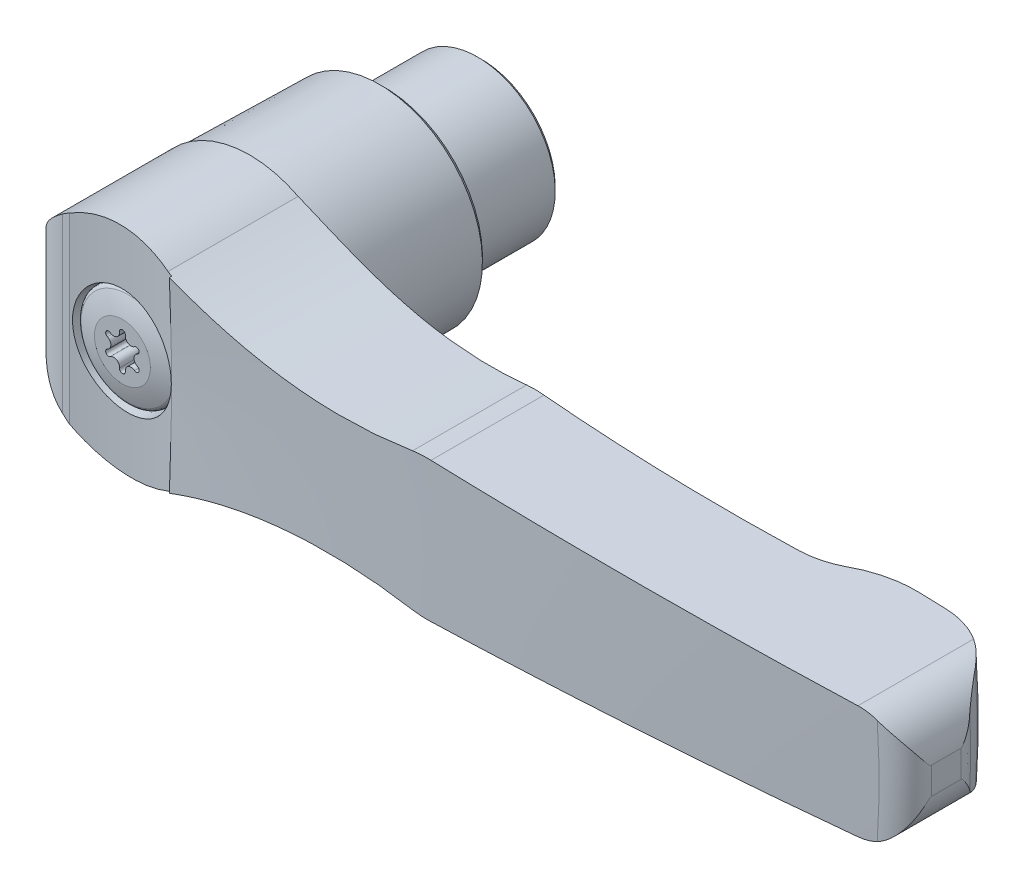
ISO-10303-21;
HEADER;
FILE_DESCRIPTION(('STEP AP214'),'2;1');
FILE_NAME('part.step','',(''),(''),'','','');
FILE_SCHEMA(('AUTOMOTIVE_DESIGN { 1 0 10303 214 1 1 1 1 }'));
ENDSEC;
DATA;
#1=APPLICATION_CONTEXT('core data for automotive mechanical design processes');
#2=APPLICATION_PROTOCOL_DEFINITION('international standard','automotive_design',2000,#1);
#3=PRODUCT_CONTEXT('',#1,'mechanical');
#4=PRODUCT('Part','Part','',(#3));
#5=PRODUCT_RELATED_PRODUCT_CATEGORY('part','',(#4));
#6=PRODUCT_DEFINITION_FORMATION('','',#4);
#7=PRODUCT_DEFINITION_CONTEXT('part definition',#1,'design');
#8=PRODUCT_DEFINITION('design','',#6,#7);
#9=PRODUCT_DEFINITION_SHAPE('','',#8);
#10=(LENGTH_UNIT() NAMED_UNIT(*) SI_UNIT(.MILLI.,.METRE.));
#11=(NAMED_UNIT(*) PLANE_ANGLE_UNIT() SI_UNIT($,.RADIAN.));
#12=(NAMED_UNIT(*) SI_UNIT($,.STERADIAN.) SOLID_ANGLE_UNIT());
#13=UNCERTAINTY_MEASURE_WITH_UNIT(LENGTH_MEASURE(1.E-05),#10,'distance_accuracy_value','');
#14=(GEOMETRIC_REPRESENTATION_CONTEXT(3) GLOBAL_UNCERTAINTY_ASSIGNED_CONTEXT((#13)) GLOBAL_UNIT_ASSIGNED_CONTEXT((#10,
#11,#12)) REPRESENTATION_CONTEXT('',''));
#15=CARTESIAN_POINT('',(0.,0.,0.));
#16=DIRECTION('',(0.,0.,1.));
#17=DIRECTION('',(1.,0.,0.));
#18=AXIS2_PLACEMENT_3D('',#15,#16,#17);
#19=CARTESIAN_POINT('',(0.,0.,37.4206884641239));
#20=DIRECTION('',(0.,0.,1.));
#21=DIRECTION('',(0.,-1.,0.));
#22=AXIS2_PLACEMENT_3D('',#19,#20,#21);
#23=CONICAL_SURFACE('',#22,5.40323588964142,0.026179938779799);
#24=CARTESIAN_POINT('',(-4.00502028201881,3.59923072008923,36.7116084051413));
#25=CARTESIAN_POINT('',(-4.10618291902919,3.48674812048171,36.7137340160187));
#26=CARTESIAN_POINT('',(-4.20258807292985,3.37002121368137,36.7160517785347));
#27=CARTESIAN_POINT('',(-4.38526404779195,3.12883533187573,36.7208944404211));
#28=CARTESIAN_POINT('',(-4.47153245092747,3.00437452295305,36.7234193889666));
#29=CARTESIAN_POINT('',(-4.63334743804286,2.74853352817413,36.7285051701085));
#30=CARTESIAN_POINT('',(-4.70888544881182,2.61714792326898,36.7310660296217));
#31=CARTESIAN_POINT('',(-4.84864738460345,2.34842657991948,36.7360611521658));
#32=CARTESIAN_POINT('',(-4.91286718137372,2.21108869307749,36.7384953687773));
#33=CARTESIAN_POINT('',(-5.02945516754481,1.93158504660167,36.7430896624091));
#34=CARTESIAN_POINT('',(-5.08183198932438,1.7894228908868,36.7452499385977));
#35=CARTESIAN_POINT('',(-5.17443516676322,1.50113131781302,36.7491760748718));
#36=CARTESIAN_POINT('',(-5.21465703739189,1.35500045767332,36.7509417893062));
#37=CARTESIAN_POINT('',(-5.28261358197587,1.05995147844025,36.753979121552));
#38=CARTESIAN_POINT('',(-5.31035578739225,0.911035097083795,36.7552510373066));
#39=CARTESIAN_POINT('',(-5.35319618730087,0.611334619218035,36.7572337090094));
#40=CARTESIAN_POINT('',(-5.36828971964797,0.46054985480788,36.7579442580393));
#41=CARTESIAN_POINT('',(-5.38569180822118,0.158493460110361,36.7587646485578));
#42=CARTESIAN_POINT('',(-5.3880214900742,0.00722304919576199,36.7588754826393));
#43=CARTESIAN_POINT('',(-5.37993428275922,-0.2950318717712,36.7584931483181));
#44=CARTESIAN_POINT('',(-5.36951268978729,-0.446016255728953,36.7579997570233));
#45=CARTESIAN_POINT('',(-5.33599591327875,-0.746517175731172,36.7564351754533));
#46=CARTESIAN_POINT('',(-5.31290498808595,-0.896034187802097,36.7553641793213));
#47=CARTESIAN_POINT('',(-5.25420825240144,-1.19264366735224,36.7527016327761));
#48=CARTESIAN_POINT('',(-5.21859782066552,-1.33973521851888,36.7511098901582));
#49=CARTESIAN_POINT('',(-5.13515920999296,-1.63025393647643,36.7474947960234));
#50=CARTESIAN_POINT('',(-5.08734273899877,-1.77368447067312,36.7454718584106));
#51=CARTESIAN_POINT('',(-4.97980084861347,-2.05606171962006,36.7411061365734));
#52=CARTESIAN_POINT('',(-4.9200710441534,-2.1950067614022,36.7387632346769));
#53=CARTESIAN_POINT('',(-4.78915335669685,-2.46733659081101,36.733895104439));
#54=CARTESIAN_POINT('',(-4.71796959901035,-2.60072335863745,36.7313699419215));
#55=CARTESIAN_POINT('',(-4.56464525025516,-2.86106080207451,36.7262913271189));
#56=CARTESIAN_POINT('',(-4.48250061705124,-2.98800907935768,36.7237378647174));
#57=CARTESIAN_POINT('',(-4.22020427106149,-3.35814886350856,36.7162794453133));
#58=CARTESIAN_POINT('',(-4.02427843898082,-3.5904519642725,36.7115801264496));
#59=CARTESIAN_POINT('',(-3.59632939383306,-4.01880059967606,36.7041749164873));
#60=CARTESIAN_POINT('',(-3.36430620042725,-4.21484615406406,36.701469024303));
#61=CARTESIAN_POINT('',(-2.87050745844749,-4.5654219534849,36.699429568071));
#62=CARTESIAN_POINT('',(-2.60871524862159,-4.71992878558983,36.7000979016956));
#63=CARTESIAN_POINT('',(-2.06299008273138,-4.98285867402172,36.7059528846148));
#64=CARTESIAN_POINT('',(-1.77905750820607,-5.09128252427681,36.7111394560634));
#65=CARTESIAN_POINT('',(-1.19768367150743,-5.25888102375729,36.7267513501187));
#66=CARTESIAN_POINT('',(-0.90026673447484,-5.3181409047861,36.7371675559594));
#67=CARTESIAN_POINT('',(-0.299954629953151,-5.38614419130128,36.7634412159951));
#68=CARTESIAN_POINT('',(0.00294053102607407,-5.39488765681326,36.7792986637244));
#69=CARTESIAN_POINT('',(0.605815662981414,-5.36174477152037,36.8160926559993));
#70=CARTESIAN_POINT('',(0.905793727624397,-5.31982729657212,36.8370323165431));
#71=CARTESIAN_POINT('',(1.49425587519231,-5.18663969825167,36.8830402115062));
#72=CARTESIAN_POINT('',(1.78273950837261,-5.09536764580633,36.9081086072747));
#73=CARTESIAN_POINT('',(2.34187088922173,-4.86544857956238,36.9610835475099));
#74=CARTESIAN_POINT('',(2.61240483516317,-4.72652844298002,36.9890057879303));
#75=CARTESIAN_POINT('',(3.1262956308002,-4.40534225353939,37.0457112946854));
#76=CARTESIAN_POINT('',(3.36965130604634,-4.22307432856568,37.0744945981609));
#77=CARTESIAN_POINT('',(3.82357123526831,-3.81917482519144,37.1309836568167));
#78=CARTESIAN_POINT('',(4.03396229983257,-3.59734763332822,37.1586831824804));
#79=CARTESIAN_POINT('',(4.41442737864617,-3.12110193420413,37.2106908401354));
#80=CARTESIAN_POINT('',(4.58450218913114,-2.86668407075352,37.2349990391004));
#81=CARTESIAN_POINT('',(4.87867876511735,-2.33354135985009,37.2781367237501));
#82=CARTESIAN_POINT('',(5.00297677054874,-2.05492674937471,37.2969895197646));
#83=CARTESIAN_POINT('',(5.20284941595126,-1.48037702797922,37.3277560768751));
#84=CARTESIAN_POINT('',(5.27842802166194,-1.18444332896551,37.3396704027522));
#85=CARTESIAN_POINT('',(5.37790344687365,-0.587468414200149,37.3554252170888));
#86=CARTESIAN_POINT('',(5.40241048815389,-0.286531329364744,37.3593610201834));
#87=CARTESIAN_POINT('',(5.40080470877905,0.315196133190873,37.3591043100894));
#88=CARTESIAN_POINT('',(5.37469432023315,0.615986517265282,37.3549121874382));
#89=CARTESIAN_POINT('',(5.27302868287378,1.20672742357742,37.3388203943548));
#90=CARTESIAN_POINT('',(5.1978143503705,1.49673821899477,37.3269738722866));
#91=CARTESIAN_POINT('',(5.00053236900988,2.05999258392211,37.2966206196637));
#92=CARTESIAN_POINT('',(4.87846327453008,2.33323563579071,37.2781136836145));
#93=CARTESIAN_POINT('',(4.59019002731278,2.85706292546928,37.2358246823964));
#94=CARTESIAN_POINT('',(4.42371768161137,3.10749663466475,37.2120107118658));
#95=CARTESIAN_POINT('',(4.0515714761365,3.57714300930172,37.1610440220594));
#96=CARTESIAN_POINT('',(3.8458947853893,3.79635341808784,37.133891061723));
#97=CARTESIAN_POINT('',(3.51123432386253,4.09833257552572,37.0920601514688));
#98=CARTESIAN_POINT('',(3.39448440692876,4.1950540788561,37.0778376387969));
#99=CARTESIAN_POINT('',(3.1532788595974,4.37832145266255,37.0493298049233));
#100=CARTESIAN_POINT('',(3.02882599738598,4.46487094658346,37.035044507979));
#101=CARTESIAN_POINT('',(2.77302153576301,4.62722768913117,37.0066601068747));
#102=CARTESIAN_POINT('',(2.64166720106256,4.70303063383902,36.9925610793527));
#103=CARTESIAN_POINT('',(2.37305777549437,4.84330840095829,36.9648007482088));
#104=CARTESIAN_POINT('',(2.23580487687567,4.90778738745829,36.9511392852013));
#105=CARTESIAN_POINT('',(1.95551884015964,5.02532167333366,36.9243962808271));
#106=CARTESIAN_POINT('',(1.81245747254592,5.07831050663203,36.9113184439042));
#107=CARTESIAN_POINT('',(1.52234860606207,5.17199565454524,36.8860321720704));
#108=CARTESIAN_POINT('',(1.37530260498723,5.21269652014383,36.8738234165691));
#109=CARTESIAN_POINT('',(1.07816787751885,5.28153687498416,36.8504395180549));
#110=CARTESIAN_POINT('',(0.928078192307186,5.30967233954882,36.8392647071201));
#111=CARTESIAN_POINT('',(0.626030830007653,5.35313405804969,36.8180981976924));
#112=CARTESIAN_POINT('',(0.47407388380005,5.36846517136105,36.8081060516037));
#113=CARTESIAN_POINT('',(0.169976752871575,5.38616840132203,36.7894453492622));
#114=CARTESIAN_POINT('',(0.017840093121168,5.38859532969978,36.7807713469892));
#115=CARTESIAN_POINT('',(-0.286109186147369,5.38060283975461,36.7647668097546));
#116=CARTESIAN_POINT('',(-0.437921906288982,5.37018826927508,36.7574357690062));
#117=CARTESIAN_POINT('',(-0.740272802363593,5.33656908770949,36.7441393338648));
#118=CARTESIAN_POINT('',(-0.890810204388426,5.3133572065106,36.7381747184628));
#119=CARTESIAN_POINT('',(-1.18937696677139,5.25430236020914,36.7276110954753));
#120=CARTESIAN_POINT('',(-1.33740724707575,5.2184641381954,36.7230115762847));
#121=CARTESIAN_POINT('',(-1.62916895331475,5.13462495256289,36.7151526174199));
#122=CARTESIAN_POINT('',(-1.77291899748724,5.08668942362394,36.7118862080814));
#123=CARTESIAN_POINT('',(-2.05584870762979,4.97891823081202,36.7065838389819));
#124=CARTESIAN_POINT('',(-2.19503003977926,4.91908696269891,36.7045474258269));
#125=CARTESIAN_POINT('',(-2.467775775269,4.78798320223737,36.7015991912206));
#126=CARTESIAN_POINT('',(-2.60134452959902,4.71671978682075,36.7006864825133));
#127=CARTESIAN_POINT('',(-2.86198576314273,4.56324942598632,36.6998522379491));
#128=CARTESIAN_POINT('',(-2.98905976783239,4.48104506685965,36.699930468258));
#129=CARTESIAN_POINT('',(-3.27530245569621,4.27830226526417,36.7010870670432));
#130=CARTESIAN_POINT('',(-3.43175822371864,4.1539062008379,36.7024769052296));
#131=CARTESIAN_POINT('',(-3.72990777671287,3.88854448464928,36.7063358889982));
#132=CARTESIAN_POINT('',(-3.87160155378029,3.74757882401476,36.7088050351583));
#133=CARTESIAN_POINT('',(-4.00502028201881,3.59923072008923,36.7116084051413));
#134=B_SPLINE_CURVE_WITH_KNOTS('',3,(#24,#25,#26,#27,#28,#29,#30,#31,#32,#33,#34,#35,#36,#37,
#38,#39,#40,#41,#42,#43,#44,#45,#46,#47,#48,#49,#50,#51,#52,#53,#54,#55,#56,#57,#58,#59,#60,#61,
#62,#63,#64,#65,#66,#67,#68,#69,#70,#71,#72,#73,#74,#75,#76,#77,#78,#79,#80,#81,#82,#83,#84,#85,
#86,#87,#88,#89,#90,#91,#92,#93,#94,#95,#96,#97,#98,#99,#100,#101,#102,#103,#104,#105,#106,#107,
#108,#109,#110,#111,#112,#113,#114,#115,#116,#117,#118,#119,#120,#121,#122,#123,#124,#125,#126,
#127,#128,#129,#130,#131,#132,#133),.UNSPECIFIED.,.T.,.F.,(4,2,2,2,2,2,2,2,2,2,2,2,2,2,2,2,2,2,
2,2,2,2,2,2,2,2,2,2,2,2,2,2,2,2,2,2,2,2,2,2,2,2,2,2,2,2,2,2,2,2,2,2,2,2,4),(0.,
0.453716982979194,0.907541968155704,1.36172752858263,1.81607840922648,2.27009703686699,
2.7242829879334,3.17819446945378,3.63227318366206,4.08560011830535,4.53909433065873,
4.99243621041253,5.44594560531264,5.89902162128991,6.35226471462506,6.80534492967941,
7.25859269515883,8.16569122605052,9.07278926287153,9.98039751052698,10.8879901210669,
11.7940060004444,12.7000208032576,13.6065925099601,14.5131996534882,15.425092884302,
16.3370255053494,17.2535992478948,18.170154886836,19.0827343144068,19.995239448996,
20.8967776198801,21.7982724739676,22.693574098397,23.5889033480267,24.4897678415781,
25.3906974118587,25.8470835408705,26.3033066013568,26.7597118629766,27.2159489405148,
27.674758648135,28.133398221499,28.5921845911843,29.0507967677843,29.5074593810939,
29.9639496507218,30.4206995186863,30.8772779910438,31.331437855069,31.7854302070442,
32.2390638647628,32.6925904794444,33.2909765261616,33.8893628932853),.UNSPECIFIED.);
#135=CARTESIAN_POINT('',(-4.00502028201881,3.59923072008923,36.7116084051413));
#136=VERTEX_POINT('',#135);
#137=EDGE_CURVE('E1425',#136,#136,#134,.T.);
#138=ORIENTED_EDGE('',*,*,#137,.T.);
#139=EDGE_LOOP('',(#138));
#140=FACE_BOUND('',#139,.T.);
#141=CARTESIAN_POINT('',(0.,0.,33.));
#142=DIRECTION('',(0.,0.,-1.));
#143=DIRECTION('',(-1.,0.,0.));
#144=AXIS2_PLACEMENT_3D('',#141,#142,#143);
#145=CIRCLE('',#144,5.28747608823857);
#146=CARTESIAN_POINT('',(-5.28747608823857,0.,33.));
#147=VERTEX_POINT('',#146);
#148=EDGE_CURVE('E9',#147,#147,#145,.F.);
#149=ORIENTED_EDGE('',*,*,#148,.F.);
#150=EDGE_LOOP('',(#149));
#151=FACE_BOUND('',#150,.T.);
#152=ADVANCED_FACE('F14',(#140,#151),#23,.F.);
#153=CARTESIAN_POINT('',(7.6,0.,0.));
#154=DIRECTION('',(0.,0.,1.));
#155=DIRECTION('',(0.,-1.,0.));
#156=AXIS2_PLACEMENT_3D('',#153,#154,#155);
#157=PLANE('',#156);
#158=CARTESIAN_POINT('',(0.,0.,0.));
#159=DIRECTION('',(0.,0.,1.));
#160=DIRECTION('',(0.,-1.,0.));
#161=AXIS2_PLACEMENT_3D('',#158,#159,#160);
#162=CIRCLE('',#161,5.65);
#163=CARTESIAN_POINT('',(0.,-5.65,0.));
#164=VERTEX_POINT('',#163);
#165=EDGE_CURVE('E23',#164,#164,#162,.T.);
#166=ORIENTED_EDGE('',*,*,#165,.T.);
#167=EDGE_LOOP('',(#166));
#168=FACE_BOUND('',#167,.T.);
#169=CARTESIAN_POINT('',(0.,0.,0.));
#170=DIRECTION('',(0.,0.,1.));
#171=DIRECTION('',(0.,-1.,0.));
#172=AXIS2_PLACEMENT_3D('',#169,#170,#171);
#173=CIRCLE('',#172,7.6);
#174=CARTESIAN_POINT('',(0.,-7.6,0.));
#175=VERTEX_POINT('',#174);
#176=EDGE_CURVE('E485',#175,#175,#173,.T.);
#177=ORIENTED_EDGE('',*,*,#176,.F.);
#178=EDGE_LOOP('',(#177));
#179=FACE_BOUND('',#178,.T.);
#180=ADVANCED_FACE('F500',(#168,#179),#157,.F.);
#181=CARTESIAN_POINT('',(0.,0.,0.4));
#182=DIRECTION('',(0.,0.,1.));
#183=DIRECTION('',(0.,-1.,0.));
#184=AXIS2_PLACEMENT_3D('',#181,#182,#183);
#185=CONICAL_SURFACE('',#184,8.,0.785398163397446);
#186=CARTESIAN_POINT('',(0.,0.,0.4));
#187=DIRECTION('',(0.,0.,1.));
#188=DIRECTION('',(0.,-1.,0.));
#189=AXIS2_PLACEMENT_3D('',#186,#187,#188);
#190=CIRCLE('',#189,8.);
#191=CARTESIAN_POINT('',(0.,-8.,0.4));
#192=VERTEX_POINT('',#191);
#193=EDGE_CURVE('E481',#192,#192,#190,.T.);
#194=ORIENTED_EDGE('',*,*,#193,.F.);
#195=EDGE_LOOP('',(#194));
#196=FACE_BOUND('',#195,.T.);
#197=ORIENTED_EDGE('',*,*,#176,.T.);
#198=EDGE_LOOP('',(#197));
#199=FACE_BOUND('',#198,.T.);
#200=ADVANCED_FACE('F928',(#196,#199),#185,.T.);
#201=CARTESIAN_POINT('',(0.,0.,0.));
#202=DIRECTION('',(0.,0.,1.));
#203=DIRECTION('',(0.,-1.,0.));
#204=AXIS2_PLACEMENT_3D('',#201,#202,#203);
#205=CYLINDRICAL_SURFACE('',#204,8.);
#206=CARTESIAN_POINT('',(0.,0.,10.));
#207=DIRECTION('',(0.,0.,1.));
#208=DIRECTION('',(0.,-1.,0.));
#209=AXIS2_PLACEMENT_3D('',#206,#207,#208);
#210=CIRCLE('',#209,8.);
#211=CARTESIAN_POINT('',(0.,-8.,10.));
#212=VERTEX_POINT('',#211);
#213=EDGE_CURVE('E484',#212,#212,#210,.F.);
#214=ORIENTED_EDGE('',*,*,#213,.T.);
#215=EDGE_LOOP('',(#214));
#216=FACE_BOUND('',#215,.T.);
#217=ORIENTED_EDGE('',*,*,#193,.T.);
#218=EDGE_LOOP('',(#217));
#219=FACE_BOUND('',#218,.T.);
#220=ADVANCED_FACE('F1372',(#216,#219),#205,.T.);
#221=CARTESIAN_POINT('',(10.1,0.,10.));
#222=DIRECTION('',(0.,0.,1.));
#223=DIRECTION('',(0.,-1.,0.));
#224=AXIS2_PLACEMENT_3D('',#221,#222,#223);
#225=PLANE('',#224);
#226=CARTESIAN_POINT('',(0.,0.,10.));
#227=DIRECTION('',(0.,0.,1.));
#228=DIRECTION('',(0.,-1.,0.));
#229=AXIS2_PLACEMENT_3D('',#226,#227,#228);
#230=CIRCLE('',#229,10.1);
#231=CARTESIAN_POINT('',(0.,-10.1,10.));
#232=VERTEX_POINT('',#231);
#233=EDGE_CURVE('E1408',#232,#232,#230,.T.);
#234=ORIENTED_EDGE('',*,*,#233,.F.);
#235=EDGE_LOOP('',(#234));
#236=FACE_BOUND('',#235,.T.);
#237=ORIENTED_EDGE('',*,*,#213,.F.);
#238=EDGE_LOOP('',(#237));
#239=FACE_BOUND('',#238,.T.);
#240=ADVANCED_FACE('F1363',(#236,#239),#225,.F.);
#241=CARTESIAN_POINT('',(0.,0.,10.5));
#242=DIRECTION('',(0.,0.,1.));
#243=DIRECTION('',(0.,-1.,0.));
#244=AXIS2_PLACEMENT_3D('',#241,#242,#243);
#245=CONICAL_SURFACE('',#244,10.6,0.785398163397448);
#246=CARTESIAN_POINT('',(0.,0.,10.5));
#247=DIRECTION('',(0.,0.,1.));
#248=DIRECTION('',(0.,-1.,0.));
#249=AXIS2_PLACEMENT_3D('',#246,#247,#248);
#250=CIRCLE('',#249,10.6);
#251=CARTESIAN_POINT('',(0.,-10.6,10.5));
#252=VERTEX_POINT('',#251);
#253=EDGE_CURVE('E479',#252,#252,#250,.T.);
#254=ORIENTED_EDGE('',*,*,#253,.F.);
#255=EDGE_LOOP('',(#254));
#256=FACE_BOUND('',#255,.T.);
#257=ORIENTED_EDGE('',*,*,#233,.T.);
#258=EDGE_LOOP('',(#257));
#259=FACE_BOUND('',#258,.T.);
#260=ADVANCED_FACE('F1354',(#256,#259),#245,.T.);
#261=CARTESIAN_POINT('',(-6.50000000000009,-22.,36.6906158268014));
#262=DIRECTION('',(-0.104378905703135,0.,0.994537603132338));
#263=DIRECTION('',(-0.994537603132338,0.,-0.104378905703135));
#264=AXIS2_PLACEMENT_3D('',#261,#262,#263);
#265=PLANE('',#264);
#266=CARTESIAN_POINT('',(0.,0.,37.3728051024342));
#267=DIRECTION('',(-0.104378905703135,0.,0.994537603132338));
#268=DIRECTION('',(0.994537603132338,0.,0.104378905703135));
#269=AXIS2_PLACEMENT_3D('',#266,#267,#268);
#270=ELLIPSE('',#269,11.06041638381,11.);
#271=CARTESIAN_POINT('',(-6.50000000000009,8.87411967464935,36.6906158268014));
#272=VERTEX_POINT('',#271);
#273=CARTESIAN_POINT('',(-5.70000000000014,9.40797534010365,36.7745775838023));
#274=VERTEX_POINT('',#273);
#275=EDGE_CURVE('E763',#272,#274,#270,.F.);
#276=ORIENTED_EDGE('',*,*,#275,.F.);
#277=DIRECTION('',(0.,-1.,0.));
#278=VECTOR('',#277,1.);
#279=CARTESIAN_POINT('',(-6.50000000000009,-22.,36.6906158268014));
#280=LINE('',#279,#278);
#281=CARTESIAN_POINT('',(-6.50000000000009,-8.87411967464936,36.6906158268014));
#282=VERTEX_POINT('',#281);
#283=EDGE_CURVE('E472',#282,#272,#280,.F.);
#284=ORIENTED_EDGE('',*,*,#283,.F.);
#285=CARTESIAN_POINT('',(0.,0.,37.3728051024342));
#286=DIRECTION('',(-0.104378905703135,0.,0.994537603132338));
#287=DIRECTION('',(0.994537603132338,0.,0.104378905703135));
#288=AXIS2_PLACEMENT_3D('',#285,#286,#287);
#289=ELLIPSE('',#288,11.06041638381,11.);
#290=CARTESIAN_POINT('',(-5.70000000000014,-9.40797534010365,36.7745775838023));
#291=VERTEX_POINT('',#290);
#292=EDGE_CURVE('E480',#282,#291,#289,.T.);
#293=ORIENTED_EDGE('',*,*,#292,.T.);
#294=DIRECTION('',(0.,-1.,0.));
#295=VECTOR('',#294,1.);
#296=CARTESIAN_POINT('',(-5.70000000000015,-22.,36.7745775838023));
#297=LINE('',#296,#295);
#298=EDGE_CURVE('E707',#291,#274,#297,.F.);
#299=ORIENTED_EDGE('',*,*,#298,.T.);
#300=EDGE_LOOP('',(#276,#284,#293,#299));
#301=FACE_BOUND('',#300,.T.);
#302=ADVANCED_FACE('F748',(#301),#265,.T.);
#303=CARTESIAN_POINT('',(-6.2,-22.,31.9));
#304=DIRECTION('',(0.,-1.,0.));
#305=DIRECTION('',(1.,0.,0.));
#306=AXIS2_PLACEMENT_3D('',#303,#304,#305);
#307=CYLINDRICAL_SURFACE('',#306,4.8);
#308=CARTESIAN_POINT('',(-6.50000000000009,8.87411967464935,36.6906158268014));
#309=CARTESIAN_POINT('',(-6.66552619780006,8.75291998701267,36.680232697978));
#310=CARTESIAN_POINT('',(-6.82714588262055,8.62738417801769,36.6615213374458));
#311=CARTESIAN_POINT('',(-7.14149627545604,8.36899888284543,36.6094533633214));
#312=CARTESIAN_POINT('',(-7.29424250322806,8.2361630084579,36.576123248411));
#313=CARTESIAN_POINT('',(-7.58893117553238,7.96541542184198,36.4971636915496));
#314=CARTESIAN_POINT('',(-7.7309643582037,7.82756575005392,36.451657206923));
#315=CARTESIAN_POINT('',(-8.00560982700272,7.54644585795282,36.3498578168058));
#316=CARTESIAN_POINT('',(-8.13821634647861,7.40317240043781,36.2935583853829));
#317=CARTESIAN_POINT('',(-8.4444788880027,7.05435537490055,36.1475189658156));
#318=CARTESIAN_POINT('',(-8.61357084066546,6.84664030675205,36.0533695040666));
#319=CARTESIAN_POINT('',(-8.93309083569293,6.42417971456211,35.8504489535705));
#320=CARTESIAN_POINT('',(-9.08351471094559,6.20943263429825,35.741674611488));
#321=CARTESIAN_POINT('',(-9.36692917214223,5.77310143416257,35.5116555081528));
#322=CARTESIAN_POINT('',(-9.49981387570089,5.55148494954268,35.3903422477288));
#323=CARTESIAN_POINT('',(-9.74765243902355,5.1037973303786,35.1381200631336));
#324=CARTESIAN_POINT('',(-9.86260578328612,4.87772606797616,35.0072108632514));
#325=CARTESIAN_POINT('',(-10.1168403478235,4.33267338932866,34.6848631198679));
#326=CARTESIAN_POINT('',(-10.2479896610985,4.0120156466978,34.4898158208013));
#327=CARTESIAN_POINT('',(-10.4780361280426,3.36577908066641,34.0890223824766));
#328=CARTESIAN_POINT('',(-10.5769186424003,3.04019809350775,33.8832714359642));
#329=CARTESIAN_POINT('',(-10.7432606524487,2.38658323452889,33.4650241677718));
#330=CARTESIAN_POINT('',(-10.8107964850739,2.05855731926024,33.2525455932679));
#331=CARTESIAN_POINT('',(-10.9155346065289,1.40071100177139,32.8233165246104));
#332=CARTESIAN_POINT('',(-10.9527511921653,1.07089151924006,32.6065680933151));
#333=CARTESIAN_POINT('',(-10.9912937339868,0.499750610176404,32.2301158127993));
#334=CARTESIAN_POINT('',(-10.9996024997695,0.258609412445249,32.0708315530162));
#335=CARTESIAN_POINT('',(-10.9999953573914,0.0116681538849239,31.9077077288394));
#336=CARTESIAN_POINT('',(-10.9999999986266,0.00583406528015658,31.9038538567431));
#337=CARTESIAN_POINT('',(-11.,0.,31.9));
#338=B_SPLINE_CURVE_WITH_KNOTS('',3,(#308,#309,#310,#311,#312,#313,#314,#315,#316,#317,#318,
#319,#320,#321,#322,#323,#324,#325,#326,#327,#328,#329,#330,#331,#332,#333,#334,#335,#336,#337),
.UNSPECIFIED.,.F.,.F.,(4,2,2,2,2,2,2,2,2,2,2,2,2,2,4),(0.,0.615756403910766,1.23040124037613,
1.83905943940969,2.44808682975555,3.2985254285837,4.14915352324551,5.00470235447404,
5.86027577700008,7.0512891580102,8.24284214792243,9.43147798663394,10.6195530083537,
11.486439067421,11.5074152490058),.UNSPECIFIED.);
#339=CARTESIAN_POINT('',(-11.,-1.89242644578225E-07,31.8999998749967));
#340=VERTEX_POINT('',#339);
#341=EDGE_CURVE('E755',#340,#272,#338,.F.);
#342=ORIENTED_EDGE('',*,*,#341,.F.);
#343=CARTESIAN_POINT('',(-6.50000000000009,-8.87411967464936,36.6906158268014));
#344=CARTESIAN_POINT('',(-6.66552619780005,-8.75291998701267,36.680232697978));
#345=CARTESIAN_POINT('',(-6.82714588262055,-8.6273841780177,36.6615213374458));
#346=CARTESIAN_POINT('',(-7.14149627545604,-8.36899888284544,36.6094533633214));
#347=CARTESIAN_POINT('',(-7.29424250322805,-8.23616300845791,36.576123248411));
#348=CARTESIAN_POINT('',(-7.58893117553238,-7.96541542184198,36.4971636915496));
#349=CARTESIAN_POINT('',(-7.7309643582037,-7.82756575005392,36.451657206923));
#350=CARTESIAN_POINT('',(-8.00560982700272,-7.54644585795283,36.3498578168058));
#351=CARTESIAN_POINT('',(-8.13821634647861,-7.40317240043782,36.2935583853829));
#352=CARTESIAN_POINT('',(-8.4444788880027,-7.05435537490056,36.1475189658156));
#353=CARTESIAN_POINT('',(-8.61357084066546,-6.84664030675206,36.0533695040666));
#354=CARTESIAN_POINT('',(-8.93309083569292,-6.42417971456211,35.8504489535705));
#355=CARTESIAN_POINT('',(-9.08351471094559,-6.20943263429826,35.741674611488));
#356=CARTESIAN_POINT('',(-9.36692917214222,-5.77310143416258,35.5116555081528));
#357=CARTESIAN_POINT('',(-9.49981387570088,-5.55148494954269,35.3903422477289));
#358=CARTESIAN_POINT('',(-9.74765243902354,-5.10379733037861,35.1381200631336));
#359=CARTESIAN_POINT('',(-9.86260578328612,-4.87772606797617,35.0072108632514));
#360=CARTESIAN_POINT('',(-10.1168403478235,-4.33267338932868,34.6848631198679));
#361=CARTESIAN_POINT('',(-10.2479896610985,-4.01201564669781,34.4898158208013));
#362=CARTESIAN_POINT('',(-10.4780361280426,-3.36577908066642,34.0890223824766));
#363=CARTESIAN_POINT('',(-10.5769186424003,-3.04019809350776,33.8832714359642));
#364=CARTESIAN_POINT('',(-10.7432606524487,-2.3865832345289,33.4650241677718));
#365=CARTESIAN_POINT('',(-10.8107964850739,-2.05855731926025,33.2525455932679));
#366=CARTESIAN_POINT('',(-10.9155346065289,-1.40071100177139,32.8233165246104));
#367=CARTESIAN_POINT('',(-10.9527511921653,-1.07089151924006,32.6065680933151));
#368=CARTESIAN_POINT('',(-10.9912937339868,-0.499750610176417,32.2301158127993));
#369=CARTESIAN_POINT('',(-10.9996024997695,-0.258609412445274,32.0708315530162));
#370=CARTESIAN_POINT('',(-10.9999953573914,-0.0116681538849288,31.9077077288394));
#371=CARTESIAN_POINT('',(-10.9999999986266,-0.00583406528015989,31.9038538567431));
#372=CARTESIAN_POINT('',(-11.,0.,31.9));
#373=B_SPLINE_CURVE_WITH_KNOTS('',3,(#343,#344,#345,#346,#347,#348,#349,#350,#351,#352,#353,
#354,#355,#356,#357,#358,#359,#360,#361,#362,#363,#364,#365,#366,#367,#368,#369,#370,#371,#372),
.UNSPECIFIED.,.F.,.F.,(4,2,2,2,2,2,2,2,2,2,2,2,2,2,4),(0.,0.615756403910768,1.23040124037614,
1.83905943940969,2.44808682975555,3.29852542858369,4.14915352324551,5.00470235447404,
5.86027577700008,7.0512891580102,8.24284214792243,9.43147798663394,10.6195530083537,
11.486439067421,11.5074152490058),.UNSPECIFIED.);
#374=EDGE_CURVE('E706',#282,#340,#373,.T.);
#375=ORIENTED_EDGE('',*,*,#374,.F.);
#376=ORIENTED_EDGE('',*,*,#283,.T.);
#377=EDGE_LOOP('',(#342,#375,#376));
#378=FACE_BOUND('',#377,.T.);
#379=ADVANCED_FACE('F742',(#378),#307,.T.);
#380=CARTESIAN_POINT('',(-6.2,-22.,31.9));
#381=DIRECTION('',(0.,-1.,0.));
#382=DIRECTION('',(1.,0.,0.));
#383=AXIS2_PLACEMENT_3D('',#380,#381,#382);
#384=CYLINDRICAL_SURFACE('',#383,4.8);
#385=CARTESIAN_POINT('',(-11.,0.,31.9));
#386=CARTESIAN_POINT('',(-11.0000000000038,-0.00567036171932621,31.8962544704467));
#387=CARTESIAN_POINT('',(-10.9999956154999,-0.0113407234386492,31.8925089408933));
#388=CARTESIAN_POINT('',(-10.9999780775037,-0.0226814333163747,31.8850178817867));
#389=CARTESIAN_POINT('',(-10.9999649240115,-0.0283517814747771,31.8812723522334));
#390=CARTESIAN_POINT('',(-10.9999298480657,-0.0396924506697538,31.8737812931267));
#391=CARTESIAN_POINT('',(-10.9999079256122,-0.045362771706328,31.8700357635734));
#392=CARTESIAN_POINT('',(-10.9998553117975,-0.0567033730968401,31.8625447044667));
#393=CARTESIAN_POINT('',(-10.9998246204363,-0.062373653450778,31.8587991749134));
#394=CARTESIAN_POINT('',(-10.9997544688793,-0.0737141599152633,31.8513081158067));
#395=CARTESIAN_POINT('',(-10.9997150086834,-0.0793843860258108,31.8475625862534));
#396=CARTESIAN_POINT('',(-10.9996273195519,-0.0907247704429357,31.8400715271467));
#397=CARTESIAN_POINT('',(-10.9995790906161,-0.0963949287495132,31.8363259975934));
#398=CARTESIAN_POINT('',(-10.9994738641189,-0.107735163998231,31.8288349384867));
#399=CARTESIAN_POINT('',(-10.9994168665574,-0.113405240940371,31.8250894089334));
#400=CARTESIAN_POINT('',(-10.9992941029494,-0.124745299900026,31.8175983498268));
#401=CARTESIAN_POINT('',(-10.9992283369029,-0.130415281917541,31.8138528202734));
#402=CARTESIAN_POINT('',(-10.9991581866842,-0.136085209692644,31.8101072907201));
#403=B_SPLINE_CURVE_WITH_KNOTS('',3,(#385,#386,#387,#388,#389,#390,#391,#392,#393,#394,#395,
#396,#397,#398,#399,#400,#401,#402),.UNSPECIFIED.,.F.,.F.,(4,2,2,2,2,2,2,2,4),(0.,
0.0203871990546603,0.0407743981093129,0.061161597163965,0.0815487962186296,0.101935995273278,
0.122323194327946,0.142710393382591,0.163097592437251),.UNSPECIFIED.);
#404=CARTESIAN_POINT('',(-10.9991581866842,-0.136085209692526,31.8101072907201));
#405=VERTEX_POINT('',#404);
#406=EDGE_CURVE('E702',#340,#405,#403,.T.);
#407=ORIENTED_EDGE('',*,*,#406,.F.);
#408=CARTESIAN_POINT('',(-10.9991581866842,0.136085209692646,31.8101072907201));
#409=CARTESIAN_POINT('',(-10.9992283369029,0.130415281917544,31.8138528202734));
#410=CARTESIAN_POINT('',(-10.9992941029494,0.124745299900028,31.8175983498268));
#411=CARTESIAN_POINT('',(-10.9994168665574,0.113405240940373,31.8250894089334));
#412=CARTESIAN_POINT('',(-10.9994738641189,0.107735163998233,31.8288349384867));
#413=CARTESIAN_POINT('',(-10.9995790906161,0.0963949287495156,31.8363259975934));
#414=CARTESIAN_POINT('',(-10.9996273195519,0.0907247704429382,31.8400715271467));
#415=CARTESIAN_POINT('',(-10.9997150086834,0.0793843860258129,31.8475625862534));
#416=CARTESIAN_POINT('',(-10.9997544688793,0.0737141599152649,31.8513081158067));
#417=CARTESIAN_POINT('',(-10.9998246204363,0.0623736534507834,31.8587991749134));
#418=CARTESIAN_POINT('',(-10.9998553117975,0.0567033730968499,31.8625447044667));
#419=CARTESIAN_POINT('',(-10.9999079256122,0.0453627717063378,31.8700357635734));
#420=CARTESIAN_POINT('',(-10.9999298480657,0.0396924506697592,31.8737812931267));
#421=CARTESIAN_POINT('',(-10.9999649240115,0.0283517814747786,31.8812723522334));
#422=CARTESIAN_POINT('',(-10.9999780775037,0.0226814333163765,31.8850178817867));
#423=CARTESIAN_POINT('',(-10.9999956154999,0.0113407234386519,31.8925089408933));
#424=CARTESIAN_POINT('',(-11.0000000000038,0.00567036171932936,31.8962544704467));
#425=CARTESIAN_POINT('',(-11.,0.,31.9));
#426=B_SPLINE_CURVE_WITH_KNOTS('',3,(#408,#409,#410,#411,#412,#413,#414,#415,#416,#417,#418,
#419,#420,#421,#422,#423,#424,#425),.UNSPECIFIED.,.F.,.F.,(4,2,2,2,2,2,2,2,4),(0.,
0.0203871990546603,0.0407743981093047,0.0611615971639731,0.0815487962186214,0.101935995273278,
0.122323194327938,0.142710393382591,0.163097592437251),.UNSPECIFIED.);
#427=CARTESIAN_POINT('',(-10.9991581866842,0.136085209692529,31.8101072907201));
#428=VERTEX_POINT('',#427);
#429=EDGE_CURVE('E764',#428,#340,#426,.T.);
#430=ORIENTED_EDGE('',*,*,#429,.F.);
#431=DIRECTION('',(0.,-1.,0.));
#432=VECTOR('',#431,1.);
#433=CARTESIAN_POINT('',(-10.9991581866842,-22.,31.8101072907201));
#434=LINE('',#433,#432);
#435=EDGE_CURVE('E780',#405,#428,#434,.F.);
#436=ORIENTED_EDGE('',*,*,#435,.F.);
#437=EDGE_LOOP('',(#407,#430,#436));
#438=FACE_BOUND('',#437,.T.);
#439=ADVANCED_FACE('F747',(#438),#384,.T.);
#440=CARTESIAN_POINT('',(0.,0.,23.8634644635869));
#441=DIRECTION('',(0.,0.,1.));
#442=DIRECTION('',(0.,-1.,0.));
#443=AXIS2_PLACEMENT_3D('',#440,#441,#442);
#444=CONICAL_SURFACE('',#443,10.8503101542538,0.0187287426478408);
#445=CARTESIAN_POINT('',(0.,0.,23.8634644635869));
#446=DIRECTION('',(0.,0.,-1.));
#447=DIRECTION('',(1.,0.,0.));
#448=AXIS2_PLACEMENT_3D('',#445,#446,#447);
#449=CIRCLE('',#448,10.8503101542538);
#450=CARTESIAN_POINT('',(-10.8503101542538,0.,23.8634644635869));
#451=VERTEX_POINT('',#450);
#452=EDGE_CURVE('E1448',#451,#451,#449,.T.);
#453=ORIENTED_EDGE('',*,*,#452,.T.);
#454=EDGE_LOOP('',(#453));
#455=FACE_BOUND('',#454,.T.);
#456=ORIENTED_EDGE('',*,*,#253,.T.);
#457=EDGE_LOOP('',(#456));
#458=FACE_BOUND('',#457,.T.);
#459=ADVANCED_FACE('F1325',(#455,#458),#444,.T.);
#460=CARTESIAN_POINT('',(-10.6,-22.,10.5));
#461=DIRECTION('',(-0.999824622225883,0.,-0.0187276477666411));
#462=DIRECTION('',(0.0187276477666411,0.,-0.999824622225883));
#463=AXIS2_PLACEMENT_3D('',#460,#461,#462);
#464=PLANE('',#463);
#465=CARTESIAN_POINT('',(0.,0.,-555.40881714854));
#466=DIRECTION('',(-0.999824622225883,0.,-0.0187276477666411));
#467=DIRECTION('',(-0.0187276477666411,0.,0.999824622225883));
#468=AXIS2_PLACEMENT_3D('',#465,#466,#467);
#469=ELLIPSE('',#468,587.366877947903,11.);
#470=CARTESIAN_POINT('',(-10.850768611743,1.80577422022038,23.8879404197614));
#471=VERTEX_POINT('',#470);
#472=EDGE_CURVE('E766',#471,#428,#469,.F.);
#473=ORIENTED_EDGE('',*,*,#472,.F.);
#474=CARTESIAN_POINT('',(-10.850768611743,1.80577422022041,23.8879404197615));
#475=CARTESIAN_POINT('',(-10.8506928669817,1.65532567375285,23.8838965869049));
#476=CARTESIAN_POINT('',(-10.8506263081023,1.50486397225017,23.8803431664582));
#477=CARTESIAN_POINT('',(-10.8505118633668,1.20392715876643,23.8742332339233));
#478=CARTESIAN_POINT('',(-10.850463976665,1.05345204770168,23.8716766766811));
#479=CARTESIAN_POINT('',(-10.8503487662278,0.602000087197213,23.8655258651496));
#480=CARTESIAN_POINT('',(-10.8503098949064,0.301002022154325,23.8634506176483));
#481=CARTESIAN_POINT('',(-10.8503101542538,0.,23.863464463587));
#482=B_SPLINE_CURVE_WITH_KNOTS('',3,(#474,#475,#476,#477,#478,#479,#480,#481),.UNSPECIFIED.,.F.,
.F.,(4,2,2,4),(0.,0.451507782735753,0.902995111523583,1.80598600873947),.UNSPECIFIED.);
#483=EDGE_CURVE('E737',#471,#451,#482,.T.);
#484=ORIENTED_EDGE('',*,*,#483,.T.);
#485=CARTESIAN_POINT('',(-10.8503101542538,0.,23.863464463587));
#486=CARTESIAN_POINT('',(-10.8503098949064,-0.30100202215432,23.8634506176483));
#487=CARTESIAN_POINT('',(-10.8503487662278,-0.602000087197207,23.8655258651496));
#488=CARTESIAN_POINT('',(-10.850463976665,-1.05345204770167,23.8716766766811));
#489=CARTESIAN_POINT('',(-10.8505118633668,-1.20392715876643,23.8742332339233));
#490=CARTESIAN_POINT('',(-10.8506263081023,-1.50486397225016,23.8803431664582));
#491=CARTESIAN_POINT('',(-10.8506928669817,-1.65532567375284,23.8838965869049));
#492=CARTESIAN_POINT('',(-10.850768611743,-1.8057742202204,23.8879404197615));
#493=B_SPLINE_CURVE_WITH_KNOTS('',3,(#485,#486,#487,#488,#489,#490,#491,#492),.UNSPECIFIED.,.F.,
.F.,(4,2,2,4),(0.,0.902990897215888,1.35447822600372,1.80598600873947),.UNSPECIFIED.);
#494=CARTESIAN_POINT('',(-10.850768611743,-1.80577422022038,23.8879404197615));
#495=VERTEX_POINT('',#494);
#496=EDGE_CURVE('E339',#451,#495,#493,.T.);
#497=ORIENTED_EDGE('',*,*,#496,.T.);
#498=CARTESIAN_POINT('',(0.,0.,-555.40881714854));
#499=DIRECTION('',(-0.999824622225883,0.,-0.0187276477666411));
#500=DIRECTION('',(-0.0187276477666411,0.,0.999824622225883));
#501=AXIS2_PLACEMENT_3D('',#498,#499,#500);
#502=ELLIPSE('',#501,587.366877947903,11.);
#503=EDGE_CURVE('E1424',#405,#495,#502,.F.);
#504=ORIENTED_EDGE('',*,*,#503,.F.);
#505=ORIENTED_EDGE('',*,*,#435,.T.);
#506=EDGE_LOOP('',(#473,#484,#497,#504,#505));
#507=FACE_BOUND('',#506,.T.);
#508=ADVANCED_FACE('F771',(#507),#464,.T.);
#509=CARTESIAN_POINT('',(0.,0.,80.));
#510=DIRECTION('',(0.,0.,1.));
#511=DIRECTION('',(0.,-1.,0.));
#512=AXIS2_PLACEMENT_3D('',#509,#510,#511);
#513=CYLINDRICAL_SURFACE('',#512,11.);
#514=DIRECTION('',(0.,0.,1.));
#515=VECTOR('',#514,1.);
#516=CARTESIAN_POINT('',(4.99999999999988,9.79795897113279,80.));
#517=LINE('',#516,#515);
#518=CARTESIAN_POINT('',(4.99999999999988,9.79795897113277,37.2966347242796));
#519=VERTEX_POINT('',#518);
#520=CARTESIAN_POINT('',(4.9999999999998,9.79795897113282,23.8879404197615));
#521=VERTEX_POINT('',#520);
#522=EDGE_CURVE('E1454',#519,#521,#517,.F.);
#523=ORIENTED_EDGE('',*,*,#522,.T.);
#524=CARTESIAN_POINT('',(0.,0.,23.8879404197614));
#525=DIRECTION('',(0.,0.,1.));
#526=DIRECTION('',(-1.,0.,0.));
#527=AXIS2_PLACEMENT_3D('',#524,#525,#526);
#528=CIRCLE('',#527,11.);
#529=EDGE_CURVE('E1449',#521,#471,#528,.T.);
#530=ORIENTED_EDGE('',*,*,#529,.T.);
#531=ORIENTED_EDGE('',*,*,#472,.T.);
#532=ORIENTED_EDGE('',*,*,#429,.T.);
#533=ORIENTED_EDGE('',*,*,#341,.T.);
#534=ORIENTED_EDGE('',*,*,#275,.T.);
#535=CARTESIAN_POINT('',(-5.70000000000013,9.40797534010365,36.7745775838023));
#536=CARTESIAN_POINT('',(-5.43970332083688,9.56571993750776,36.7606846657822));
#537=CARTESIAN_POINT('',(-5.17275915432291,9.71264560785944,36.7484111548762));
#538=CARTESIAN_POINT('',(-4.62749279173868,9.98392926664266,36.7276715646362));
#539=CARTESIAN_POINT('',(-4.34917039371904,10.1082868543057,36.7192055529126));
#540=CARTESIAN_POINT('',(-3.7836735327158,10.3332602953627,36.7066634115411));
#541=CARTESIAN_POINT('',(-3.49651907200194,10.4339258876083,36.7025780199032));
#542=CARTESIAN_POINT('',(-2.91484226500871,10.6111316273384,36.6991984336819));
#543=CARTESIAN_POINT('',(-2.6203201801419,10.6876726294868,36.6999040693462));
#544=CARTESIAN_POINT('',(-2.02570589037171,10.8161512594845,36.7064252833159));
#545=CARTESIAN_POINT('',(-1.72560845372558,10.8680644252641,36.7122459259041));
#546=CARTESIAN_POINT('',(-1.12215614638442,10.9468441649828,36.7291866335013));
#547=CARTESIAN_POINT('',(-0.818799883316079,10.9736995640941,36.7403090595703));
#548=CARTESIAN_POINT('',(-0.21104386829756,11.00218316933,36.7678948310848));
#549=CARTESIAN_POINT('',(0.0933562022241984,11.0038028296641,36.784359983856));
#550=CARTESIAN_POINT('',(0.700782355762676,10.981859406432,36.822510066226));
#551=CARTESIAN_POINT('',(1.00380896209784,10.9583068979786,36.8441928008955));
#552=CARTESIAN_POINT('',(1.62703646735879,10.883833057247,36.8941780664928));
#553=CARTESIAN_POINT('',(1.94700070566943,10.831156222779,36.922830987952));
#554=CARTESIAN_POINT('',(2.58058446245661,10.6979165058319,36.9853308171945));
#555=CARTESIAN_POINT('',(2.894203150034,10.6173499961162,37.0191784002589));
#556=CARTESIAN_POINT('',(3.5132191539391,10.4289071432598,37.0914975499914));
#557=CARTESIAN_POINT('',(3.81860000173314,10.3209800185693,37.1299776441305));
#558=CARTESIAN_POINT('',(4.41821395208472,10.0788948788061,37.2106925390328));
#559=CARTESIAN_POINT('',(4.71244874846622,9.94474086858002,37.2529267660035));
#560=CARTESIAN_POINT('',(4.99999999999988,9.79795897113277,37.2966347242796));
#561=B_SPLINE_CURVE_WITH_KNOTS('',3,(#535,#536,#537,#538,#539,#540,#541,#542,#543,#544,#545,
#546,#547,#548,#549,#550,#551,#552,#553,#554,#555,#556,#557,#558,#559,#560),.UNSPECIFIED.,.F.,
.F.,(4,2,2,2,2,2,2,2,2,2,2,2,4),(0.,0.913785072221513,1.82758637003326,2.73945177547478,
3.65128487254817,4.5640217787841,5.47716553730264,6.39061851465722,7.3036878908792,
8.2789717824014,9.25438256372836,10.2316171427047,11.2087026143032),.UNSPECIFIED.);
#562=EDGE_CURVE('E1421',#274,#519,#561,.T.);
#563=ORIENTED_EDGE('',*,*,#562,.T.);
#564=EDGE_LOOP('',(#523,#530,#531,#532,#533,#534,#563));
#565=FACE_BOUND('',#564,.T.);
#566=ADVANCED_FACE('F768',(#565),#513,.T.);
#567=CARTESIAN_POINT('',(-2.90000000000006,-22.,89.2999999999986));
#568=DIRECTION('',(0.,-1.,0.));
#569=DIRECTION('',(1.,0.,0.));
#570=AXIS2_PLACEMENT_3D('',#567,#568,#569);
#571=CYLINDRICAL_SURFACE('',#570,52.5999999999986);
#572=ORIENTED_EDGE('',*,*,#137,.F.);
#573=EDGE_LOOP('',(#572));
#574=FACE_BOUND('',#573,.T.);
#575=ORIENTED_EDGE('',*,*,#298,.F.);
#576=CARTESIAN_POINT('',(5.00000000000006,-9.79795897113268,37.2966347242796));
#577=CARTESIAN_POINT('',(4.72836499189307,-9.93660976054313,37.2553500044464));
#578=CARTESIAN_POINT('',(4.45077156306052,-10.0639978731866,37.2153761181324));
#579=CARTESIAN_POINT('',(3.88554818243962,-10.2954169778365,37.1387392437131));
#580=CARTESIAN_POINT('',(3.59791744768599,-10.3994461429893,37.1020765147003));
#581=CARTESIAN_POINT('',(3.01491777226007,-10.5831754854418,37.0328024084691));
#582=CARTESIAN_POINT('',(2.71955925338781,-10.6629067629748,37.0001858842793));
#583=CARTESIAN_POINT('',(2.12279313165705,-10.79755975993,36.9395048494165));
#584=CARTESIAN_POINT('',(1.82138582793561,-10.8524827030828,36.9114401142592));
#585=CARTESIAN_POINT('',(1.21421772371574,-10.9370815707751,36.8602616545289));
#586=CARTESIAN_POINT('',(0.90845167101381,-10.966723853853,36.8371545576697));
#587=CARTESIAN_POINT('',(0.295018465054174,-11.000334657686,36.79622500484));
#588=CARTESIAN_POINT('',(-0.0126494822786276,-11.0042916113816,36.7784049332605));
#589=CARTESIAN_POINT('',(-0.627464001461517,-10.9863940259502,36.7482132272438));
#590=CARTESIAN_POINT('',(-0.934610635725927,-10.9645428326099,36.7358408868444));
#591=CARTESIAN_POINT('',(-1.5460193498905,-10.8951569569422,36.7165401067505));
#592=CARTESIAN_POINT('',(-1.85028266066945,-10.8476337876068,36.7096092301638));
#593=CARTESIAN_POINT('',(-2.46439079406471,-10.7251200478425,36.7008764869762));
#594=CARTESIAN_POINT('',(-2.77405858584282,-10.6492268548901,36.6992625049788));
#595=CARTESIAN_POINT('',(-3.3856449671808,-10.47085960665,36.7013524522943));
#596=CARTESIAN_POINT('',(-3.68756293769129,-10.3683834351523,36.705056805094));
#597=CARTESIAN_POINT('',(-4.28200890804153,-10.1373700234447,36.7173174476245));
#598=CARTESIAN_POINT('',(-4.5745119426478,-10.0087692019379,36.7258856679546));
#599=CARTESIAN_POINT('',(-5.14711147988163,-9.72673276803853,36.7472344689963));
#600=CARTESIAN_POINT('',(-5.42720860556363,-9.57329840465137,36.760014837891));
#601=CARTESIAN_POINT('',(-5.70000000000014,-9.40797534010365,36.7745775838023));
#602=B_SPLINE_CURVE_WITH_KNOTS('',3,(#576,#577,#578,#579,#580,#581,#582,#583,#584,#585,#586,
#587,#588,#589,#590,#591,#592,#593,#594,#595,#596,#597,#598,#599,#600,#601),.UNSPECIFIED.,.F.,
.F.,(4,2,2,2,2,2,2,2,2,2,2,2,4),(0.,0.923020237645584,1.84611263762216,2.76801850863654,
3.68987889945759,4.61296412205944,5.53646501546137,6.45984619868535,7.38281362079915,
8.3380649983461,9.29339244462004,10.2510734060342,11.2087062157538),.UNSPECIFIED.);
#603=CARTESIAN_POINT('',(5.00000000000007,-9.7979589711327,37.2966347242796));
#604=VERTEX_POINT('',#603);
#605=EDGE_CURVE('E724',#604,#291,#602,.T.);
#606=ORIENTED_EDGE('',*,*,#605,.F.);
#607=CARTESIAN_POINT('',(5.43597073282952,-9.6298781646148,37.3647365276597));
#608=CARTESIAN_POINT('',(5.36321973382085,-9.65752809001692,37.3530600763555));
#609=CARTESIAN_POINT('',(5.29051333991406,-9.68535978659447,37.3415467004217));
#610=CARTESIAN_POINT('',(5.14518976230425,-9.74138672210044,37.318846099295));
#611=CARTESIAN_POINT('',(5.07257257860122,-9.76958196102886,37.3076588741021));
#612=CARTESIAN_POINT('',(5.00000000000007,-9.79795897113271,37.2966347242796));
#613=B_SPLINE_CURVE_WITH_KNOTS('',3,(#607,#608,#609,#610,#611,#612),.UNSPECIFIED.,.F.,.F.,(4,2,
4),(0.,0.236094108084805,0.472188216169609),.UNSPECIFIED.);
#614=CARTESIAN_POINT('',(5.43597073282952,-9.62987816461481,37.3647365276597));
#615=VERTEX_POINT('',#614);
#616=EDGE_CURVE('E1422',#615,#604,#613,.T.);
#617=ORIENTED_EDGE('',*,*,#616,.F.);
#618=DIRECTION('',(0.,-1.,0.));
#619=VECTOR('',#618,1.);
#620=CARTESIAN_POINT('',(5.43597073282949,-22.,37.3647365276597));
#621=LINE('',#620,#619);
#622=CARTESIAN_POINT('',(5.43597073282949,0.,37.3647365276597));
#623=VERTEX_POINT('',#622);
#624=EDGE_CURVE('E1462',#623,#615,#621,.T.);
#625=ORIENTED_EDGE('',*,*,#624,.F.);
#626=DIRECTION('',(0.,-1.,0.));
#627=VECTOR('',#626,1.);
#628=CARTESIAN_POINT('',(5.43597073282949,-22.,37.3647365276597));
#629=LINE('',#628,#627);
#630=CARTESIAN_POINT('',(5.43597073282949,9.62987816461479,37.3647365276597));
#631=VERTEX_POINT('',#630);
#632=EDGE_CURVE('E1456',#631,#623,#629,.T.);
#633=ORIENTED_EDGE('',*,*,#632,.F.);
#634=CARTESIAN_POINT('',(5.4359707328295,9.6298781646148,37.3647365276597));
#635=CARTESIAN_POINT('',(5.36321973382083,9.65752809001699,37.3530600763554));
#636=CARTESIAN_POINT('',(5.29051333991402,9.68535978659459,37.3415467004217));
#637=CARTESIAN_POINT('',(5.14518976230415,9.74138672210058,37.318846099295));
#638=CARTESIAN_POINT('',(5.07257257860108,9.76958196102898,37.3076588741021));
#639=CARTESIAN_POINT('',(4.99999999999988,9.79795897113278,37.2966347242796));
#640=B_SPLINE_CURVE_WITH_KNOTS('',3,(#634,#635,#636,#637,#638,#639),.UNSPECIFIED.,.F.,.F.,(4,2,
4),(0.,0.236094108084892,0.472188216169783),.UNSPECIFIED.);
#641=EDGE_CURVE('E382',#631,#519,#640,.T.);
#642=ORIENTED_EDGE('',*,*,#641,.T.);
#643=ORIENTED_EDGE('',*,*,#562,.F.);
#644=EDGE_LOOP('',(#575,#606,#617,#625,#633,#642,#643));
#645=FACE_BOUND('',#644,.T.);
#646=ADVANCED_FACE('F717',(#574,#645),#571,.F.);
#647=CARTESIAN_POINT('',(0.,0.,80.));
#648=DIRECTION('',(0.,0.,1.));
#649=DIRECTION('',(0.,-1.,0.));
#650=AXIS2_PLACEMENT_3D('',#647,#648,#649);
#651=CYLINDRICAL_SURFACE('',#650,11.);
#652=ORIENTED_EDGE('',*,*,#374,.T.);
#653=ORIENTED_EDGE('',*,*,#406,.T.);
#654=ORIENTED_EDGE('',*,*,#503,.T.);
#655=CARTESIAN_POINT('',(0.,0.,23.8879404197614));
#656=DIRECTION('',(0.,0.,1.));
#657=DIRECTION('',(-1.,0.,0.));
#658=AXIS2_PLACEMENT_3D('',#655,#656,#657);
#659=CIRCLE('',#658,11.);
#660=CARTESIAN_POINT('',(5.00000000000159,-9.79795897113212,23.8879404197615));
#661=VERTEX_POINT('',#660);
#662=EDGE_CURVE('E411',#495,#661,#659,.T.);
#663=ORIENTED_EDGE('',*,*,#662,.T.);
#664=DIRECTION('',(0.,0.,1.));
#665=VECTOR('',#664,1.);
#666=CARTESIAN_POINT('',(5.00000000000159,-9.79795897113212,80.));
#667=LINE('',#666,#665);
#668=EDGE_CURVE('E1423',#661,#604,#667,.T.);
#669=ORIENTED_EDGE('',*,*,#668,.T.);
#670=ORIENTED_EDGE('',*,*,#605,.T.);
#671=ORIENTED_EDGE('',*,*,#292,.F.);
#672=EDGE_LOOP('',(#652,#653,#654,#663,#669,#670,#671));
#673=FACE_BOUND('',#672,.T.);
#674=ADVANCED_FACE('F709',(#673),#651,.T.);
#675=CARTESIAN_POINT('',(0.,0.,0.));
#676=DIRECTION('',(0.,0.,1.));
#677=DIRECTION('',(0.,-1.,0.));
#678=AXIS2_PLACEMENT_3D('',#675,#676,#677);
#679=CYLINDRICAL_SURFACE('',#678,80.);
#680=CARTESIAN_POINT('',(0.,0.,30.5874507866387));
#681=DIRECTION('',(0.,0.,-1.));
#682=DIRECTION('',(0.,1.,0.));
#683=AXIS2_PLACEMENT_3D('',#680,#681,#682);
#684=CIRCLE('',#683,80.);
#685=CARTESIAN_POINT('',(79.9879170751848,1.39036756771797,30.5874507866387));
#686=VERTEX_POINT('',#685);
#687=CARTESIAN_POINT('',(79.9879170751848,-1.39036756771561,30.5874507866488));
#688=VERTEX_POINT('',#687);
#689=EDGE_CURVE('E700',#686,#688,#684,.T.);
#690=ORIENTED_EDGE('',*,*,#689,.F.);
#691=DIRECTION('',(0.,0.,1.));
#692=VECTOR('',#691,1.);
#693=CARTESIAN_POINT('',(79.9879170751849,1.39036756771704,80.));
#694=LINE('',#693,#692);
#695=CARTESIAN_POINT('',(79.9879170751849,1.39036756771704,33.6332015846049));
#696=VERTEX_POINT('',#695);
#697=EDGE_CURVE('E637',#696,#686,#694,.F.);
#698=ORIENTED_EDGE('',*,*,#697,.F.);
#699=CARTESIAN_POINT('',(0.,0.,33.6332015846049));
#700=DIRECTION('',(0.,0.,-1.));
#701=DIRECTION('',(0.,1.,0.));
#702=AXIS2_PLACEMENT_3D('',#699,#700,#701);
#703=CIRCLE('',#702,80.);
#704=CARTESIAN_POINT('',(79.9879170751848,-1.39036756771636,33.6332015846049));
#705=VERTEX_POINT('',#704);
#706=EDGE_CURVE('E644',#705,#696,#703,.F.);
#707=ORIENTED_EDGE('',*,*,#706,.F.);
#708=DIRECTION('',(0.,0.,1.));
#709=VECTOR('',#708,1.);
#710=CARTESIAN_POINT('',(79.9879170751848,-1.39036756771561,80.));
#711=LINE('',#710,#709);
#712=EDGE_CURVE('E671',#688,#705,#711,.T.);
#713=ORIENTED_EDGE('',*,*,#712,.F.);
#714=EDGE_LOOP('',(#690,#698,#707,#713));
#715=FACE_BOUND('',#714,.T.);
#716=ADVANCED_FACE('F691',(#715),#679,.T.);
#717=CARTESIAN_POINT('',(0.,0.,30.5874507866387));
#718=DIRECTION('',(0.,0.,-1.));
#719=DIRECTION('',(0.,1.,0.));
#720=AXIS2_PLACEMENT_3D('',#717,#718,#719);
#721=TOROIDAL_SURFACE('',#720,77.6,2.39999999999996);
#722=CARTESIAN_POINT('',(79.9879170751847,1.39036756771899,30.5874507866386));
#723=CARTESIAN_POINT('',(79.9879173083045,1.39036329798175,30.582714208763));
#724=CARTESIAN_POINT('',(79.9878985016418,1.39062890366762,30.5779823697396));
#725=CARTESIAN_POINT('',(79.9878249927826,1.39166103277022,30.5685881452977));
#726=CARTESIAN_POINT('',(79.9877704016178,1.39242600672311,30.5639255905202));
#727=CARTESIAN_POINT('',(79.9875594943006,1.39536633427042,30.5503113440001));
#728=CARTESIAN_POINT('',(79.987355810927,1.39819109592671,30.5414995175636));
#729=CARTESIAN_POINT('',(79.9867233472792,1.40679861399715,30.5202772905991));
#730=CARTESIAN_POINT('',(79.9862332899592,1.41335167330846,30.5081973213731));
#731=CARTESIAN_POINT('',(79.9850904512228,1.42810760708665,30.4849373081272));
#732=CARTESIAN_POINT('',(79.984435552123,1.43633166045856,30.4737716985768));
#733=CARTESIAN_POINT('',(79.9830075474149,1.45362564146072,30.4522956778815));
#734=CARTESIAN_POINT('',(79.9822354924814,1.46268779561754,30.4419788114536));
#735=CARTESIAN_POINT('',(79.9805857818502,1.48137930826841,30.4218767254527));
#736=CARTESIAN_POINT('',(79.979708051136,1.49100906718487,30.4120918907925));
#737=CARTESIAN_POINT('',(79.9769269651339,1.52048600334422,30.3832657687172));
#738=CARTESIAN_POINT('',(79.9748791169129,1.54087873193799,30.3648008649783));
#739=CARTESIAN_POINT('',(79.9704305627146,1.58238229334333,30.328720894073));
#740=CARTESIAN_POINT('',(79.9680294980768,1.6034938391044,30.311106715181));
#741=CARTESIAN_POINT('',(79.9628912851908,1.64609261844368,30.2764610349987));
#742=CARTESIAN_POINT('',(79.9601546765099,1.66757920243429,30.2594286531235));
#743=CARTESIAN_POINT('',(79.9514831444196,1.73211545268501,30.2091036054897));
#744=CARTESIAN_POINT('',(79.9450570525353,1.77551964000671,30.1763516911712));
#745=CARTESIAN_POINT('',(79.9309035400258,1.86271663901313,30.1116518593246));
#746=CARTESIAN_POINT('',(79.9231759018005,1.90650951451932,30.0797040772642));
#747=CARTESIAN_POINT('',(79.8980263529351,2.03819672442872,29.9846209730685));
#748=CARTESIAN_POINT('',(79.8786484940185,2.12631903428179,29.9223065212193));
#749=CARTESIAN_POINT('',(79.8347126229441,2.30205050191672,29.7994137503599));
#750=CARTESIAN_POINT('',(79.8101708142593,2.38966040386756,29.7388306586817));
#751=CARTESIAN_POINT('',(79.7558099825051,2.5642485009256,29.6192121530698));
#752=CARTESIAN_POINT('',(79.725993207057,2.65122694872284,29.5601760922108));
#753=CARTESIAN_POINT('',(79.6688890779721,2.80326203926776,29.4579301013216));
#754=CARTESIAN_POINT('',(79.6427478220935,2.86850952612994,29.4143605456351));
#755=CARTESIAN_POINT('',(79.5873419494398,2.99838768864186,29.3282950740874));
#756=CARTESIAN_POINT('',(79.5580773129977,3.06301836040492,29.2857991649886));
#757=CARTESIAN_POINT('',(79.4963158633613,3.1916752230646,29.201933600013));
#758=CARTESIAN_POINT('',(79.4638127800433,3.25569996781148,29.1605663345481));
#759=CARTESIAN_POINT('',(79.3955663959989,3.38290157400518,29.079207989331));
#760=CARTESIAN_POINT('',(79.3598227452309,3.44607834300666,29.0392170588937));
#761=CARTESIAN_POINT('',(79.3224340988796,3.50876739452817,29.));
#762=B_SPLINE_CURVE_WITH_KNOTS('',3,(#722,#723,#724,#725,#726,#727,#728,#729,#730,#731,#732,
#733,#734,#735,#736,#737,#738,#739,#740,#741,#742,#743,#744,#745,#746,#747,#748,#749,#750,#751,
#752,#753,#754,#755,#756,#757,#758,#759,#760,#761),.UNSPECIFIED.,.F.,.F.,(4,2,2,2,2,2,2,2,2,2,2,
2,2,2,2,2,2,2,2,4),(0.,0.0141942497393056,0.0283446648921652,0.0559583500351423,
0.0969812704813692,0.138560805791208,0.179787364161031,0.221043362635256,0.30374654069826,
0.386534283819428,0.469190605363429,0.633415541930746,0.797667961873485,1.12647671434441,
1.45426871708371,1.78192138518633,2.02995181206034,2.27798380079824,2.52650571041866,
2.77505449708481),.UNSPECIFIED.);
#763=CARTESIAN_POINT('',(79.3224340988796,3.5087673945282,29.));
#764=VERTEX_POINT('',#763);
#765=EDGE_CURVE('E640',#686,#764,#762,.T.);
#766=ORIENTED_EDGE('',*,*,#765,.F.);
#767=ORIENTED_EDGE('',*,*,#689,.T.);
#768=CARTESIAN_POINT('',(79.3224340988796,-3.50876739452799,29.));
#769=CARTESIAN_POINT('',(79.3600834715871,-3.44564120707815,29.0394906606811));
#770=CARTESIAN_POINT('',(79.3960648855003,-3.38202032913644,29.0797659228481));
#771=CARTESIAN_POINT('',(79.4647383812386,-3.25392588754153,29.1617069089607));
#772=CARTESIAN_POINT('',(79.4974311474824,-3.18945250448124,29.2033723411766));
#773=CARTESIAN_POINT('',(79.5595916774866,-3.05975896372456,29.2879343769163));
#774=CARTESIAN_POINT('',(79.5890592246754,-2.99453875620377,29.3308310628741));
#775=CARTESIAN_POINT('',(79.6448208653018,-2.86346105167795,29.4177215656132));
#776=CARTESIAN_POINT('',(79.6711144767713,-2.79760345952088,29.4617155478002));
#777=CARTESIAN_POINT('',(79.7207469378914,-2.66489985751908,29.5510031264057));
#778=CARTESIAN_POINT('',(79.7440631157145,-2.59805014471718,29.5963038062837));
#779=CARTESIAN_POINT('',(79.7875578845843,-2.46395895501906,29.6878190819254));
#780=CARTESIAN_POINT('',(79.807736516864,-2.39671748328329,29.7340336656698));
#781=CARTESIAN_POINT('',(79.8449864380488,-2.2620161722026,29.8273472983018));
#782=CARTESIAN_POINT('',(79.8620585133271,-2.19455639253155,29.8744461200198));
#783=CARTESIAN_POINT('',(79.893120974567,-2.05965268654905,29.9695992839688));
#784=CARTESIAN_POINT('',(79.9071129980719,-1.99220877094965,30.0176531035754));
#785=CARTESIAN_POINT('',(79.927005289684,-1.88491571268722,30.0954562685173));
#786=CARTESIAN_POINT('',(79.9338912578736,-1.8449232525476,30.1247597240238));
#787=CARTESIAN_POINT('',(79.9465591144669,-1.76539484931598,30.1840045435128));
#788=CARTESIAN_POINT('',(79.952343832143,-1.72585798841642,30.2139440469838));
#789=CARTESIAN_POINT('',(79.9608317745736,-1.6624401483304,30.2634618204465));
#790=CARTESIAN_POINT('',(79.9638715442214,-1.638309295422,30.2826625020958));
#791=CARTESIAN_POINT('',(79.9695344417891,-1.59048222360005,30.3218926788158));
#792=CARTESIAN_POINT('',(79.9721556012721,-1.56678849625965,30.341925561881));
#793=CARTESIAN_POINT('',(79.9757557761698,-1.53197042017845,30.373042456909));
#794=CARTESIAN_POINT('',(79.9769050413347,-1.52043391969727,30.3836434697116));
#795=CARTESIAN_POINT('',(79.9790803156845,-1.4977947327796,30.4053085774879));
#796=CARTESIAN_POINT('',(79.9801063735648,-1.48669187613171,30.416372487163));
#797=CARTESIAN_POINT('',(79.9820191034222,-1.465221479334,30.4391096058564));
#798=CARTESIAN_POINT('',(79.9829064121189,-1.45485070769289,30.4507796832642));
#799=CARTESIAN_POINT('',(79.984521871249,-1.43528602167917,30.4750648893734));
#800=CARTESIAN_POINT('',(79.9852505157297,-1.42608849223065,30.4876769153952));
#801=CARTESIAN_POINT('',(79.9862521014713,-1.41306443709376,30.5090552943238));
#802=CARTESIAN_POINT('',(79.9865916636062,-1.4085465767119,30.51738861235));
#803=CARTESIAN_POINT('',(79.987168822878,-1.40075600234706,30.5345867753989));
#804=CARTESIAN_POINT('',(79.9874070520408,-1.39747558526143,30.5434479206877));
#805=CARTESIAN_POINT('',(79.9876900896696,-1.39354924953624,30.5582009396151));
#806=CARTESIAN_POINT('',(79.98777396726,-1.39237626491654,30.5639504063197));
#807=CARTESIAN_POINT('',(79.9878880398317,-1.39077607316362,30.5756120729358));
#808=CARTESIAN_POINT('',(79.9879176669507,-1.39035675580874,30.5815253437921));
#809=CARTESIAN_POINT('',(79.9879170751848,-1.3903675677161,30.5874507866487));
#810=B_SPLINE_CURVE_WITH_KNOTS('',3,(#768,#769,#770,#771,#772,#773,#774,#775,#776,#777,#778,
#779,#780,#781,#782,#783,#784,#785,#786,#787,#788,#789,#790,#791,#792,#793,#794,#795,#796,#797,
#798,#799,#800,#801,#802,#803,#804,#805,#806,#807,#808,#809),.UNSPECIFIED.,.F.,.F.,(4,2,2,2,2,2,
2,2,2,2,2,2,2,2,2,2,2,2,2,2,4),(0.,0.250282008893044,0.500511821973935,0.750758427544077,
1.00104298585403,1.25313218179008,1.50521806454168,1.75724004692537,2.00912771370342,
2.1592804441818,2.30904204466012,2.40199600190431,2.4953749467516,2.54249587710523,
2.58959812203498,2.63647743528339,2.68320861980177,2.71160167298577,2.73981494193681,
2.7573736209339,2.77511506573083),.UNSPECIFIED.);
#811=CARTESIAN_POINT('',(79.3224340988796,-3.50876739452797,29.));
#812=VERTEX_POINT('',#811);
#813=EDGE_CURVE('E672',#812,#688,#810,.T.);
#814=ORIENTED_EDGE('',*,*,#813,.F.);
#815=CARTESIAN_POINT('',(0.,0.,29.));
#816=DIRECTION('',(0.,0.,1.));
#817=DIRECTION('',(0.,-1.,0.));
#818=AXIS2_PLACEMENT_3D('',#815,#816,#817);
#819=CIRCLE('',#818,79.4);
#820=EDGE_CURVE('E699',#764,#812,#819,.F.);
#821=ORIENTED_EDGE('',*,*,#820,.F.);
#822=EDGE_LOOP('',(#766,#767,#814,#821));
#823=FACE_BOUND('',#822,.T.);
#824=ADVANCED_FACE('F685',(#823),#721,.T.);
#825=CARTESIAN_POINT('',(0.,0.,29.));
#826=DIRECTION('',(0.,0.,1.));
#827=DIRECTION('',(-1.,0.,0.));
#828=AXIS2_PLACEMENT_3D('',#825,#826,#827);
#829=CONICAL_SURFACE('',#828,79.4,0.628318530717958);
#830=CARTESIAN_POINT('',(0.,0.,26.5503891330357));
#831=DIRECTION('',(0.,0.,-1.));
#832=DIRECTION('',(0.,1.,0.));
#833=AXIS2_PLACEMENT_3D('',#830,#831,#832);
#834=CIRCLE('',#833,77.6202535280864);
#835=CARTESIAN_POINT('',(77.4393982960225,5.29559716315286,26.5503891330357));
#836=VERTEX_POINT('',#835);
#837=CARTESIAN_POINT('',(77.4393982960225,-5.29559716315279,26.5503891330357));
#838=VERTEX_POINT('',#837);
#839=EDGE_CURVE('E413',#836,#838,#834,.T.);
#840=ORIENTED_EDGE('',*,*,#839,.F.);
#841=CARTESIAN_POINT('',(79.3224340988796,3.50876739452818,29.));
#842=CARTESIAN_POINT('',(79.2778338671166,3.5835349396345,28.9432213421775));
#843=CARTESIAN_POINT('',(79.2318632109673,3.65599820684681,28.8845695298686));
#844=CARTESIAN_POINT('',(79.1375484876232,3.79642901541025,28.7639851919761));
#845=CARTESIAN_POINT('',(79.0892058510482,3.8643992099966,28.7020546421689));
#846=CARTESIAN_POINT('',(78.9413700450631,4.06149258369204,28.512299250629));
#847=CARTESIAN_POINT('',(78.8388104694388,4.18422350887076,28.3801815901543));
#848=CARTESIAN_POINT('',(78.6296254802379,4.41171526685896,28.1097627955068));
#849=CARTESIAN_POINT('',(78.5231043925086,4.51675612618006,27.9716128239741));
#850=CARTESIAN_POINT('',(78.3057341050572,4.71276248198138,27.6887946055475));
#851=CARTESIAN_POINT('',(78.1948828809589,4.803721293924,27.5441233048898));
#852=CARTESIAN_POINT('',(77.9780289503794,4.96658417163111,27.2602377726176));
#853=CARTESIAN_POINT('',(77.8722418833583,5.0393832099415,27.1213668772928));
#854=CARTESIAN_POINT('',(77.6576884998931,5.17503691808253,26.83893187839));
#855=CARTESIAN_POINT('',(77.5489044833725,5.23780161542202,26.6953378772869));
#856=CARTESIAN_POINT('',(77.4393982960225,5.29559716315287,26.5503891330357));
#857=B_SPLINE_CURVE_WITH_KNOTS('',3,(#841,#842,#843,#844,#845,#846,#847,#848,#849,#850,#851,
#852,#853,#854,#855,#856),.UNSPECIFIED.,.F.,.F.,(4,2,2,2,2,2,2,4),(0.,0.311688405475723,
0.623191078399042,1.24441717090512,1.85462903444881,2.4651296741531,3.03222411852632,
3.60414827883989),.UNSPECIFIED.);
#858=EDGE_CURVE('E816',#764,#836,#857,.T.);
#859=ORIENTED_EDGE('',*,*,#858,.F.);
#860=ORIENTED_EDGE('',*,*,#820,.T.);
#861=CARTESIAN_POINT('',(77.4393982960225,-5.2955971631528,26.5503891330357));
#862=CARTESIAN_POINT('',(77.556791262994,-5.23362971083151,26.7057778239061));
#863=CARTESIAN_POINT('',(77.6733706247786,-5.1659545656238,26.8596303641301));
#864=CARTESIAN_POINT('',(77.904319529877,-5.01807445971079,27.1635264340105));
#865=CARTESIAN_POINT('',(78.0186834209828,-4.93784124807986,27.3135604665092));
#866=CARTESIAN_POINT('',(78.2416347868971,-4.7658868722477,27.6051716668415));
#867=CARTESIAN_POINT('',(78.3502937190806,-4.6744520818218,27.7468616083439));
#868=CARTESIAN_POINT('',(78.5631892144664,-4.47781989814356,28.023630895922));
#869=CARTESIAN_POINT('',(78.667430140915,-4.37263652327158,28.1587167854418));
#870=CARTESIAN_POINT('',(78.8673603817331,-4.15035205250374,28.4169736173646));
#871=CARTESIAN_POINT('',(78.9632062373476,-4.03365952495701,28.540370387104));
#872=CARTESIAN_POINT('',(79.1019446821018,-3.84659366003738,28.7183778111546));
#873=CARTESIAN_POINT('',(79.1475774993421,-3.78186346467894,28.7768188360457));
#874=CARTESIAN_POINT('',(79.2366963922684,-3.64836827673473,28.89073561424));
#875=CARTESIAN_POINT('',(79.2801813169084,-3.57960116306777,28.9462097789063));
#876=CARTESIAN_POINT('',(79.3224340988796,-3.50876739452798,29.));
#877=B_SPLINE_CURVE_WITH_KNOTS('',3,(#861,#862,#863,#864,#865,#866,#867,#868,#869,#870,#871,
#872,#873,#874,#875,#876),.UNSPECIFIED.,.F.,.F.,(4,2,2,2,2,2,2,4),(0.,0.613162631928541,
1.22772501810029,1.82897997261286,2.42962658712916,3.01371180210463,3.3088559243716,
3.60415653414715),.UNSPECIFIED.);
#878=EDGE_CURVE('E680',#838,#812,#877,.T.);
#879=ORIENTED_EDGE('',*,*,#878,.F.);
#880=EDGE_LOOP('',(#840,#859,#860,#879));
#881=FACE_BOUND('',#880,.T.);
#882=ADVANCED_FACE('F690',(#881),#829,.T.);
#883=CARTESIAN_POINT('',(0.,0.,17.6872894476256));
#884=DIRECTION('',(0.,0.,-1.));
#885=DIRECTION('',(0.,1.,0.));
#886=AXIS2_PLACEMENT_3D('',#883,#884,#885);
#887=TOROIDAL_SURFACE('',#886,58.7617689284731,8.6);
#888=CARTESIAN_POINT('',(62.6892088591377,-6.25004740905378,25.17043032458));
#889=CARTESIAN_POINT('',(62.4733338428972,-6.25690844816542,25.2917390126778));
#890=CARTESIAN_POINT('',(62.2522502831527,-6.26393502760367,25.4037598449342));
#891=CARTESIAN_POINT('',(61.801251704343,-6.27826887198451,25.6086035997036));
#892=CARTESIAN_POINT('',(61.5713328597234,-6.28557625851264,25.7014180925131));
#893=CARTESIAN_POINT('',(61.1087581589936,-6.30027802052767,25.8655874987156));
#894=CARTESIAN_POINT('',(60.8762315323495,-6.3076682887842,25.9373074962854));
#895=CARTESIAN_POINT('',(60.4061260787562,-6.32260939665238,26.0610619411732));
#896=CARTESIAN_POINT('',(60.168550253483,-6.33016014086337,26.1131077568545));
#897=CARTESIAN_POINT('',(59.7689578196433,-6.34286017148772,26.1833429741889));
#898=CARTESIAN_POINT('',(59.6078863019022,-6.34797942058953,26.2070371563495));
#899=CARTESIAN_POINT('',(59.2836548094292,-6.35828429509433,26.2455323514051));
#900=CARTESIAN_POINT('',(59.1204880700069,-6.36347013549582,26.2602763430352));
#901=CARTESIAN_POINT('',(58.9570190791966,-6.36866558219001,26.2704303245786));
#902=B_SPLINE_CURVE_WITH_KNOTS('',3,(#888,#889,#890,#891,#892,#893,#894,#895,#896,#897,#898,
#899,#900,#901),.UNSPECIFIED.,.F.,.F.,(4,2,2,2,2,2,4),(0.,0.742928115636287,1.48618161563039,
2.21569120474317,2.94477861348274,3.43319876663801,3.92469882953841),.UNSPECIFIED.);
#903=CARTESIAN_POINT('',(62.6892088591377,-6.2500474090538,25.17043032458));
#904=VERTEX_POINT('',#903);
#905=CARTESIAN_POINT('',(58.9570190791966,-6.36866558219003,26.2704303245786));
#906=VERTEX_POINT('',#905);
#907=EDGE_CURVE('E957',#904,#906,#902,.T.);
#908=ORIENTED_EDGE('',*,*,#907,.T.);
#909=CARTESIAN_POINT('',(0.,0.,26.2704303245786));
#910=DIRECTION('',(0.,0.,1.));
#911=DIRECTION('',(0.,-1.,0.));
#912=AXIS2_PLACEMENT_3D('',#909,#910,#911);
#913=CIRCLE('',#912,59.3000000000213);
#914=CARTESIAN_POINT('',(58.9570190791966,6.36866558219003,26.2704303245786));
#915=VERTEX_POINT('',#914);
#916=EDGE_CURVE('E956',#906,#915,#913,.T.);
#917=ORIENTED_EDGE('',*,*,#916,.T.);
#918=CARTESIAN_POINT('',(58.9570190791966,6.36866558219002,26.2704303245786));
#919=CARTESIAN_POINT('',(59.2041320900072,6.36081172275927,26.2551040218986));
#920=CARTESIAN_POINT('',(59.4505948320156,6.35297853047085,26.229245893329));
#921=CARTESIAN_POINT('',(59.9405728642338,6.33740582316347,26.1567255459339));
#922=CARTESIAN_POINT('',(60.1840865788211,6.32966635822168,26.1100526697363));
#923=CARTESIAN_POINT('',(60.6617876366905,6.31448384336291,25.9972355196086));
#924=CARTESIAN_POINT('',(60.8960641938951,6.30703795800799,25.9314687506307));
#925=CARTESIAN_POINT('',(61.3581909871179,6.29235043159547,25.7806287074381));
#926=CARTESIAN_POINT('',(61.5860450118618,6.28510867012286,25.6955670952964));
#927=CARTESIAN_POINT('',(61.9598821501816,6.27322720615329,25.5378823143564));
#928=CARTESIAN_POINT('',(62.1080632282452,6.26851764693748,25.4704215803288));
#929=CARTESIAN_POINT('',(62.4013346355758,6.25919676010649,25.3268377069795));
#930=CARTESIAN_POINT('',(62.5463994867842,6.25458624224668,25.2506624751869));
#931=CARTESIAN_POINT('',(62.6892088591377,6.25004740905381,25.17043032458));
#932=B_SPLINE_CURVE_WITH_KNOTS('',3,(#918,#919,#920,#921,#922,#923,#924,#925,#926,#927,#928,
#929,#930,#931),.UNSPECIFIED.,.F.,.F.,(4,2,2,2,2,2,4),(0.,0.742921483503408,1.4862237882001,
2.21572906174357,2.94479458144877,3.43320323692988,3.92470117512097),.UNSPECIFIED.);
#933=CARTESIAN_POINT('',(62.6892088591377,6.25004740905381,25.17043032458));
#934=VERTEX_POINT('',#933);
#935=EDGE_CURVE('E818',#915,#934,#932,.T.);
#936=ORIENTED_EDGE('',*,*,#935,.T.);
#937=CARTESIAN_POINT('',(0.,0.,25.17043032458));
#938=DIRECTION('',(0.,0.,-1.));
#939=DIRECTION('',(0.,1.,0.));
#940=AXIS2_PLACEMENT_3D('',#937,#938,#939);
#941=CIRCLE('',#940,63.);
#942=EDGE_CURVE('E446',#904,#934,#941,.F.);
#943=ORIENTED_EDGE('',*,*,#942,.F.);
#944=EDGE_LOOP('',(#908,#917,#936,#943));
#945=FACE_BOUND('',#944,.T.);
#946=ADVANCED_FACE('F452',(#945),#887,.F.);
#947=CARTESIAN_POINT('',(0.,0.,34.8));
#948=DIRECTION('',(0.,0.,-1.));
#949=DIRECTION('',(0.,1.,0.));
#950=AXIS2_PLACEMENT_3D('',#947,#948,#949);
#951=TOROIDAL_SURFACE('',#950,68.9128155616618,11.3);
#952=CARTESIAN_POINT('',(62.6892088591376,6.25004740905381,25.17043032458));
#953=CARTESIAN_POINT('',(62.9673790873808,6.24120647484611,25.0009681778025));
#954=CARTESIAN_POINT('',(63.2528175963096,6.23213453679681,24.8434694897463));
#955=CARTESIAN_POINT('',(63.8361308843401,6.21359540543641,24.5533449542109));
#956=CARTESIAN_POINT('',(64.1340082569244,6.20412812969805,24.4207243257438));
#957=CARTESIAN_POINT('',(64.7331832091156,6.18508487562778,24.1840585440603));
#958=CARTESIAN_POINT('',(65.0342541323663,6.17551610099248,24.0794390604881));
#959=CARTESIAN_POINT('',(65.6439169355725,6.15613951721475,23.8956723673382));
#960=CARTESIAN_POINT('',(65.9525062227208,6.14633179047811,23.816516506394));
#961=CARTESIAN_POINT('',(66.652289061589,6.12409097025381,23.6678048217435));
#962=CARTESIAN_POINT('',(67.0450508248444,6.11160803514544,23.6054552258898));
#963=CARTESIAN_POINT('',(67.6401012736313,6.09269586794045,23.5424544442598));
#964=CARTESIAN_POINT('',(67.8409000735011,6.08631398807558,23.5265400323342));
#965=CARTESIAN_POINT('',(68.2430463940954,6.0735327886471,23.505313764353));
#966=CARTESIAN_POINT('',(68.4443938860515,6.06713346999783,23.5000013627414));
#967=CARTESIAN_POINT('',(68.6457840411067,6.0607327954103,23.5));
#968=B_SPLINE_CURVE_WITH_KNOTS('',3,(#952,#953,#954,#955,#956,#957,#958,#959,#960,#961,#962,
#963,#964,#965,#966,#967),.UNSPECIFIED.,.F.,.F.,(4,2,2,2,2,2,2,4),(0.,0.977218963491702,
1.95464270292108,2.91013831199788,3.86530894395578,5.05652042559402,5.66087194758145,
6.26519237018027),.UNSPECIFIED.);
#969=CARTESIAN_POINT('',(68.6457840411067,6.06073279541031,23.5));
#970=VERTEX_POINT('',#969);
#971=EDGE_CURVE('E634',#934,#970,#968,.T.);
#972=ORIENTED_EDGE('',*,*,#971,.T.);
#973=CARTESIAN_POINT('',(0.,0.,23.5));
#974=DIRECTION('',(0.,0.,-1.));
#975=DIRECTION('',(0.996125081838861,0.0879478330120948,0.));
#976=AXIS2_PLACEMENT_3D('',#973,#974,#975);
#977=CIRCLE('',#976,68.9128155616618);
#978=CARTESIAN_POINT('',(68.6457840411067,-6.06073279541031,23.5));
#979=VERTEX_POINT('',#978);
#980=EDGE_CURVE('E422',#970,#979,#977,.T.);
#981=ORIENTED_EDGE('',*,*,#980,.T.);
#982=CARTESIAN_POINT('',(68.6457840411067,-6.0607327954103,23.5));
#983=CARTESIAN_POINT('',(68.3201027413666,-6.07108374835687,23.4999663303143));
#984=CARTESIAN_POINT('',(67.9944282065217,-6.08143448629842,23.5138915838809));
#985=CARTESIAN_POINT('',(67.3453670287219,-6.10206324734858,23.5694033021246));
#986=CARTESIAN_POINT('',(67.0219809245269,-6.11234125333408,23.610996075));
#987=CARTESIAN_POINT('',(66.387128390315,-6.13251842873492,23.7203446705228));
#988=CARTESIAN_POINT('',(66.0755573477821,-6.1424209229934,23.7874922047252));
#989=CARTESIAN_POINT('',(65.4592194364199,-6.16200965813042,23.9474557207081));
#990=CARTESIAN_POINT('',(65.1544502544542,-6.17169597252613,24.0402628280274));
#991=CARTESIAN_POINT('',(64.4793426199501,-6.19315255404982,24.2770399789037));
#992=CARTESIAN_POINT('',(64.1114080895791,-6.2048464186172,24.4279855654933));
#993=CARTESIAN_POINT('',(63.5703383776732,-6.22204294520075,24.6836019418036));
#994=CARTESIAN_POINT('',(63.3905353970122,-6.22775752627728,24.7744343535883));
#995=CARTESIAN_POINT('',(63.0359808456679,-6.23902614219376,24.9654641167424));
#996=CARTESIAN_POINT('',(62.8612290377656,-6.24458018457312,25.0656610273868));
#997=CARTESIAN_POINT('',(62.6892088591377,-6.25004740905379,25.17043032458));
#998=B_SPLINE_CURVE_WITH_KNOTS('',3,(#982,#983,#984,#985,#986,#987,#988,#989,#990,#991,#992,
#993,#994,#995,#996,#997),.UNSPECIFIED.,.F.,.F.,(4,2,2,2,2,2,2,4),(0.,0.977229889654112,
1.95468266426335,2.91019284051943,3.86537296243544,5.05654852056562,5.66088498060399,
6.26519301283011),.UNSPECIFIED.);
#999=EDGE_CURVE('E855',#979,#904,#998,.T.);
#1000=ORIENTED_EDGE('',*,*,#999,.T.);
#1001=ORIENTED_EDGE('',*,*,#942,.T.);
#1002=EDGE_LOOP('',(#972,#981,#1000,#1001));
#1003=FACE_BOUND('',#1002,.T.);
#1004=ADVANCED_FACE('F448',(#1003),#951,.T.);
#1005=CARTESIAN_POINT('',(71.6335277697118,0.,23.5));
#1006=DIRECTION('',(0.,0.,1.));
#1007=DIRECTION('',(0.,-1.,0.));
#1008=AXIS2_PLACEMENT_3D('',#1005,#1006,#1007);
#1009=PLANE('',#1008);
#1010=DIRECTION('',(-0.999495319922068,-0.0317664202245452,0.));
#1011=VECTOR('',#1010,1.);
#1012=CARTESIAN_POINT('',(32.8,-7.2,23.5));
#1013=LINE('',#1012,#1011);
#1014=CARTESIAN_POINT('',(71.3840118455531,-5.9737051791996,23.5));
#1015=VERTEX_POINT('',#1014);
#1016=EDGE_CURVE('E853',#1015,#979,#1013,.T.);
#1017=ORIENTED_EDGE('',*,*,#1016,.T.);
#1018=ORIENTED_EDGE('',*,*,#980,.F.);
#1019=DIRECTION('',(0.999495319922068,-0.0317664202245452,0.));
#1020=VECTOR('',#1019,1.);
#1021=CARTESIAN_POINT('',(75.3524788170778,5.84757753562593,23.5));
#1022=LINE('',#1021,#1020);
#1023=CARTESIAN_POINT('',(71.3840118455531,5.9737051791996,23.5));
#1024=VERTEX_POINT('',#1023);
#1025=EDGE_CURVE('E632',#970,#1024,#1022,.T.);
#1026=ORIENTED_EDGE('',*,*,#1025,.T.);
#1027=CARTESIAN_POINT('',(0.,0.,23.5));
#1028=DIRECTION('',(0.,0.,1.));
#1029=DIRECTION('',(0.996516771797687,-0.0833925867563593,0.));
#1030=AXIS2_PLACEMENT_3D('',#1027,#1028,#1029);
#1031=CIRCLE('',#1030,71.6335277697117);
#1032=EDGE_CURVE('E415',#1015,#1024,#1031,.T.);
#1033=ORIENTED_EDGE('',*,*,#1032,.F.);
#1034=EDGE_LOOP('',(#1017,#1018,#1026,#1033));
#1035=FACE_BOUND('',#1034,.T.);
#1036=ADVANCED_FACE('F402',(#1035),#1009,.F.);
#1037=CARTESIAN_POINT('',(0.,0.,30.9));
#1038=DIRECTION('',(0.,0.,-1.));
#1039=DIRECTION('',(0.,1.,0.));
#1040=AXIS2_PLACEMENT_3D('',#1037,#1038,#1039);
#1041=TOROIDAL_SURFACE('',#1040,71.6335277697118,7.4);
#1042=CARTESIAN_POINT('',(77.4393982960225,5.29559716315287,26.5503891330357));
#1043=CARTESIAN_POINT('',(77.3604939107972,5.33721737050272,26.4459529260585));
#1044=CARTESIAN_POINT('',(77.2786698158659,5.37756345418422,26.3431838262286));
#1045=CARTESIAN_POINT('',(77.1089656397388,5.45506292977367,26.1408857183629));
#1046=CARTESIAN_POINT('',(77.0210663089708,5.49220524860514,26.0413686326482));
#1047=CARTESIAN_POINT('',(76.8394148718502,5.56240641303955,25.8460646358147));
#1048=CARTESIAN_POINT('',(76.7456560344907,5.59546042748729,25.7502822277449));
#1049=CARTESIAN_POINT('',(76.5547926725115,5.65590029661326,25.56512347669));
#1050=CARTESIAN_POINT('',(76.4578202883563,5.68340201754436,25.4756490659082));
#1051=CARTESIAN_POINT('',(76.2588011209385,5.73288829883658,25.3011526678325));
#1052=CARTESIAN_POINT('',(76.1567604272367,5.75487929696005,25.2161255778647));
#1053=CARTESIAN_POINT('',(75.947881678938,5.7925645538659,25.0509176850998));
#1054=CARTESIAN_POINT('',(75.8410494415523,5.80826622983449,24.9707312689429));
#1055=CARTESIAN_POINT('',(75.6702509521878,5.82731338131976,24.8492563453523));
#1056=CARTESIAN_POINT('',(75.6078043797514,5.83306391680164,24.8061903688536));
#1057=CARTESIAN_POINT('',(75.4812808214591,5.84217298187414,24.721625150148));
#1058=CARTESIAN_POINT('',(75.4171977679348,5.84552064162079,24.6801338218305));
#1059=CARTESIAN_POINT('',(75.352478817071,5.84757753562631,24.6395696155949));
#1060=B_SPLINE_CURVE_WITH_KNOTS('',3,(#1042,#1043,#1044,#1045,#1046,#1047,#1048,#1049,#1050,
#1051,#1052,#1053,#1054,#1055,#1056,#1057,#1058,#1059),.UNSPECIFIED.,.F.,.F.,(4,2,2,2,2,2,2,2,
4),(0.,0.412039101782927,0.825449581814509,1.23934401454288,1.64341936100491,2.04702043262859,
2.45014411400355,2.67830383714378,2.90748928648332),.UNSPECIFIED.);
#1061=CARTESIAN_POINT('',(75.352478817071,5.84757753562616,24.6395696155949));
#1062=VERTEX_POINT('',#1061);
#1063=EDGE_CURVE('E813',#836,#1062,#1060,.T.);
#1064=ORIENTED_EDGE('',*,*,#1063,.F.);
#1065=ORIENTED_EDGE('',*,*,#839,.T.);
#1066=CARTESIAN_POINT('',(75.3524788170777,-5.84757753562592,24.6395696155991));
#1067=CARTESIAN_POINT('',(75.4701882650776,-5.84383866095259,24.7133348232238));
#1068=CARTESIAN_POINT('',(75.5857666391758,-5.83582794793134,24.7901693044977));
#1069=CARTESIAN_POINT('',(75.811928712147,-5.81218776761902,24.9492782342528));
#1070=CARTESIAN_POINT('',(75.9225230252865,-5.79657541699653,25.0315401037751));
#1071=CARTESIAN_POINT('',(76.1384707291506,-5.75864006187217,25.2011047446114));
#1072=CARTESIAN_POINT('',(76.2438263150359,-5.73631989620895,25.2884053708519));
#1073=CARTESIAN_POINT('',(76.4471200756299,-5.68631753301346,25.4659334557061));
#1074=CARTESIAN_POINT('',(76.545160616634,-5.65874431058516,25.5560747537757));
#1075=CARTESIAN_POINT('',(76.7357995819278,-5.59876999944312,25.7404503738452));
#1076=CARTESIAN_POINT('',(76.8283965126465,-5.56636759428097,25.834685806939));
#1077=CARTESIAN_POINT('',(77.007960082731,-5.49752962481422,26.0268689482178));
#1078=CARTESIAN_POINT('',(77.0949296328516,-5.4610961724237,26.1248146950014));
#1079=CARTESIAN_POINT('',(77.2239993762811,-5.40268418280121,26.2777430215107));
#1080=CARTESIAN_POINT('',(77.2681251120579,-5.38188011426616,26.3314801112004));
#1081=CARTESIAN_POINT('',(77.3549090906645,-5.33937165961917,26.4401134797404));
#1082=CARTESIAN_POINT('',(77.397561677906,-5.31766438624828,26.495013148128));
#1083=CARTESIAN_POINT('',(77.4393982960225,-5.29559716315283,26.5503891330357));
#1084=B_SPLINE_CURVE_WITH_KNOTS('',3,(#1066,#1067,#1068,#1069,#1070,#1071,#1072,#1073,#1074,
#1075,#1076,#1077,#1078,#1079,#1080,#1081,#1082,#1083),.UNSPECIFIED.,.F.,.F.,(4,2,2,2,2,2,2,2,
4),(0.,0.416686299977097,0.832438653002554,1.24801530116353,1.65576034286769,2.06361674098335,
2.47126046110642,2.68896904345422,2.90743700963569),.UNSPECIFIED.);
#1085=CARTESIAN_POINT('',(75.3524788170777,-5.84757753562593,24.6395696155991));
#1086=VERTEX_POINT('',#1085);
#1087=EDGE_CURVE('E840',#1086,#838,#1084,.T.);
#1088=ORIENTED_EDGE('',*,*,#1087,.F.);
#1089=CARTESIAN_POINT('',(75.3524788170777,-5.84757753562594,24.6395696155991));
#1090=CARTESIAN_POINT('',(75.1723567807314,-5.85330225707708,24.5266441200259));
#1091=CARTESIAN_POINT('',(74.9873832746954,-5.85918117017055,24.4214796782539));
#1092=CARTESIAN_POINT('',(74.6091091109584,-5.87120365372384,24.227309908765));
#1093=CARTESIAN_POINT('',(74.4158070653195,-5.87734726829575,24.1383072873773));
#1094=CARTESIAN_POINT('',(74.0268276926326,-5.88970998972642,23.9789856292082));
#1095=CARTESIAN_POINT('',(73.8313066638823,-5.89592412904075,23.9082847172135));
#1096=CARTESIAN_POINT('',(73.4351483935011,-5.90851501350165,23.7834381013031));
#1097=CARTESIAN_POINT('',(73.2345127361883,-5.91489170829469,23.7292873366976));
#1098=CARTESIAN_POINT('',(72.763891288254,-5.92984921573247,23.6230953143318));
#1099=CARTESIAN_POINT('',(72.4924374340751,-5.9384766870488,23.5773848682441));
#1100=CARTESIAN_POINT('',(72.080744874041,-5.95156128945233,23.5311651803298));
#1101=CARTESIAN_POINT('',(71.9416594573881,-5.95598176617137,23.5194817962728));
#1102=CARTESIAN_POINT('',(71.6630645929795,-5.96483619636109,23.5039001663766));
#1103=CARTESIAN_POINT('',(71.523555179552,-5.96927014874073,23.5000013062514));
#1104=CARTESIAN_POINT('',(71.3840118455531,-5.97370517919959,23.5));
#1105=B_SPLINE_CURVE_WITH_KNOTS('',3,(#1089,#1090,#1091,#1092,#1093,#1094,#1095,#1096,#1097,
#1098,#1099,#1100,#1101,#1102,#1103,#1104),.UNSPECIFIED.,.F.,.F.,(4,2,2,2,2,2,2,4),(0.,
0.637806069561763,1.275718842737,1.89899305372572,2.52207648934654,3.3464149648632,
3.76516716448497,4.18388631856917),.UNSPECIFIED.);
#1106=EDGE_CURVE('E802',#1086,#1015,#1105,.T.);
#1107=ORIENTED_EDGE('',*,*,#1106,.T.);
#1108=ORIENTED_EDGE('',*,*,#1032,.T.);
#1109=CARTESIAN_POINT('',(71.3840118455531,5.97370517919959,23.5));
#1110=CARTESIAN_POINT('',(71.5965793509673,5.96694926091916,23.499978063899));
#1111=CARTESIAN_POINT('',(71.8091434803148,5.96019344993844,23.5090464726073));
#1112=CARTESIAN_POINT('',(72.2327795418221,5.9467292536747,23.545213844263));
#1113=CARTESIAN_POINT('',(72.4438511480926,5.94002087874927,23.5723166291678));
#1114=CARTESIAN_POINT('',(72.8581100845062,5.9268547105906,23.6435742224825));
#1115=CARTESIAN_POINT('',(73.0613671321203,5.92039470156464,23.6873228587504));
#1116=CARTESIAN_POINT('',(73.463449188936,5.90761554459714,23.7915610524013));
#1117=CARTESIAN_POINT('',(73.6622755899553,5.90129635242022,23.8520452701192));
#1118=CARTESIAN_POINT('',(74.1175822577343,5.88682558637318,24.0116013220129));
#1119=CARTESIAN_POINT('',(74.3719514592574,5.87874110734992,24.116826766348));
#1120=CARTESIAN_POINT('',(74.7454453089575,5.86687055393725,24.2960895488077));
#1121=CARTESIAN_POINT('',(74.8695356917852,5.86292665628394,24.3599995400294));
#1122=CARTESIAN_POINT('',(75.1139278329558,5.85515927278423,24.4946818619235));
#1123=CARTESIAN_POINT('',(75.2342298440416,5.85133577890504,24.5654537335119));
#1124=CARTESIAN_POINT('',(75.352478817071,5.84757753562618,24.6395696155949));
#1125=B_SPLINE_CURVE_WITH_KNOTS('',3,(#1109,#1110,#1111,#1112,#1113,#1114,#1115,#1116,#1117,
#1118,#1119,#1120,#1121,#1122,#1123,#1124),.UNSPECIFIED.,.F.,.F.,(4,2,2,2,2,2,2,4),(0.,
0.637825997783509,1.27578721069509,1.89908792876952,2.52219000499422,3.34646514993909,
3.7651900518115,4.18388695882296),.UNSPECIFIED.);
#1126=EDGE_CURVE('E326',#1024,#1062,#1125,.T.);
#1127=ORIENTED_EDGE('',*,*,#1126,.T.);
#1128=EDGE_LOOP('',(#1064,#1065,#1088,#1107,#1108,#1127));
#1129=FACE_BOUND('',#1128,.T.);
#1130=ADVANCED_FACE('F333',(#1129),#1041,.T.);
#1131=CARTESIAN_POINT('',(0.,0.,-188.8));
#1132=DIRECTION('',(0.,0.,-1.));
#1133=DIRECTION('',(0.,1.,0.));
#1134=AXIS2_PLACEMENT_3D('',#1131,#1132,#1133);
#1135=DEGENERATE_TOROIDAL_SURFACE('',#1134,45.7,215.5,.T.);
#1136=ORIENTED_EDGE('',*,*,#452,.F.);
#1137=ORIENTED_EDGE('',*,*,#483,.F.);
#1138=ORIENTED_EDGE('',*,*,#529,.F.);
#1139=CARTESIAN_POINT('',(4.99999999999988,9.79795897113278,23.8879404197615));
#1140=CARTESIAN_POINT('',(5.21909019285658,9.71229032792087,23.891730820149));
#1141=CARTESIAN_POINT('',(5.43876865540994,9.62821112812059,23.897026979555));
#1142=CARTESIAN_POINT('',(5.87923064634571,9.46325444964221,23.910487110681));
#1143=CARTESIAN_POINT('',(6.10001414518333,9.38237688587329,23.9186510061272));
#1144=CARTESIAN_POINT('',(6.76382032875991,9.14461437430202,23.9472243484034));
#1145=CARTESIAN_POINT('',(7.20840983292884,8.99255615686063,23.9717175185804));
#1146=CARTESIAN_POINT('',(8.10078034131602,8.70159788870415,24.0298486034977));
#1147=CARTESIAN_POINT('',(8.5485578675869,8.56268533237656,24.0634777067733));
#1148=CARTESIAN_POINT('',(9.44738452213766,8.2979055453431,24.1379088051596));
#1149=CARTESIAN_POINT('',(9.8984338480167,8.17203910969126,24.1787112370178));
#1150=CARTESIAN_POINT('',(10.7965612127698,7.93522045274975,24.2649011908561));
#1151=CARTESIAN_POINT('',(11.2435947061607,7.82406982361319,24.3102091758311));
#1152=CARTESIAN_POINT('',(12.1402552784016,7.61449050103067,24.4042881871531));
#1153=CARTESIAN_POINT('',(12.5898822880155,7.51606146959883,24.4530591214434));
#1154=CARTESIAN_POINT('',(13.491671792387,7.33191448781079,24.5527219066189));
#1155=CARTESIAN_POINT('',(13.9438351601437,7.24620123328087,24.6036145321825));
#1156=CARTESIAN_POINT('',(14.8502903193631,7.08756022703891,24.7064013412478));
#1157=CARTESIAN_POINT('',(15.3045821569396,7.01463275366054,24.7582955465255));
#1158=CARTESIAN_POINT('',(16.3789521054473,6.8576504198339,24.8809027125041));
#1159=CARTESIAN_POINT('',(16.9998288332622,6.7790432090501,24.9516639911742));
#1160=CARTESIAN_POINT('',(18.2443180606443,6.64565095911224,25.0917051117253));
#1161=CARTESIAN_POINT('',(18.8679306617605,6.5908668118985,25.1609848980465));
#1162=CARTESIAN_POINT('',(20.117116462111,6.50521801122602,25.2968580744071));
#1163=CARTESIAN_POINT('',(20.74268973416,6.47435425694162,25.363451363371));
#1164=CARTESIAN_POINT('',(21.9949261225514,6.4366303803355,25.4930718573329));
#1165=CARTESIAN_POINT('',(22.621589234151,6.42977015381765,25.5560990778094));
#1166=CARTESIAN_POINT('',(23.8881164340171,6.44021534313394,25.679216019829));
#1167=CARTESIAN_POINT('',(24.5279850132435,6.45802440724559,25.7392178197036));
#1168=CARTESIAN_POINT('',(25.8069724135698,6.51873212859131,25.854359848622));
#1169=CARTESIAN_POINT('',(26.4460912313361,6.56163089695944,25.9095000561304));
#1170=CARTESIAN_POINT('',(27.7227010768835,6.67251546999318,26.0145772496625));
#1171=CARTESIAN_POINT('',(28.360191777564,6.7405059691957,26.0645132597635));
#1172=CARTESIAN_POINT('',(29.6324179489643,6.90150574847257,26.1589446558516));
#1173=CARTESIAN_POINT('',(30.2671533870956,6.99451532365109,26.2034399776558));
#1174=CARTESIAN_POINT('',(30.9,7.1,26.2451015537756));
#1175=B_SPLINE_CURVE_WITH_KNOTS('',3,(#1139,#1140,#1141,#1142,#1143,#1144,#1145,#1146,#1147,
#1148,#1149,#1150,#1151,#1152,#1153,#1154,#1155,#1156,#1157,#1158,#1159,#1160,#1161,#1162,#1163,
#1164,#1165,#1166,#1167,#1168,#1169,#1170,#1171,#1172,#1173,#1174),.UNSPECIFIED.,.F.,.F.,(4,2,2,
2,2,2,2,2,2,2,2,2,2,2,2,2,2,4),(0.,0.705799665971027,1.41158056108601,2.82278455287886,
4.23263226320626,5.64256584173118,7.03096764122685,8.4193325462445,9.80820889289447,
11.197115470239,13.0860991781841,14.9751536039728,16.8642790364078,18.7533962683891,
20.6816553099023,22.6099228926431,24.5385514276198,26.467202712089),.UNSPECIFIED.);
#1176=CARTESIAN_POINT('',(30.9,7.1,26.2451015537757));
#1177=VERTEX_POINT('',#1176);
#1178=EDGE_CURVE('E377',#521,#1177,#1175,.T.);
#1179=ORIENTED_EDGE('',*,*,#1178,.T.);
#1180=CARTESIAN_POINT('',(32.8,7.2,26.3589611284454));
#1181=CARTESIAN_POINT('',(32.6411136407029,7.20694550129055,26.3503047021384));
#1182=CARTESIAN_POINT('',(32.4820837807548,7.21005354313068,26.3414312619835));
#1183=CARTESIAN_POINT('',(32.1644501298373,7.2086114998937,26.3232798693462));
#1184=CARTESIAN_POINT('',(32.0058462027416,7.20407907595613,26.3140028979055));
#1185=CARTESIAN_POINT('',(31.5303633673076,7.17905317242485,26.2855329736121));
#1186=CARTESIAN_POINT('',(31.2140894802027,7.14711911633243,26.2657160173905));
#1187=CARTESIAN_POINT('',(30.9,7.1,26.2451015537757));
#1188=B_SPLINE_CURVE_WITH_KNOTS('',3,(#1180,#1181,#1182,#1183,#1184,#1185,#1186,#1187),
.UNSPECIFIED.,.F.,.F.,(4,2,2,4),(0.,0.47774982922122,0.954396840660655,1.90851739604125),.UNSPECIFIED.);
#1189=CARTESIAN_POINT('',(32.8,7.2,26.3589611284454));
#1190=VERTEX_POINT('',#1189);
#1191=EDGE_CURVE('E310',#1190,#1177,#1188,.T.);
#1192=ORIENTED_EDGE('',*,*,#1191,.F.);
#1193=CARTESIAN_POINT('',(32.8,7.2,26.3589611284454));
#1194=CARTESIAN_POINT('',(33.889334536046,7.16537826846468,26.4184910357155));
#1195=CARTESIAN_POINT('',(34.979088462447,7.1307432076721,26.4703813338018));
#1196=CARTESIAN_POINT('',(37.1592305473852,7.06145292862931,26.5586304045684));
#1197=CARTESIAN_POINT('',(38.2496187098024,7.02679771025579,26.5949890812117));
#1198=CARTESIAN_POINT('',(40.4298712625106,6.95750392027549,26.6518973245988));
#1199=CARTESIAN_POINT('',(41.5197352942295,6.92286536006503,26.6724604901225));
#1200=CARTESIAN_POINT('',(43.6996330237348,6.85358284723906,26.6976681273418));
#1201=CARTESIAN_POINT('',(44.7896667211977,6.81893889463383,26.7023126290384));
#1202=CARTESIAN_POINT('',(48.0597598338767,6.71500729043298,26.6921695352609));
#1203=CARTESIAN_POINT('',(50.2398170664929,6.64571970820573,26.653305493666));
#1204=CARTESIAN_POINT('',(53.5091560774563,6.54181207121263,26.5463573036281));
#1205=CARTESIAN_POINT('',(54.599298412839,6.50716466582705,26.5025687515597));
#1206=CARTESIAN_POINT('',(56.7787959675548,6.4378948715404,26.3987161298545));
#1207=CARTESIAN_POINT('',(57.8681511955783,6.40327248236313,26.3386522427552));
#1208=CARTESIAN_POINT('',(58.9570190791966,6.36866558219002,26.2704303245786));
#1209=B_SPLINE_CURVE_WITH_KNOTS('',3,(#1193,#1194,#1195,#1196,#1197,#1198,#1199,#1200,#1201,
#1202,#1203,#1204,#1205,#1206,#1207,#1208),.UNSPECIFIED.,.F.,.F.,(4,2,2,2,2,2,2,4),(0.,
3.27450325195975,6.54902675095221,9.82072795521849,13.0924229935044,19.6357956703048,
22.9104108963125,26.1849893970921),.UNSPECIFIED.);
#1210=EDGE_CURVE('E351',#1190,#915,#1209,.T.);
#1211=ORIENTED_EDGE('',*,*,#1210,.T.);
#1212=ORIENTED_EDGE('',*,*,#916,.F.);
#1213=CARTESIAN_POINT('',(58.9570190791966,-6.36866558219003,26.2704303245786));
#1214=CARTESIAN_POINT('',(57.8681511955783,-6.40327248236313,26.3386522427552));
#1215=CARTESIAN_POINT('',(56.7787959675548,-6.4378948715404,26.3987161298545));
#1216=CARTESIAN_POINT('',(54.5992984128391,-6.50716466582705,26.5025687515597));
#1217=CARTESIAN_POINT('',(53.5091560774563,-6.54181207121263,26.5463573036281));
#1218=CARTESIAN_POINT('',(50.2398170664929,-6.64571970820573,26.653305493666));
#1219=CARTESIAN_POINT('',(48.0597598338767,-6.71500729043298,26.6921695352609));
#1220=CARTESIAN_POINT('',(44.7896667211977,-6.81893889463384,26.7023126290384));
#1221=CARTESIAN_POINT('',(43.6996330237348,-6.85358284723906,26.6976681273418));
#1222=CARTESIAN_POINT('',(41.5197352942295,-6.92286536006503,26.6724604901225));
#1223=CARTESIAN_POINT('',(40.4298712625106,-6.95750392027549,26.6518973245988));
#1224=CARTESIAN_POINT('',(38.2496187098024,-7.02679771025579,26.5949890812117));
#1225=CARTESIAN_POINT('',(37.1592305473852,-7.06145292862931,26.5586304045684));
#1226=CARTESIAN_POINT('',(34.979088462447,-7.1307432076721,26.4703813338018));
#1227=CARTESIAN_POINT('',(33.889334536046,-7.16537826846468,26.4184910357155));
#1228=CARTESIAN_POINT('',(32.8,-7.2,26.3589611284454));
#1229=B_SPLINE_CURVE_WITH_KNOTS('',3,(#1213,#1214,#1215,#1216,#1217,#1218,#1219,#1220,#1221,
#1222,#1223,#1224,#1225,#1226,#1227,#1228),.UNSPECIFIED.,.F.,.F.,(4,2,2,2,2,2,2,4),(0.,
3.27457850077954,6.5491937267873,13.0925664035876,16.3642614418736,19.6359626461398,
22.9104861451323,26.1849893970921),.UNSPECIFIED.);
#1230=CARTESIAN_POINT('',(32.8,-7.2,26.3589611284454));
#1231=VERTEX_POINT('',#1230);
#1232=EDGE_CURVE('E360',#906,#1231,#1229,.T.);
#1233=ORIENTED_EDGE('',*,*,#1232,.T.);
#1234=CARTESIAN_POINT('',(30.8999999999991,-7.09999999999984,26.2451015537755));
#1235=CARTESIAN_POINT('',(30.9528569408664,-7.10792501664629,26.2485695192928));
#1236=CARTESIAN_POINT('',(31.005779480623,-7.1154221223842,26.252015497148));
#1237=CARTESIAN_POINT('',(31.1115309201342,-7.12953044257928,26.2588493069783));
#1238=CARTESIAN_POINT('',(31.1643593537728,-7.13614506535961,26.2622373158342));
#1239=CARTESIAN_POINT('',(31.2699075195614,-7.14849674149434,26.2689551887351));
#1240=CARTESIAN_POINT('',(31.3226268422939,-7.15423719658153,26.2722852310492));
#1241=CARTESIAN_POINT('',(31.4279420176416,-7.16484913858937,26.2788871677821));
#1242=CARTESIAN_POINT('',(31.4805375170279,-7.16972401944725,26.2821592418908));
#1243=CARTESIAN_POINT('',(31.5855905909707,-7.1786136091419,26.2886452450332));
#1244=CARTESIAN_POINT('',(31.6380478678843,-7.1826317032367,26.2918593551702));
#1245=CARTESIAN_POINT('',(31.7428103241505,-7.18981672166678,26.2982294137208));
#1246=CARTESIAN_POINT('',(31.7951152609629,-7.192987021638,26.3013855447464));
#1247=CARTESIAN_POINT('',(31.900377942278,-7.19852874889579,26.3076887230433));
#1248=CARTESIAN_POINT('',(31.9533362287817,-7.2008904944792,26.3108352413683));
#1249=CARTESIAN_POINT('',(32.0591663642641,-7.20475869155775,26.3170744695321));
#1250=CARTESIAN_POINT('',(32.1120381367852,-7.20626707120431,26.3201672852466));
#1251=CARTESIAN_POINT('',(32.2176819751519,-7.20843380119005,26.3262991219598));
#1252=CARTESIAN_POINT('',(32.2704539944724,-7.20909407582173,26.3293382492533));
#1253=CARTESIAN_POINT('',(32.3381270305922,-7.20939960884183,26.3332051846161));
#1254=CARTESIAN_POINT('',(32.3530257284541,-7.20943324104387,26.3340546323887));
#1255=CARTESIAN_POINT('',(32.4059938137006,-7.20943323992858,26.3370679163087));
#1256=CARTESIAN_POINT('',(32.4440639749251,-7.20921365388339,26.3392213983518));
#1257=CARTESIAN_POINT('',(32.5351553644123,-7.20816273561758,26.3443449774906));
#1258=CARTESIAN_POINT('',(32.5881749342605,-7.2071249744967,26.3473035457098));
#1259=CARTESIAN_POINT('',(32.6941354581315,-7.20419916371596,26.3531697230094));
#1260=CARTESIAN_POINT('',(32.7470764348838,-7.20231204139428,26.3560773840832));
#1261=CARTESIAN_POINT('',(32.8,-7.2,26.3589611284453));
#1262=B_SPLINE_CURVE_WITH_KNOTS('',3,(#1234,#1235,#1236,#1237,#1238,#1239,#1240,#1241,#1242,
#1243,#1244,#1245,#1246,#1247,#1248,#1249,#1250,#1251,#1252,#1253,#1254,#1255,#1256,#1257,#1258,
#1259,#1260,#1261),.UNSPECIFIED.,.F.,.F.,(4,2,2,2,2,2,2,2,2,2,2,2,2,4),(0.,0.160678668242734,
0.320717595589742,0.480116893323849,0.638876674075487,0.796997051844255,0.954478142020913,
1.11378387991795,1.27272821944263,1.43131128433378,1.47608001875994,1.59047229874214,
1.74980186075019,1.90895788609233),.UNSPECIFIED.);
#1263=CARTESIAN_POINT('',(30.8999999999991,-7.09999999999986,26.2451015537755));
#1264=VERTEX_POINT('',#1263);
#1265=EDGE_CURVE('E858',#1264,#1231,#1262,.T.);
#1266=ORIENTED_EDGE('',*,*,#1265,.F.);
#1267=CARTESIAN_POINT('',(30.8999999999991,-7.09999999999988,26.2451015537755));
#1268=CARTESIAN_POINT('',(30.2296774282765,-6.9882671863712,26.2009759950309));
#1269=CARTESIAN_POINT('',(29.5572362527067,-6.89053286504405,26.1536669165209));
#1270=CARTESIAN_POINT('',(28.2093307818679,-6.72313935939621,26.0529591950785));
#1271=CARTESIAN_POINT('',(27.5338665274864,-6.65347979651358,25.9995606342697));
#1272=CARTESIAN_POINT('',(26.18121777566,-6.54231973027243,25.8869591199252));
#1273=CARTESIAN_POINT('',(25.5040335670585,-6.5008147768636,25.8277570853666));
#1274=CARTESIAN_POINT('',(24.1490214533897,-6.44595443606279,25.7039809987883));
#1275=CARTESIAN_POINT('',(23.4711935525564,-6.43259886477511,25.6394069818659));
#1276=CARTESIAN_POINT('',(22.1306052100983,-6.43398444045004,25.5069441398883));
#1277=CARTESIAN_POINT('',(21.4678340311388,-6.4481279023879,25.4391563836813));
#1278=CARTESIAN_POINT('',(20.1437995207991,-6.50325700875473,25.2998477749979));
#1279=CARTESIAN_POINT('',(19.4825361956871,-6.54424276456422,25.2283269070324));
#1280=CARTESIAN_POINT('',(18.1625790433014,-6.65294676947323,25.0827151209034));
#1281=CARTESIAN_POINT('',(17.5038849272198,-6.72066192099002,25.0086245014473));
#1282=CARTESIAN_POINT('',(16.1899130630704,-6.88270515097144,24.8594845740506));
#1283=CARTESIAN_POINT('',(15.5346351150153,-6.9770316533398,24.7844353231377));
#1284=CARTESIAN_POINT('',(14.463499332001,-7.15344193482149,24.6624704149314));
#1285=CARTESIAN_POINT('',(14.0463827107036,-7.22770635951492,24.6151539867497));
#1286=CARTESIAN_POINT('',(13.214074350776,-7.38705800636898,24.5218778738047));
#1287=CARTESIAN_POINT('',(12.7988825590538,-7.4721449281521,24.4759181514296));
#1288=CARTESIAN_POINT('',(11.9707760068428,-7.6530825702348,24.3863356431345));
#1289=CARTESIAN_POINT('',(11.5578603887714,-7.74892889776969,24.3427119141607));
#1290=CARTESIAN_POINT('',(10.7343103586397,-7.95139654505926,24.2589363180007));
#1291=CARTESIAN_POINT('',(10.323676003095,-8.05801813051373,24.2187845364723));
#1292=CARTESIAN_POINT('',(9.49906044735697,-8.28361140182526,24.1427521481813));
#1293=CARTESIAN_POINT('',(9.08511502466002,-8.40273752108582,24.1069406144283));
#1294=CARTESIAN_POINT('',(8.26005990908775,-8.65201174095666,24.0417914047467));
#1295=CARTESIAN_POINT('',(7.84895007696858,-8.78215929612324,24.0124534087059));
#1296=CARTESIAN_POINT('',(7.02945735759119,-9.05355717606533,23.96174898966));
#1297=CARTESIAN_POINT('',(6.62107746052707,-9.19481801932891,23.9403902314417));
#1298=CARTESIAN_POINT('',(6.01114391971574,-9.4148802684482,23.915327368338));
#1299=CARTESIAN_POINT('',(5.80825136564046,-9.48960429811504,23.9081352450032));
#1300=CARTESIAN_POINT('',(5.40340657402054,-9.6417573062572,23.8961851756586));
#1301=CARTESIAN_POINT('',(5.20145435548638,-9.71918633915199,23.8914272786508));
#1302=CARTESIAN_POINT('',(5.00000000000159,-9.79795897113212,23.8879404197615));
#1303=B_SPLINE_CURVE_WITH_KNOTS('',3,(#1267,#1268,#1269,#1270,#1271,#1272,#1273,#1274,#1275,
#1276,#1277,#1278,#1279,#1280,#1281,#1282,#1283,#1284,#1285,#1286,#1287,#1288,#1289,#1290,#1291,
#1292,#1293,#1294,#1295,#1296,#1297,#1298,#1299,#1300,#1301,#1302),.UNSPECIFIED.,.F.,.F.,(4,2,2,
2,2,2,2,2,2,2,2,2,2,2,2,2,2,4),(0.,2.04284438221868,4.08566121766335,6.1281550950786,
8.17063562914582,10.1692192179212,12.1678110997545,14.1661714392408,16.1644134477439,
17.4432158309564,18.7219827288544,20.0002294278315,21.2785076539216,22.5750144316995,
23.8714570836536,25.1691419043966,25.8181179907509,26.4671071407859),.UNSPECIFIED.);
#1304=EDGE_CURVE('E369',#1264,#661,#1303,.T.);
#1305=ORIENTED_EDGE('',*,*,#1304,.T.);
#1306=ORIENTED_EDGE('',*,*,#662,.F.);
#1307=ORIENTED_EDGE('',*,*,#496,.F.);
#1308=EDGE_LOOP('',(#1136,#1137,#1138,#1179,#1192,#1211,#1212,#1233,#1266,#1305,#1306,#1307));
#1309=FACE_BOUND('',#1308,.T.);
#1310=ADVANCED_FACE('F328',(#1309),#1135,.F.);
#1311=CARTESIAN_POINT('',(22.8442739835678,55.4332729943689,80.));
#1312=DIRECTION('',(0.,0.,1.));
#1313=DIRECTION('',(0.,-1.,0.));
#1314=AXIS2_PLACEMENT_3D('',#1311,#1312,#1313);
#1315=CYLINDRICAL_SURFACE('',#1314,49.);
#1316=ORIENTED_EDGE('',*,*,#641,.F.);
#1317=DIRECTION('',(0.,0.,-1.));
#1318=VECTOR('',#1317,1.);
#1319=CARTESIAN_POINT('',(5.43597073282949,9.62987816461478,37.3647365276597));
#1320=LINE('',#1319,#1318);
#1321=CARTESIAN_POINT('',(5.43597073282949,9.62987816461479,37.594576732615));
#1322=VERTEX_POINT('',#1321);
#1323=EDGE_CURVE('E1459',#1322,#631,#1320,.T.);
#1324=ORIENTED_EDGE('',*,*,#1323,.F.);
#1325=CARTESIAN_POINT('',(30.9,7.1,37.9976678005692));
#1326=CARTESIAN_POINT('',(30.2293966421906,6.98822249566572,37.9958045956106));
#1327=CARTESIAN_POINT('',(29.5564757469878,6.8904186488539,37.9928135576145));
#1328=CARTESIAN_POINT('',(28.2071565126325,6.72288914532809,37.9846299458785));
#1329=CARTESIAN_POINT('',(27.5307581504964,6.65316367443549,37.9794373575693));
#1330=CARTESIAN_POINT('',(26.1755124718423,6.54191194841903,37.9669035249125));
#1331=CARTESIAN_POINT('',(25.4966646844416,6.50039144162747,37.9595618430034));
#1332=CARTESIAN_POINT('',(24.1379226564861,6.44563180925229,37.9428374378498));
#1333=CARTESIAN_POINT('',(23.4580284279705,6.43239236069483,37.9334547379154));
#1334=CARTESIAN_POINT('',(21.447243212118,6.43512884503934,37.9028681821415));
#1335=CARTESIAN_POINT('',(20.1161274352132,6.49119750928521,37.878945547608));
#1336=CARTESIAN_POINT('',(18.1269827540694,6.65632779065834,37.8390551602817));
#1337=CARTESIAN_POINT('',(17.4652191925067,6.72487082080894,37.8250913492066));
#1338=CARTESIAN_POINT('',(16.1450459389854,6.8888341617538,37.7962668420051));
#1339=CARTESIAN_POINT('',(15.4866360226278,6.98425264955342,37.7814062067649));
#1340=CARTESIAN_POINT('',(14.034363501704,7.22500965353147,37.7481670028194));
#1341=CARTESIAN_POINT('',(13.2415426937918,7.37665348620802,37.7297137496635));
#1342=CARTESIAN_POINT('',(11.664503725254,7.71887585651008,37.6938650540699));
#1343=CARTESIAN_POINT('',(10.8802839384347,7.90944689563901,37.6764694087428));
#1344=CARTESIAN_POINT('',(9.31185819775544,8.33187307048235,37.6446670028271));
#1345=CARTESIAN_POINT('',(8.52778811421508,8.56423827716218,37.6303025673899));
#1346=CARTESIAN_POINT('',(7.36106281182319,8.94201144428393,37.6131793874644));
#1347=CARTESIAN_POINT('',(6.97366022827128,9.07282855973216,37.6082084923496));
#1348=CARTESIAN_POINT('',(6.20223013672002,9.3441252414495,37.600014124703));
#1349=CARTESIAN_POINT('',(5.81820266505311,9.48460491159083,37.5967906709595));
#1350=CARTESIAN_POINT('',(5.4359707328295,9.6298781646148,37.5945767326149));
#1351=B_SPLINE_CURVE_WITH_KNOTS('',3,(#1325,#1326,#1327,#1328,#1329,#1330,#1331,#1332,#1333,
#1334,#1335,#1336,#1337,#1338,#1339,#1340,#1341,#1342,#1343,#1344,#1345,#1346,#1347,#1348,#1349,
#1350),.UNSPECIFIED.,.F.,.F.,(4,2,2,2,2,2,2,2,2,2,2,2,4),(0.,2.03940896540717,4.07883142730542,
6.11866941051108,8.15848409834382,12.1507108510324,14.1466432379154,16.142440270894,
18.5636421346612,20.9843780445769,23.4369559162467,24.6636132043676,25.8902836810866),.UNSPECIFIED.);
#1352=CARTESIAN_POINT('',(30.9,7.1,37.9976678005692));
#1353=VERTEX_POINT('',#1352);
#1354=EDGE_CURVE('E319',#1353,#1322,#1351,.T.);
#1355=ORIENTED_EDGE('',*,*,#1354,.F.);
#1356=DIRECTION('',(0.,0.,1.));
#1357=VECTOR('',#1356,1.);
#1358=CARTESIAN_POINT('',(30.9,7.1,80.));
#1359=LINE('',#1358,#1357);
#1360=EDGE_CURVE('E318',#1177,#1353,#1359,.T.);
#1361=ORIENTED_EDGE('',*,*,#1360,.F.);
#1362=ORIENTED_EDGE('',*,*,#1178,.F.);
#1363=ORIENTED_EDGE('',*,*,#522,.F.);
#1364=EDGE_LOOP('',(#1316,#1324,#1355,#1361,#1362,#1363));
#1365=FACE_BOUND('',#1364,.T.);
#1366=ADVANCED_FACE('F332',(#1365),#1315,.F.);
#1367=CARTESIAN_POINT('',(5.43597073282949,-22.,37.3647365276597));
#1368=DIRECTION('',(-1.,0.,0.));
#1369=DIRECTION('',(0.,0.,-1.));
#1370=AXIS2_PLACEMENT_3D('',#1367,#1368,#1369);
#1371=PLANE('',#1370);
#1372=CARTESIAN_POINT('',(5.43597073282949,9.62987816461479,37.594576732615));
#1373=CARTESIAN_POINT('',(5.43597073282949,9.22870923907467,37.5819085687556));
#1374=CARTESIAN_POINT('',(5.43597073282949,8.82754461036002,37.5691056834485));
#1375=CARTESIAN_POINT('',(5.43597073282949,8.02521683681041,37.5434895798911));
#1376=CARTESIAN_POINT('',(5.43597073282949,7.62405369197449,37.5306763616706));
#1377=CARTESIAN_POINT('',(5.43597073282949,6.82174167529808,37.5052993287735));
#1378=CARTESIAN_POINT('',(5.43597073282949,6.42059280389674,37.4927355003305));
#1379=CARTESIAN_POINT('',(5.43597073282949,5.61827312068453,37.4682601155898));
#1380=CARTESIAN_POINT('',(5.43597073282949,5.21710230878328,37.4563485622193));
#1381=CARTESIAN_POINT('',(5.43597073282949,4.41469101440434,37.4337432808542));
#1382=CARTESIAN_POINT('',(5.43597073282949,4.01345052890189,37.4230496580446));
#1383=CARTESIAN_POINT('',(5.43597073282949,3.21092197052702,37.4036489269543));
#1384=CARTESIAN_POINT('',(5.43597073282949,2.80963389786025,37.3949418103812));
#1385=CARTESIAN_POINT('',(5.43597073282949,2.00698218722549,37.3804381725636));
#1386=CARTESIAN_POINT('',(5.43597073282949,1.60561854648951,37.3746417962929));
#1387=CARTESIAN_POINT('',(5.43597073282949,1.00353762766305,37.3687489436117));
#1388=CARTESIAN_POINT('',(5.43597073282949,0.802833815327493,37.3672516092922));
#1389=CARTESIAN_POINT('',(5.43597073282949,0.401420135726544,37.3652422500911));
#1390=CARTESIAN_POINT('',(5.43597073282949,0.20071026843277,37.3647302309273));
#1391=CARTESIAN_POINT('',(5.43597073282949,0.,37.3647365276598));
#1392=B_SPLINE_CURVE_WITH_KNOTS('',3,(#1372,#1373,#1374,#1375,#1376,#1377,#1378,#1379,#1380,
#1381,#1382,#1383,#1384,#1385,#1386,#1387,#1388,#1389,#1390,#1391),.UNSPECIFIED.,.F.,.F.,(4,2,2,
2,2,2,2,2,2,4),(0.,1.20410662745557,2.40820979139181,3.61224630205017,4.81628821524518,
6.02043403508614,7.22457482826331,8.42877558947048,9.03090154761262,9.63303099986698),.UNSPECIFIED.);
#1393=EDGE_CURVE('E907',#1322,#623,#1392,.T.);
#1394=ORIENTED_EDGE('',*,*,#1393,.F.);
#1395=ORIENTED_EDGE('',*,*,#1323,.T.);
#1396=ORIENTED_EDGE('',*,*,#632,.T.);
#1397=EDGE_LOOP('',(#1394,#1395,#1396));
#1398=FACE_BOUND('',#1397,.T.);
#1399=ADVANCED_FACE('F392',(#1398),#1371,.T.);
#1400=CARTESIAN_POINT('',(5.43597073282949,-22.,37.3647365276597));
#1401=DIRECTION('',(-1.,0.,0.));
#1402=DIRECTION('',(0.,0.,-1.));
#1403=AXIS2_PLACEMENT_3D('',#1400,#1401,#1402);
#1404=PLANE('',#1403);
#1405=DIRECTION('',(0.,0.,1.));
#1406=VECTOR('',#1405,1.);
#1407=CARTESIAN_POINT('',(5.43597073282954,-9.6298781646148,80.));
#1408=LINE('',#1407,#1406);
#1409=CARTESIAN_POINT('',(5.43597073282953,-9.6298781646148,37.5945767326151));
#1410=VERTEX_POINT('',#1409);
#1411=EDGE_CURVE('E1465',#615,#1410,#1408,.T.);
#1412=ORIENTED_EDGE('',*,*,#1411,.T.);
#1413=CARTESIAN_POINT('',(5.43597073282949,0.,37.3647365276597));
#1414=CARTESIAN_POINT('',(5.43597073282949,-0.226677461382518,37.3647262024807));
#1415=CARTESIAN_POINT('',(5.43597073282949,-0.453354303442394,37.3653816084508));
#1416=CARTESIAN_POINT('',(5.43597073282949,-0.906699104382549,37.3679405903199));
#1417=CARTESIAN_POINT('',(5.43597073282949,-1.13336706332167,37.3698441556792));
#1418=CARTESIAN_POINT('',(5.43597073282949,-1.81332829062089,37.3773019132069));
#1419=CARTESIAN_POINT('',(5.43597073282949,-2.26660251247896,37.3846031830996));
#1420=CARTESIAN_POINT('',(5.43597073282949,-3.17305452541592,37.4026066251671));
#1421=CARTESIAN_POINT('',(5.43597073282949,-3.62623232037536,37.4133086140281));
#1422=CARTESIAN_POINT('',(5.43597073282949,-4.53253777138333,37.4368348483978));
#1423=CARTESIAN_POINT('',(5.43597073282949,-4.98566542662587,37.4496591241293));
#1424=CARTESIAN_POINT('',(5.43597073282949,-6.13731840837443,37.4836838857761));
#1425=CARTESIAN_POINT('',(5.43597073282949,-6.83582031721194,37.5056588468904));
#1426=CARTESIAN_POINT('',(5.43597073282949,-7.88357484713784,37.538964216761));
#1427=CARTESIAN_POINT('',(5.43597073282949,-8.23283324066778,37.5501233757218));
#1428=CARTESIAN_POINT('',(5.43597073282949,-8.93135283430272,37.5724101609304));
#1429=CARTESIAN_POINT('',(5.43597073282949,-9.28061403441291,37.5835377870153));
#1430=CARTESIAN_POINT('',(5.43597073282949,-9.62987816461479,37.594576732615));
#1431=B_SPLINE_CURVE_WITH_KNOTS('',3,(#1413,#1414,#1415,#1416,#1417,#1418,#1419,#1420,#1421,
#1422,#1423,#1424,#1425,#1426,#1427,#1428,#1429,#1430),.UNSPECIFIED.,.F.,.F.,(4,2,2,2,2,2,2,2,
4),(0.,0.68003038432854,1.36005502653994,2.72003350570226,4.07993868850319,5.43986323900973,
7.5364038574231,8.58471382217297,9.63302919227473),.UNSPECIFIED.);
#1432=EDGE_CURVE('E901',#623,#1410,#1431,.T.);
#1433=ORIENTED_EDGE('',*,*,#1432,.F.);
#1434=ORIENTED_EDGE('',*,*,#624,.T.);
#1435=EDGE_LOOP('',(#1412,#1433,#1434));
#1436=FACE_BOUND('',#1435,.T.);
#1437=ADVANCED_FACE('F912',(#1436),#1404,.T.);
#1438=CARTESIAN_POINT('',(22.8442739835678,-55.4332729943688,80.));
#1439=DIRECTION('',(0.,0.,1.));
#1440=DIRECTION('',(0.,-1.,0.));
#1441=AXIS2_PLACEMENT_3D('',#1438,#1439,#1440);
#1442=CYLINDRICAL_SURFACE('',#1441,49.);
#1443=ORIENTED_EDGE('',*,*,#616,.T.);
#1444=ORIENTED_EDGE('',*,*,#668,.F.);
#1445=ORIENTED_EDGE('',*,*,#1304,.F.);
#1446=DIRECTION('',(0.,0.,1.));
#1447=VECTOR('',#1446,1.);
#1448=CARTESIAN_POINT('',(30.8999999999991,-7.09999999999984,80.));
#1449=LINE('',#1448,#1447);
#1450=CARTESIAN_POINT('',(30.8999999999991,-7.09999999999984,37.9976678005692));
#1451=VERTEX_POINT('',#1450);
#1452=EDGE_CURVE('E863',#1451,#1264,#1449,.F.);
#1453=ORIENTED_EDGE('',*,*,#1452,.F.);
#1454=CARTESIAN_POINT('',(5.43597073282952,-9.6298781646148,37.594576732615));
#1455=CARTESIAN_POINT('',(5.87390297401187,-9.46343504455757,37.5971056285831));
#1456=CARTESIAN_POINT('',(6.31418905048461,-9.30328583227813,37.600970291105));
#1457=CARTESIAN_POINT('',(7.19914444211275,-8.99568714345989,37.6109422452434));
#1458=CARTESIAN_POINT('',(7.64381370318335,-8.84823751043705,37.6170495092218));
#1459=CARTESIAN_POINT('',(8.98368848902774,-8.425174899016,37.6380882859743));
#1460=CARTESIAN_POINT('',(9.88499411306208,-8.16875963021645,37.6557385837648));
#1461=CARTESIAN_POINT('',(11.68723460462,-7.71145399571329,37.6941053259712));
#1462=CARTESIAN_POINT('',(12.5879768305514,-7.50979674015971,37.7147724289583));
#1463=CARTESIAN_POINT('',(14.3994876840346,-7.15763554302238,37.7565034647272));
#1464=CARTESIAN_POINT('',(15.3102575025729,-7.0071377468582,37.7775674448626));
#1465=CARTESIAN_POINT('',(17.4287921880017,-6.71829539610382,37.8246479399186));
#1466=CARTESIAN_POINT('',(18.6392066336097,-6.5989173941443,37.8501184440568));
#1467=CARTESIAN_POINT('',(21.0657714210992,-6.45046807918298,37.8960066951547));
#1468=CARTESIAN_POINT('',(22.2819227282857,-6.42141254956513,37.9164235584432));
#1469=CARTESIAN_POINT('',(24.7373474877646,-6.45416581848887,37.9513060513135));
#1470=CARTESIAN_POINT('',(25.9766018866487,-6.51778545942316,37.9656458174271));
#1471=CARTESIAN_POINT('',(27.8289201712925,-6.68352475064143,37.9817552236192));
#1472=CARTESIAN_POINT('',(28.4452958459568,-6.75049450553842,37.9862250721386));
#1473=CARTESIAN_POINT('',(29.675070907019,-6.90777055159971,37.993330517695));
#1474=CARTESIAN_POINT('',(30.288470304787,-6.99807675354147,37.9959661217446));
#1475=CARTESIAN_POINT('',(30.8999999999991,-7.09999999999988,37.9976678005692));
#1476=B_SPLINE_CURVE_WITH_KNOTS('',3,(#1454,#1455,#1456,#1457,#1458,#1459,#1460,#1461,#1462,
#1463,#1464,#1465,#1466,#1467,#1468,#1469,#1470,#1471,#1472,#1473,#1474,#1475),.UNSPECIFIED.,
.F.,.F.,(4,2,2,2,2,2,2,2,2,2,4),(0.,1.40540091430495,2.81078450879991,5.62080474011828,
8.38916124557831,11.1578501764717,14.8039715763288,18.4507300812,22.1697077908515,
24.0293794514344,25.8890440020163),.UNSPECIFIED.);
#1477=EDGE_CURVE('E889',#1410,#1451,#1476,.T.);
#1478=ORIENTED_EDGE('',*,*,#1477,.F.);
#1479=ORIENTED_EDGE('',*,*,#1411,.F.);
#1480=EDGE_LOOP('',(#1443,#1444,#1445,#1453,#1478,#1479));
#1481=FACE_BOUND('',#1480,.T.);
#1482=ADVANCED_FACE('F874',(#1481),#1442,.F.);
#1483=CARTESIAN_POINT('',(32.3679245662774,2.69056675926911,80.));
#1484=DIRECTION('',(0.,0.,1.));
#1485=DIRECTION('',(0.,-1.,0.));
#1486=AXIS2_PLACEMENT_3D('',#1483,#1484,#1485);
#1487=CYLINDRICAL_SURFACE('',#1486,9.89999999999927);
#1488=ORIENTED_EDGE('',*,*,#1265,.T.);
#1489=DIRECTION('',(0.,0.,1.));
#1490=VECTOR('',#1489,1.);
#1491=CARTESIAN_POINT('',(32.8,-7.2,80.));
#1492=LINE('',#1491,#1490);
#1493=CARTESIAN_POINT('',(32.8,-7.2,37.9999734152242));
#1494=VERTEX_POINT('',#1493);
#1495=EDGE_CURVE('E849',#1231,#1494,#1492,.T.);
#1496=ORIENTED_EDGE('',*,*,#1495,.T.);
#1497=CARTESIAN_POINT('',(30.8999999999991,-7.09999999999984,37.9976678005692));
#1498=CARTESIAN_POINT('',(31.2150608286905,-7.14716647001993,37.9985341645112));
#1499=CARTESIAN_POINT('',(31.5309245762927,-7.17908303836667,37.9991594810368));
#1500=CARTESIAN_POINT('',(32.1642579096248,-7.21241637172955,37.9999280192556));
#1501=CARTESIAN_POINT('',(32.4817274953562,-7.21383313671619,38.0000712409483));
#1502=CARTESIAN_POINT('',(32.8,-7.2,37.9999734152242));
#1503=B_SPLINE_CURVE_WITH_KNOTS('',3,(#1497,#1498,#1499,#1500,#1501,#1502),.UNSPECIFIED.,.F.,
.F.,(4,2,4),(0.,0.952418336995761,1.90483667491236),.UNSPECIFIED.);
#1504=EDGE_CURVE('E880',#1451,#1494,#1503,.T.);
#1505=ORIENTED_EDGE('',*,*,#1504,.F.);
#1506=ORIENTED_EDGE('',*,*,#1452,.T.);
#1507=EDGE_LOOP('',(#1488,#1496,#1505,#1506));
#1508=FACE_BOUND('',#1507,.T.);
#1509=ADVANCED_FACE('F865',(#1508),#1487,.T.);
#1510=CARTESIAN_POINT('',(32.8,-7.2,80.));
#1511=DIRECTION('',(-0.0317664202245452,0.999495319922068,0.));
#1512=DIRECTION('',(-0.999495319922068,-0.0317664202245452,0.));
#1513=AXIS2_PLACEMENT_3D('',#1510,#1511,#1512);
#1514=PLANE('',#1513);
#1515=ORIENTED_EDGE('',*,*,#1495,.F.);
#1516=ORIENTED_EDGE('',*,*,#1232,.F.);
#1517=ORIENTED_EDGE('',*,*,#907,.F.);
#1518=ORIENTED_EDGE('',*,*,#999,.F.);
#1519=ORIENTED_EDGE('',*,*,#1016,.F.);
#1520=ORIENTED_EDGE('',*,*,#1106,.F.);
#1521=DIRECTION('',(0.,0.,1.));
#1522=VECTOR('',#1521,1.);
#1523=CARTESIAN_POINT('',(75.3524788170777,-5.84757753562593,80.));
#1524=LINE('',#1523,#1522);
#1525=CARTESIAN_POINT('',(75.3524788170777,-5.84757753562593,36.553781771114));
#1526=VERTEX_POINT('',#1525);
#1527=EDGE_CURVE('E843',#1526,#1086,#1524,.F.);
#1528=ORIENTED_EDGE('',*,*,#1527,.F.);
#1529=CARTESIAN_POINT('',(32.8,-7.2,37.9999734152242));
#1530=CARTESIAN_POINT('',(34.1994632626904,-7.15552161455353,37.999584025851));
#1531=CARTESIAN_POINT('',(35.5989217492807,-7.11104338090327,37.99468486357));
#1532=CARTESIAN_POINT('',(38.3977784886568,-7.02208882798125,37.9757458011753));
#1533=CARTESIAN_POINT('',(39.7971767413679,-6.97761250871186,37.961705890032));
#1534=CARTESIAN_POINT('',(43.9952406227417,-6.84418771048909,37.9056927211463));
#1535=CARTESIAN_POINT('',(46.7937348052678,-6.75524468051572,37.8498260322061));
#1536=CARTESIAN_POINT('',(52.388428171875,-6.57743156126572,37.7006043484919));
#1537=CARTESIAN_POINT('',(55.1846278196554,-6.48856145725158,37.6072665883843));
#1538=CARTESIAN_POINT('',(60.7754771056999,-6.31087051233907,37.3828789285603));
#1539=CARTESIAN_POINT('',(63.5701267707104,-6.22204967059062,37.2518297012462));
#1540=CARTESIAN_POINT('',(67.862415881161,-6.08563016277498,37.021418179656));
#1541=CARTESIAN_POINT('',(69.3607894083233,-6.03800816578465,36.9355260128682));
#1542=CARTESIAN_POINT('',(72.3570573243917,-5.94277939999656,36.7528352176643));
#1543=CARTESIAN_POINT('',(73.854951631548,-5.895172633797,36.656035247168));
#1544=CARTESIAN_POINT('',(75.3524788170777,-5.84757753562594,36.5537817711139));
#1545=B_SPLINE_CURVE_WITH_KNOTS('',3,(#1529,#1530,#1531,#1532,#1533,#1534,#1535,#1536,#1537,
#1538,#1539,#1540,#1541,#1542,#1543,#1544),.UNSPECIFIED.,.F.,.F.,(4,2,2,2,2,2,2,4),(0.,
4.20049509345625,8.40099525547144,16.8021173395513,25.1993797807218,33.5964925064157,
38.1012236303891,42.6065096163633),.UNSPECIFIED.);
#1546=EDGE_CURVE('E888',#1494,#1526,#1545,.T.);
#1547=ORIENTED_EDGE('',*,*,#1546,.F.);
#1548=EDGE_LOOP('',(#1515,#1516,#1517,#1518,#1519,#1520,#1528,#1547));
#1549=FACE_BOUND('',#1548,.T.);
#1550=ADVANCED_FACE('F873',(#1549),#1514,.F.);
#1551=CARTESIAN_POINT('',(75.2,-1.05000000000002,80.));
#1552=DIRECTION('',(0.,0.,1.));
#1553=DIRECTION('',(0.,-1.,0.));
#1554=AXIS2_PLACEMENT_3D('',#1551,#1552,#1553);
#1555=CYLINDRICAL_SURFACE('',#1554,4.8);
#1556=ORIENTED_EDGE('',*,*,#712,.T.);
#1557=CARTESIAN_POINT('',(77.2108695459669,-5.40848639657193,36.4260449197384));
#1558=CARTESIAN_POINT('',(77.3006777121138,-5.36707305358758,36.4198361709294));
#1559=CARTESIAN_POINT('',(77.3888994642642,-5.32298406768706,36.4096922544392));
#1560=CARTESIAN_POINT('',(77.561492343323,-5.23005885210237,36.3823876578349));
#1561=CARTESIAN_POINT('',(77.6458698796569,-5.18123098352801,36.365239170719));
#1562=CARTESIAN_POINT('',(77.8095774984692,-5.07980157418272,36.324956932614));
#1563=CARTESIAN_POINT('',(77.888950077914,-5.02724330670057,36.3018856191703));
#1564=CARTESIAN_POINT('',(78.0433277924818,-4.91838614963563,36.2504153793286));
#1565=CARTESIAN_POINT('',(78.1183304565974,-4.86208518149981,36.2220134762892));
#1566=CARTESIAN_POINT('',(78.2850709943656,-4.72923727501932,36.1515704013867));
#1567=CARTESIAN_POINT('',(78.3752761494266,-4.65159035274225,36.1079708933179));
#1568=CARTESIAN_POINT('',(78.5479278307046,-4.49169083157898,36.0143081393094));
#1569=CARTESIAN_POINT('',(78.6303712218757,-4.40943639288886,35.9642423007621));
#1570=CARTESIAN_POINT('',(78.7879362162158,-4.24062933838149,35.8584588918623));
#1571=CARTESIAN_POINT('',(78.863015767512,-4.15405586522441,35.8027121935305));
#1572=CARTESIAN_POINT('',(79.0054422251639,-3.97770467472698,35.6867399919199));
#1573=CARTESIAN_POINT('',(79.0727915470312,-3.88792796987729,35.6265158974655));
#1574=CARTESIAN_POINT('',(79.2230913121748,-3.6725358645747,35.479749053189));
#1575=CARTESIAN_POINT('',(79.3028131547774,-3.54575601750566,35.3915973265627));
#1576=CARTESIAN_POINT('',(79.4487413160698,-3.28832656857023,35.209880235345));
#1577=CARTESIAN_POINT('',(79.5149414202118,-3.15767521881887,35.1163124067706));
#1578=CARTESIAN_POINT('',(79.6340855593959,-2.8938469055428,34.925183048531));
#1579=CARTESIAN_POINT('',(79.6870621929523,-2.76067704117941,34.827632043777));
#1580=CARTESIAN_POINT('',(79.756985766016,-2.55960765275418,34.6787644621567));
#1581=CARTESIAN_POINT('',(79.7787005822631,-2.49237668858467,34.6287269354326));
#1582=CARTESIAN_POINT('',(79.8189955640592,-2.35760251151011,34.5278194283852));
#1583=CARTESIAN_POINT('',(79.8375759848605,-2.29005932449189,34.4769495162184));
#1584=CARTESIAN_POINT('',(79.8698541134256,-2.16191806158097,34.379683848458));
#1585=CARTESIAN_POINT('',(79.8838590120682,-2.10133073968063,34.3333751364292));
#1586=CARTESIAN_POINT('',(79.9094033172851,-1.98024005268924,34.2398650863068));
#1587=CARTESIAN_POINT('',(79.9209407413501,-1.91973679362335,34.1926630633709));
#1588=CARTESIAN_POINT('',(79.9376271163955,-1.82222183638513,34.1150965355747));
#1589=CARTESIAN_POINT('',(79.9435385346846,-1.78501196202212,34.0851429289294));
#1590=CARTESIAN_POINT('',(79.9543825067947,-1.71123155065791,34.0245597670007));
#1591=CARTESIAN_POINT('',(79.9593186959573,-1.67465912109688,33.9939332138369));
#1592=CARTESIAN_POINT('',(79.9664879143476,-1.61664487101,33.9434541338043));
#1593=CARTESIAN_POINT('',(79.969025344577,-1.59485351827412,33.9240470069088));
#1594=CARTESIAN_POINT('',(79.9737535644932,-1.55174606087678,33.8841656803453));
#1595=CARTESIAN_POINT('',(79.9759400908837,-1.5304381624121,33.8636818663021));
#1596=CARTESIAN_POINT('',(79.9789298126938,-1.49937971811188,33.8316107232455));
#1597=CARTESIAN_POINT('',(79.9798862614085,-1.48907710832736,33.8205762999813));
#1598=CARTESIAN_POINT('',(79.9816810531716,-1.46907817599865,33.7979659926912));
#1599=CARTESIAN_POINT('',(79.9825194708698,-1.45938147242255,33.7863904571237));
#1600=CARTESIAN_POINT('',(79.9840440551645,-1.44115731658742,33.7627508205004));
#1601=CARTESIAN_POINT('',(79.9847332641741,-1.43260820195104,33.75070393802));
#1602=CARTESIAN_POINT('',(79.9859497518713,-1.41707613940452,33.7256531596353));
#1603=CARTESIAN_POINT('',(79.9864776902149,-1.41008684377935,33.7126534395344));
#1604=CARTESIAN_POINT('',(79.9872135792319,-1.40015038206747,33.6887774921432));
#1605=CARTESIAN_POINT('',(79.9874681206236,-1.39663360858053,33.678153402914));
#1606=CARTESIAN_POINT('',(79.9877325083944,-1.39295630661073,33.6617052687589));
#1607=CARTESIAN_POINT('',(79.9878011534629,-1.39199532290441,33.6560605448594));
#1608=CARTESIAN_POINT('',(79.9878936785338,-1.39069676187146,33.6446801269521));
#1609=CARTESIAN_POINT('',(79.9879173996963,-1.39036139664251,33.6389441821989));
#1610=CARTESIAN_POINT('',(79.9879170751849,-1.3903675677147,33.6332015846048));
#1611=B_SPLINE_CURVE_WITH_KNOTS('',3,(#1557,#1558,#1559,#1560,#1561,#1562,#1563,#1564,#1565,
#1566,#1567,#1568,#1569,#1570,#1571,#1572,#1573,#1574,#1575,#1576,#1577,#1578,#1579,#1580,#1581,
#1582,#1583,#1584,#1585,#1586,#1587,#1588,#1589,#1590,#1591,#1592,#1593,#1594,#1595,#1596,#1597,
#1598,#1599,#1600,#1601,#1602,#1603,#1604,#1605,#1606,#1607,#1608,#1609,#1610),.UNSPECIFIED.,
.F.,.F.,(4,2,2,2,2,2,2,2,2,2,2,2,2,2,2,2,2,2,2,2,2,2,2,2,2,2,4),(0.,0.297042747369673,
0.593570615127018,0.887092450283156,1.18077868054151,1.56048509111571,1.94034421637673,
2.32225967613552,2.70405546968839,3.22464079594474,3.74546484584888,4.26499198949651,
4.52466940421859,4.7843256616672,5.01688665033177,5.24963379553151,5.39402044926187,
5.53785827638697,5.62572054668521,5.71458049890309,5.7599466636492,5.80528400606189,
5.84958489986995,5.89370208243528,5.92709325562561,5.94423956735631,5.96144639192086),.UNSPECIFIED.);
#1612=CARTESIAN_POINT('',(77.2108695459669,-5.40848639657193,36.4260449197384));
#1613=VERTEX_POINT('',#1612);
#1614=EDGE_CURVE('E664',#1613,#705,#1611,.T.);
#1615=ORIENTED_EDGE('',*,*,#1614,.F.);
#1616=CARTESIAN_POINT('',(75.3524788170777,-5.84757753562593,36.553781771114));
#1617=CARTESIAN_POINT('',(75.5133762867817,-5.84249023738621,36.5427957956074));
#1618=CARTESIAN_POINT('',(75.6740094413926,-5.82925640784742,36.5318070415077));
#1619=CARTESIAN_POINT('',(75.9915697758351,-5.7869567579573,36.5100455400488));
#1620=CARTESIAN_POINT('',(76.1485178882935,-5.75804858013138,36.499271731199));
#1621=CARTESIAN_POINT('',(76.4587715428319,-5.68474936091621,36.4779402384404));
#1622=CARTESIAN_POINT('',(76.6120770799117,-5.64035829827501,36.4673825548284));
#1623=CARTESIAN_POINT('',(76.9150456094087,-5.53604558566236,36.4464887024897));
#1624=CARTESIAN_POINT('',(77.0646570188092,-5.47597344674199,36.4361557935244));
#1625=CARTESIAN_POINT('',(77.2108695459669,-5.40848639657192,36.4260449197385));
#1626=B_SPLINE_CURVE_WITH_KNOTS('',3,(#1616,#1617,#1618,#1619,#1620,#1621,#1622,#1623,#1624,
#1625),.UNSPECIFIED.,.F.,.F.,(4,2,2,2,4),(0.,0.48384425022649,0.962910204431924,
1.44197681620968,1.92582173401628),.UNSPECIFIED.);
#1627=EDGE_CURVE('E626',#1526,#1613,#1626,.T.);
#1628=ORIENTED_EDGE('',*,*,#1627,.F.);
#1629=ORIENTED_EDGE('',*,*,#1527,.T.);
#1630=ORIENTED_EDGE('',*,*,#1087,.T.);
#1631=ORIENTED_EDGE('',*,*,#878,.T.);
#1632=ORIENTED_EDGE('',*,*,#813,.T.);
#1633=EDGE_LOOP('',(#1556,#1615,#1628,#1629,#1630,#1631,#1632));
#1634=FACE_BOUND('',#1633,.T.);
#1635=ADVANCED_FACE('F652',(#1634),#1555,.T.);
#1636=CARTESIAN_POINT('',(0.,0.,33.6332015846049));
#1637=DIRECTION('',(0.,0.,-1.));
#1638=DIRECTION('',(0.,1.,0.));
#1639=AXIS2_PLACEMENT_3D('',#1636,#1637,#1638);
#1640=TOROIDAL_SURFACE('',#1639,77.2,2.79999999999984);
#1641=CARTESIAN_POINT('',(77.2108695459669,5.40848639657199,36.4260449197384));
#1642=CARTESIAN_POINT('',(77.3006777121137,5.36707305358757,36.4198361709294));
#1643=CARTESIAN_POINT('',(77.3888994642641,5.32298406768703,36.4096922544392));
#1644=CARTESIAN_POINT('',(77.5614923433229,5.23005885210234,36.3823876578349));
#1645=CARTESIAN_POINT('',(77.6458698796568,5.18123098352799,36.365239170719));
#1646=CARTESIAN_POINT('',(77.8095774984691,5.07980157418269,36.324956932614));
#1647=CARTESIAN_POINT('',(77.8889500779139,5.02724330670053,36.3018856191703));
#1648=CARTESIAN_POINT('',(78.0433277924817,4.91838614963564,36.2504153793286));
#1649=CARTESIAN_POINT('',(78.1183304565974,4.86208518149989,36.2220134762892));
#1650=CARTESIAN_POINT('',(78.2850709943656,4.72923727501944,36.1515704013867));
#1651=CARTESIAN_POINT('',(78.3752761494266,4.65159035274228,36.1079708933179));
#1652=CARTESIAN_POINT('',(78.5479278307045,4.49169083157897,36.0143081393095));
#1653=CARTESIAN_POINT('',(78.6303712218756,4.40943639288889,35.9642423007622));
#1654=CARTESIAN_POINT('',(78.7879362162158,4.24062933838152,35.8584588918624));
#1655=CARTESIAN_POINT('',(78.8630157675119,4.15405586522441,35.8027121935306));
#1656=CARTESIAN_POINT('',(79.0054422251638,3.97770467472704,35.68673999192));
#1657=CARTESIAN_POINT('',(79.0727915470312,3.88792796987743,35.6265158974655));
#1658=CARTESIAN_POINT('',(79.2230913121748,3.67253586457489,35.479749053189));
#1659=CARTESIAN_POINT('',(79.3028131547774,3.54575601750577,35.3915973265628));
#1660=CARTESIAN_POINT('',(79.4487413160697,3.28832656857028,35.2098802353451));
#1661=CARTESIAN_POINT('',(79.5149414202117,3.15767521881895,35.1163124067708));
#1662=CARTESIAN_POINT('',(79.6340855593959,2.89384690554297,34.9251830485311));
#1663=CARTESIAN_POINT('',(79.6870621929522,2.76067704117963,34.8276320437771));
#1664=CARTESIAN_POINT('',(79.7569857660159,2.55960765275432,34.6787644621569));
#1665=CARTESIAN_POINT('',(79.778700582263,2.49237668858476,34.6287269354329));
#1666=CARTESIAN_POINT('',(79.8189955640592,2.35760251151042,34.5278194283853));
#1667=CARTESIAN_POINT('',(79.8375759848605,2.29005932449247,34.4769495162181));
#1668=CARTESIAN_POINT('',(79.8698541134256,2.16191806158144,34.3796838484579));
#1669=CARTESIAN_POINT('',(79.8838590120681,2.10133073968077,34.3333751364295));
#1670=CARTESIAN_POINT('',(79.909403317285,1.98024005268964,34.239865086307));
#1671=CARTESIAN_POINT('',(79.92094074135,1.91973679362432,34.1926630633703));
#1672=CARTESIAN_POINT('',(79.9376271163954,1.82222183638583,34.1150965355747));
#1673=CARTESIAN_POINT('',(79.9435385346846,1.78501196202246,34.08514292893));
#1674=CARTESIAN_POINT('',(79.9543825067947,1.71123155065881,34.024559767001));
#1675=CARTESIAN_POINT('',(79.9593186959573,1.6746591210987,33.9939332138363));
#1676=CARTESIAN_POINT('',(79.9664879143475,1.61664487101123,33.9434541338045));
#1677=CARTESIAN_POINT('',(79.9690253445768,1.59485351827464,33.9240470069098));
#1678=CARTESIAN_POINT('',(79.9737535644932,1.55174606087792,33.8841656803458));
#1679=CARTESIAN_POINT('',(79.9759400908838,1.53043816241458,33.8636818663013));
#1680=CARTESIAN_POINT('',(79.9789298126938,1.49937971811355,33.8316107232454));
#1681=CARTESIAN_POINT('',(79.9798862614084,1.48907710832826,33.8205762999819));
#1682=CARTESIAN_POINT('',(79.9816810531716,1.46907817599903,33.7979659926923));
#1683=CARTESIAN_POINT('',(79.9825194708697,1.4593814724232,33.7863904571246));
#1684=CARTESIAN_POINT('',(79.9840440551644,1.44115731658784,33.7627508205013));
#1685=CARTESIAN_POINT('',(79.9847332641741,1.43260820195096,33.7507039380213));
#1686=CARTESIAN_POINT('',(79.9859497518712,1.41707613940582,33.7256531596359));
#1687=CARTESIAN_POINT('',(79.9864776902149,1.41008684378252,33.7126534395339));
#1688=CARTESIAN_POINT('',(79.9872135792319,1.40015038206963,33.6887774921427));
#1689=CARTESIAN_POINT('',(79.9874681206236,1.39663360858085,33.6781534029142));
#1690=CARTESIAN_POINT('',(79.9877325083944,1.39295630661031,33.6617052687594));
#1691=CARTESIAN_POINT('',(79.9878011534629,1.3919953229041,33.65606054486));
#1692=CARTESIAN_POINT('',(79.9878936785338,1.39069676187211,33.6446801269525));
#1693=CARTESIAN_POINT('',(79.9879173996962,1.39036139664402,33.6389441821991));
#1694=CARTESIAN_POINT('',(79.9879170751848,1.3903675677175,33.6332015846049));
#1695=B_SPLINE_CURVE_WITH_KNOTS('',3,(#1641,#1642,#1643,#1644,#1645,#1646,#1647,#1648,#1649,
#1650,#1651,#1652,#1653,#1654,#1655,#1656,#1657,#1658,#1659,#1660,#1661,#1662,#1663,#1664,#1665,
#1666,#1667,#1668,#1669,#1670,#1671,#1672,#1673,#1674,#1675,#1676,#1677,#1678,#1679,#1680,#1681,
#1682,#1683,#1684,#1685,#1686,#1687,#1688,#1689,#1690,#1691,#1692,#1693,#1694),.UNSPECIFIED.,
.F.,.F.,(4,2,2,2,2,2,2,2,2,2,2,2,2,2,2,2,2,2,2,2,2,2,2,2,2,2,4),(0.,0.297042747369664,
0.593570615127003,0.887092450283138,1.18077868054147,1.56048509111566,1.94034421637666,
2.32225967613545,2.70405546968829,3.22464079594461,3.74546484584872,4.26499198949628,
4.52466940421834,4.78432566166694,5.01688665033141,5.24963379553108,5.39402044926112,
5.53785827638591,5.62572054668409,5.7145804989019,5.75994666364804,5.80528400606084,
5.84958489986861,5.89370208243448,5.92709325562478,5.94423956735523,5.96144639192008),.UNSPECIFIED.);
#1696=CARTESIAN_POINT('',(77.2108695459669,5.40848639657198,36.4260449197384));
#1697=VERTEX_POINT('',#1696);
#1698=EDGE_CURVE('E641',#1697,#696,#1695,.T.);
#1699=ORIENTED_EDGE('',*,*,#1698,.F.);
#1700=CARTESIAN_POINT('',(0.,0.,36.4260449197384));
#1701=DIRECTION('',(0.,0.,1.));
#1702=DIRECTION('',(0.,-1.,0.));
#1703=AXIS2_PLACEMENT_3D('',#1700,#1701,#1702);
#1704=CIRCLE('',#1703,77.4000652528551);
#1705=EDGE_CURVE('E622',#1613,#1697,#1704,.T.);
#1706=ORIENTED_EDGE('',*,*,#1705,.F.);
#1707=ORIENTED_EDGE('',*,*,#1614,.T.);
#1708=ORIENTED_EDGE('',*,*,#706,.T.);
#1709=EDGE_LOOP('',(#1699,#1706,#1707,#1708));
#1710=FACE_BOUND('',#1709,.T.);
#1711=ADVANCED_FACE('F647',(#1710),#1640,.T.);
#1712=CARTESIAN_POINT('',(75.2,1.04999999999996,80.));
#1713=DIRECTION('',(0.,0.,1.));
#1714=DIRECTION('',(0.,-1.,0.));
#1715=AXIS2_PLACEMENT_3D('',#1712,#1713,#1714);
#1716=CYLINDRICAL_SURFACE('',#1715,4.8);
#1717=ORIENTED_EDGE('',*,*,#1063,.T.);
#1718=DIRECTION('',(0.,0.,1.));
#1719=VECTOR('',#1718,1.);
#1720=CARTESIAN_POINT('',(75.3524788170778,5.84757753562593,80.));
#1721=LINE('',#1720,#1719);
#1722=CARTESIAN_POINT('',(75.3524788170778,5.84757753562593,36.553781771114));
#1723=VERTEX_POINT('',#1722);
#1724=EDGE_CURVE('E630',#1062,#1723,#1721,.T.);
#1725=ORIENTED_EDGE('',*,*,#1724,.T.);
#1726=CARTESIAN_POINT('',(77.2108695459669,5.40848639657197,36.4260449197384));
#1727=CARTESIAN_POINT('',(77.0646570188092,5.47597344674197,36.4361557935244));
#1728=CARTESIAN_POINT('',(76.9150456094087,5.53604558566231,36.4464887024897));
#1729=CARTESIAN_POINT('',(76.6120770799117,5.64035829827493,36.4673825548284));
#1730=CARTESIAN_POINT('',(76.4587715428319,5.68474936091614,36.4779402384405));
#1731=CARTESIAN_POINT('',(76.1485178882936,5.75804858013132,36.4992717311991));
#1732=CARTESIAN_POINT('',(75.9915697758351,5.78695675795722,36.5100455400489));
#1733=CARTESIAN_POINT('',(75.6740094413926,5.82925640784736,36.5318070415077));
#1734=CARTESIAN_POINT('',(75.5133762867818,5.84249023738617,36.5427957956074));
#1735=CARTESIAN_POINT('',(75.3524788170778,5.84757753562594,36.553781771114));
#1736=B_SPLINE_CURVE_WITH_KNOTS('',3,(#1726,#1727,#1728,#1729,#1730,#1731,#1732,#1733,#1734,
#1735),.UNSPECIFIED.,.F.,.F.,(4,2,2,2,4),(0.,0.483844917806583,0.962911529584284,
1.4419774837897,1.92582173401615),.UNSPECIFIED.);
#1737=EDGE_CURVE('E625',#1697,#1723,#1736,.T.);
#1738=ORIENTED_EDGE('',*,*,#1737,.F.);
#1739=ORIENTED_EDGE('',*,*,#1698,.T.);
#1740=ORIENTED_EDGE('',*,*,#697,.T.);
#1741=ORIENTED_EDGE('',*,*,#765,.T.);
#1742=ORIENTED_EDGE('',*,*,#858,.T.);
#1743=EDGE_LOOP('',(#1717,#1725,#1738,#1739,#1740,#1741,#1742));
#1744=FACE_BOUND('',#1743,.T.);
#1745=ADVANCED_FACE('F651',(#1744),#1716,.T.);
#1746=CARTESIAN_POINT('',(75.3524788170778,5.84757753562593,80.));
#1747=DIRECTION('',(-0.0317664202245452,-0.999495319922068,0.));
#1748=DIRECTION('',(0.999495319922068,-0.0317664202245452,0.));
#1749=AXIS2_PLACEMENT_3D('',#1746,#1747,#1748);
#1750=PLANE('',#1749);
#1751=ORIENTED_EDGE('',*,*,#1724,.F.);
#1752=ORIENTED_EDGE('',*,*,#1126,.F.);
#1753=ORIENTED_EDGE('',*,*,#1025,.F.);
#1754=ORIENTED_EDGE('',*,*,#971,.F.);
#1755=ORIENTED_EDGE('',*,*,#935,.F.);
#1756=ORIENTED_EDGE('',*,*,#1210,.F.);
#1757=DIRECTION('',(0.,0.,1.));
#1758=VECTOR('',#1757,1.);
#1759=CARTESIAN_POINT('',(32.8,7.2,80.));
#1760=LINE('',#1759,#1758);
#1761=CARTESIAN_POINT('',(32.8,7.2,37.9999734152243));
#1762=VERTEX_POINT('',#1761);
#1763=EDGE_CURVE('E31',#1762,#1190,#1760,.F.);
#1764=ORIENTED_EDGE('',*,*,#1763,.F.);
#1765=CARTESIAN_POINT('',(75.3524788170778,5.84757753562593,36.5537817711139));
#1766=CARTESIAN_POINT('',(71.8114442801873,5.96012032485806,36.7956031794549));
#1767=CARTESIAN_POINT('',(68.2682978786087,6.07273023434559,37.0068766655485));
#1768=CARTESIAN_POINT('',(61.1799291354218,6.29801603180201,37.3685363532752));
#1769=CARTESIAN_POINT('',(57.6347076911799,6.4106918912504,37.5189401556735));
#1770=CARTESIAN_POINT('',(52.3153852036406,6.57975304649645,37.6991417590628));
#1771=CARTESIAN_POINT('',(50.5420261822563,6.6361147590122,37.7516416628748));
#1772=CARTESIAN_POINT('',(46.994921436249,6.74885047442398,37.841588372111));
#1773=CARTESIAN_POINT('',(45.2211757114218,6.80522447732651,37.8790351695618));
#1774=CARTESIAN_POINT('',(41.6729199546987,6.91799677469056,37.9389870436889));
#1775=CARTESIAN_POINT('',(39.8984098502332,6.97439507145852,37.9614877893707));
#1776=CARTESIAN_POINT('',(36.349266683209,7.08719557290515,37.9917400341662));
#1777=CARTESIAN_POINT('',(34.5746336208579,7.14359777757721,37.9994915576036));
#1778=CARTESIAN_POINT('',(32.8,7.2,37.9999734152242));
#1779=B_SPLINE_CURVE_WITH_KNOTS('',3,(#1765,#1766,#1767,#1768,#1769,#1770,#1771,#1772,#1773,
#1774,#1775,#1776,#1777,#1778),.UNSPECIFIED.,.F.,.F.,(4,2,2,2,2,2,4),(0.,10.653124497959,
21.3031663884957,26.6282061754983,31.9532487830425,37.2798337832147,42.6064099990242),.UNSPECIFIED.);
#1780=EDGE_CURVE('E288',#1723,#1762,#1779,.T.);
#1781=ORIENTED_EDGE('',*,*,#1780,.F.);
#1782=EDGE_LOOP('',(#1751,#1752,#1753,#1754,#1755,#1756,#1764,#1781));
#1783=FACE_BOUND('',#1782,.T.);
#1784=ADVANCED_FACE('F302',(#1783),#1750,.F.);
#1785=CARTESIAN_POINT('',(32.3679245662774,-2.69056675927,80.));
#1786=DIRECTION('',(0.,0.,1.));
#1787=DIRECTION('',(0.,-1.,0.));
#1788=AXIS2_PLACEMENT_3D('',#1785,#1786,#1787);
#1789=CYLINDRICAL_SURFACE('',#1788,9.90000000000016);
#1790=ORIENTED_EDGE('',*,*,#1191,.T.);
#1791=ORIENTED_EDGE('',*,*,#1360,.T.);
#1792=CARTESIAN_POINT('',(32.8,7.2,37.9999734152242));
#1793=CARTESIAN_POINT('',(32.4817274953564,7.21383313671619,38.0000712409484));
#1794=CARTESIAN_POINT('',(32.1642579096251,7.21241637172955,37.9999280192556));
#1795=CARTESIAN_POINT('',(31.5309245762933,7.17908303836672,37.9991594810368));
#1796=CARTESIAN_POINT('',(31.2150608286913,7.14716647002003,37.9985341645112));
#1797=CARTESIAN_POINT('',(30.9,7.1,37.9976678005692));
#1798=B_SPLINE_CURVE_WITH_KNOTS('',3,(#1792,#1793,#1794,#1795,#1796,#1797),.UNSPECIFIED.,.F.,
.F.,(4,2,4),(0.,0.952418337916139,1.90483667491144),.UNSPECIFIED.);
#1799=EDGE_CURVE('E279',#1762,#1353,#1798,.T.);
#1800=ORIENTED_EDGE('',*,*,#1799,.F.);
#1801=ORIENTED_EDGE('',*,*,#1763,.T.);
#1802=EDGE_LOOP('',(#1790,#1791,#1800,#1801));
#1803=FACE_BOUND('',#1802,.T.);
#1804=ADVANCED_FACE('F298',(#1803),#1789,.T.);
#1805=CARTESIAN_POINT('',(0.,0.,-577.800000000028));
#1806=DIRECTION('',(0.,0.,-1.));
#1807=DIRECTION('',(0.,1.,0.));
#1808=AXIS2_PLACEMENT_3D('',#1805,#1806,#1807);
#1809=DEGENERATE_TOROIDAL_SURFACE('',#1808,33.3999999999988,615.800000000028,.T.);
#1810=ORIENTED_EDGE('',*,*,#1780,.T.);
#1811=ORIENTED_EDGE('',*,*,#1799,.T.);
#1812=ORIENTED_EDGE('',*,*,#1354,.T.);
#1813=ORIENTED_EDGE('',*,*,#1393,.T.);
#1814=ORIENTED_EDGE('',*,*,#1432,.T.);
#1815=ORIENTED_EDGE('',*,*,#1477,.T.);
#1816=ORIENTED_EDGE('',*,*,#1504,.T.);
#1817=ORIENTED_EDGE('',*,*,#1546,.T.);
#1818=ORIENTED_EDGE('',*,*,#1627,.T.);
#1819=ORIENTED_EDGE('',*,*,#1705,.T.);
#1820=ORIENTED_EDGE('',*,*,#1737,.T.);
#1821=EDGE_LOOP('',(#1810,#1811,#1812,#1813,#1814,#1815,#1816,#1817,#1818,#1819,#1820));
#1822=FACE_BOUND('',#1821,.T.);
#1823=ADVANCED_FACE('F295',(#1822),#1809,.T.);
#1824=CARTESIAN_POINT('',(0.,0.,14.));
#1825=DIRECTION('',(0.,0.,-1.));
#1826=DIRECTION('',(0.,1.,0.));
#1827=AXIS2_PLACEMENT_3D('',#1824,#1825,#1826);
#1828=PLANE('',#1827);
#1829=CARTESIAN_POINT('',(0.,0.,14.));
#1830=DIRECTION('',(0.,0.,-1.));
#1831=DIRECTION('',(0.,1.,0.));
#1832=AXIS2_PLACEMENT_3D('',#1829,#1830,#1831);
#1833=CIRCLE('',#1832,5.);
#1834=CARTESIAN_POINT('',(0.,5.,14.));
#1835=VERTEX_POINT('',#1834);
#1836=EDGE_CURVE('E253',#1835,#1835,#1833,.T.);
#1837=ORIENTED_EDGE('',*,*,#1836,.T.);
#1838=EDGE_LOOP('',(#1837));
#1839=FACE_BOUND('',#1838,.T.);
#1840=ADVANCED_FACE('F610',(#1839),#1828,.T.);
#1841=CARTESIAN_POINT('',(0.,0.,14.));
#1842=DIRECTION('',(0.,0.,-1.));
#1843=DIRECTION('',(0.,1.,0.));
#1844=AXIS2_PLACEMENT_3D('',#1841,#1842,#1843);
#1845=CYLINDRICAL_SURFACE('',#1844,5.);
#1846=CARTESIAN_POINT('',(0.,0.,0.649999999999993));
#1847=DIRECTION('',(0.,0.,1.));
#1848=DIRECTION('',(0.,-1.,0.));
#1849=AXIS2_PLACEMENT_3D('',#1846,#1847,#1848);
#1850=CIRCLE('',#1849,5.);
#1851=CARTESIAN_POINT('',(0.,-5.,0.649999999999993));
#1852=VERTEX_POINT('',#1851);
#1853=EDGE_CURVE('E287',#1852,#1852,#1850,.F.);
#1854=ORIENTED_EDGE('',*,*,#1853,.T.);
#1855=EDGE_LOOP('',(#1854));
#1856=FACE_BOUND('',#1855,.T.);
#1857=ORIENTED_EDGE('',*,*,#1836,.F.);
#1858=EDGE_LOOP('',(#1857));
#1859=FACE_BOUND('',#1858,.T.);
#1860=ADVANCED_FACE('F304',(#1856,#1859),#1845,.F.);
#1861=CARTESIAN_POINT('',(0.,0.,0.649999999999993));
#1862=DIRECTION('',(0.,0.,-1.));
#1863=DIRECTION('',(0.,1.,0.));
#1864=AXIS2_PLACEMENT_3D('',#1861,#1862,#1863);
#1865=CONICAL_SURFACE('',#1864,5.,0.785398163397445);
#1866=ORIENTED_EDGE('',*,*,#165,.F.);
#1867=EDGE_LOOP('',(#1866));
#1868=FACE_BOUND('',#1867,.T.);
#1869=ORIENTED_EDGE('',*,*,#1853,.F.);
#1870=EDGE_LOOP('',(#1869));
#1871=FACE_BOUND('',#1870,.T.);
#1872=ADVANCED_FACE('F16',(#1868,#1871),#1865,.F.);
#1873=CARTESIAN_POINT('',(-3.75971079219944,0.,33.));
#1874=DIRECTION('',(0.,0.,-1.));
#1875=DIRECTION('',(-1.,0.,0.));
#1876=AXIS2_PLACEMENT_3D('',#1873,#1874,#1875);
#1877=PLANE('',#1876);
#1878=CARTESIAN_POINT('',(0.,0.,33.));
#1879=DIRECTION('',(0.,0.,1.));
#1880=DIRECTION('',(0.,1.,0.));
#1881=AXIS2_PLACEMENT_3D('',#1878,#1879,#1880);
#1882=CIRCLE('',#1881,4.65);
#1883=CARTESIAN_POINT('',(0.,4.65,33.));
#1884=VERTEX_POINT('',#1883);
#1885=EDGE_CURVE('E614',#1884,#1884,#1882,.T.);
#1886=ORIENTED_EDGE('',*,*,#1885,.F.);
#1887=EDGE_LOOP('',(#1886));
#1888=FACE_BOUND('',#1887,.T.);
#1889=ORIENTED_EDGE('',*,*,#148,.T.);
#1890=EDGE_LOOP('',(#1889));
#1891=FACE_BOUND('',#1890,.T.);
#1892=ADVANCED_FACE('F605',(#1888,#1891),#1877,.F.);
#1893=CARTESIAN_POINT('',(-1.60878559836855,0.412500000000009,34.));
#1894=DIRECTION('',(0.,0.,1.));
#1895=DIRECTION('',(0.,-1.,0.));
#1896=AXIS2_PLACEMENT_3D('',#1893,#1894,#1895);
#1897=PLANE('',#1896);
#1898=CARTESIAN_POINT('',(-0.894314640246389,1.54899839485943,34.));
#1899=DIRECTION('',(0.,0.,-1.));
#1900=DIRECTION('',(0.,1.,0.));
#1901=AXIS2_PLACEMENT_3D('',#1898,#1899,#1900);
#1902=CIRCLE('',#1901,0.6);
#1903=CARTESIAN_POINT('',(-0.298104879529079,1.61633279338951,34.));
#1904=VERTEX_POINT('',#1903);
#1905=CARTESIAN_POINT('',(-1.25073281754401,1.06633279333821,34.));
#1906=VERTEX_POINT('',#1905);
#1907=EDGE_CURVE('E557',#1904,#1906,#1902,.T.);
#1908=ORIENTED_EDGE('',*,*,#1907,.T.);
#1909=CARTESIAN_POINT('',(-1.42894191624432,0.825,34.));
#1910=DIRECTION('',(0.,0.,-1.));
#1911=DIRECTION('',(0.,1.,0.));
#1912=AXIS2_PLACEMENT_3D('',#1909,#1910,#1911);
#1913=CIRCLE('',#1912,0.3);
#1914=CARTESIAN_POINT('',(-1.54883770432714,0.550000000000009,34.));
#1915=VERTEX_POINT('',#1914);
#1916=EDGE_CURVE('E554',#1906,#1915,#1913,.F.);
#1917=ORIENTED_EDGE('',*,*,#1916,.T.);
#1918=CARTESIAN_POINT('',(-1.78862928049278,0.,34.));
#1919=DIRECTION('',(0.,0.,-1.));
#1920=DIRECTION('',(0.,1.,0.));
#1921=AXIS2_PLACEMENT_3D('',#1918,#1919,#1920);
#1922=CIRCLE('',#1921,0.6);
#1923=CARTESIAN_POINT('',(-1.54883769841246,-0.549999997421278,34.));
#1924=VERTEX_POINT('',#1923);
#1925=EDGE_CURVE('E548',#1924,#1915,#1922,.F.);
#1926=ORIENTED_EDGE('',*,*,#1925,.F.);
#1927=CARTESIAN_POINT('',(-1.42894191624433,-0.825,34.));
#1928=DIRECTION('',(0.,0.,-1.));
#1929=DIRECTION('',(0.,1.,0.));
#1930=AXIS2_PLACEMENT_3D('',#1927,#1928,#1929);
#1931=CIRCLE('',#1930,0.3);
#1932=CARTESIAN_POINT('',(-1.25073282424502,-1.06633279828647,34.));
#1933=VERTEX_POINT('',#1932);
#1934=EDGE_CURVE('E560',#1924,#1933,#1931,.F.);
#1935=ORIENTED_EDGE('',*,*,#1934,.T.);
#1936=CARTESIAN_POINT('',(-0.8943146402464,-1.54899839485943,34.));
#1937=DIRECTION('',(0.,0.,-1.));
#1938=DIRECTION('',(0.,1.,0.));
#1939=AXIS2_PLACEMENT_3D('',#1936,#1937,#1938);
#1940=CIRCLE('',#1939,0.6);
#1941=CARTESIAN_POINT('',(-0.298104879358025,-1.61633279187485,34.));
#1942=VERTEX_POINT('',#1941);
#1943=EDGE_CURVE('E569',#1942,#1933,#1940,.F.);
#1944=ORIENTED_EDGE('',*,*,#1943,.F.);
#1945=CARTESIAN_POINT('',(0.,-1.65,34.));
#1946=DIRECTION('',(0.,0.,-1.));
#1947=DIRECTION('',(0.,1.,0.));
#1948=AXIS2_PLACEMENT_3D('',#1945,#1946,#1947);
#1949=CIRCLE('',#1948,0.3);
#1950=CARTESIAN_POINT('',(0.298104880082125,-1.61633279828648,34.));
#1951=VERTEX_POINT('',#1950);
#1952=EDGE_CURVE('E583',#1942,#1951,#1949,.F.);
#1953=ORIENTED_EDGE('',*,*,#1952,.T.);
#1954=CARTESIAN_POINT('',(0.894314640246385,-1.54899839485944,34.));
#1955=DIRECTION('',(0.,0.,-1.));
#1956=DIRECTION('',(0.,1.,0.));
#1957=AXIS2_PLACEMENT_3D('',#1954,#1955,#1956);
#1958=CIRCLE('',#1957,0.6);
#1959=CARTESIAN_POINT('',(1.250732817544,-1.06633279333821,34.));
#1960=VERTEX_POINT('',#1959);
#1961=EDGE_CURVE('E590',#1960,#1951,#1958,.F.);
#1962=ORIENTED_EDGE('',*,*,#1961,.F.);
#1963=CARTESIAN_POINT('',(1.42894191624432,-0.825,34.));
#1964=DIRECTION('',(0.,0.,-1.));
#1965=DIRECTION('',(0.,1.,0.));
#1966=AXIS2_PLACEMENT_3D('',#1963,#1964,#1965);
#1967=CIRCLE('',#1966,0.3);
#1968=CARTESIAN_POINT('',(1.54883770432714,-0.55,34.));
#1969=VERTEX_POINT('',#1968);
#1970=EDGE_CURVE('E278',#1960,#1969,#1967,.F.);
#1971=ORIENTED_EDGE('',*,*,#1970,.T.);
#1972=CARTESIAN_POINT('',(1.78862928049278,0.,34.));
#1973=DIRECTION('',(0.,0.,-1.));
#1974=DIRECTION('',(0.,1.,0.));
#1975=AXIS2_PLACEMENT_3D('',#1972,#1973,#1974);
#1976=CIRCLE('',#1975,0.6);
#1977=CARTESIAN_POINT('',(1.54883769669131,0.54999999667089,34.));
#1978=VERTEX_POINT('',#1977);
#1979=EDGE_CURVE('E252',#1978,#1969,#1976,.F.);
#1980=ORIENTED_EDGE('',*,*,#1979,.F.);
#1981=CARTESIAN_POINT('',(1.42894191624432,0.825,34.));
#1982=DIRECTION('',(0.,0.,-1.));
#1983=DIRECTION('',(0.,1.,0.));
#1984=AXIS2_PLACEMENT_3D('',#1981,#1982,#1983);
#1985=CIRCLE('',#1984,0.3);
#1986=CARTESIAN_POINT('',(1.25073282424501,1.06633279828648,34.));
#1987=VERTEX_POINT('',#1986);
#1988=EDGE_CURVE('E266',#1978,#1987,#1985,.F.);
#1989=ORIENTED_EDGE('',*,*,#1988,.T.);
#1990=CARTESIAN_POINT('',(0.894314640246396,1.54899839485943,34.));
#1991=DIRECTION('',(0.,0.,-1.));
#1992=DIRECTION('',(0.,1.,0.));
#1993=AXIS2_PLACEMENT_3D('',#1990,#1991,#1992);
#1994=CIRCLE('',#1993,0.6);
#1995=CARTESIAN_POINT('',(0.298104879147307,1.6163327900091,34.));
#1996=VERTEX_POINT('',#1995);
#1997=EDGE_CURVE('E586',#1996,#1987,#1994,.F.);
#1998=ORIENTED_EDGE('',*,*,#1997,.F.);
#1999=CARTESIAN_POINT('',(0.,1.65,34.));
#2000=DIRECTION('',(0.,0.,-1.));
#2001=DIRECTION('',(0.,1.,0.));
#2002=AXIS2_PLACEMENT_3D('',#1999,#2000,#2001);
#2003=CIRCLE('',#2002,0.3);
#2004=EDGE_CURVE('E577',#1996,#1904,#2003,.F.);
#2005=ORIENTED_EDGE('',*,*,#2004,.T.);
#2006=EDGE_LOOP('',(#1908,#1917,#1926,#1935,#1944,#1953,#1962,#1971,#1980,#1989,#1998,#2005));
#2007=FACE_BOUND('',#2006,.T.);
#2008=ADVANCED_FACE('F1105',(#2007),#1897,.T.);
#2009=CARTESIAN_POINT('',(-1.78862928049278,0.,34.));
#2010=DIRECTION('',(0.,0.,-1.));
#2011=DIRECTION('',(0.,1.,0.));
#2012=AXIS2_PLACEMENT_3D('',#2009,#2010,#2011);
#2013=CYLINDRICAL_SURFACE('',#2012,0.6);
#2014=ORIENTED_EDGE('',*,*,#1925,.T.);
#2015=DIRECTION('',(0.,0.,-1.));
#2016=VECTOR('',#2015,1.);
#2017=CARTESIAN_POINT('',(-1.54883770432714,0.55000000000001,34.));
#2018=LINE('',#2017,#2016);
#2019=CARTESIAN_POINT('',(-1.54883770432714,0.550000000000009,37.));
#2020=VERTEX_POINT('',#2019);
#2021=EDGE_CURVE('E547',#1915,#2020,#2018,.F.);
#2022=ORIENTED_EDGE('',*,*,#2021,.T.);
#2023=CARTESIAN_POINT('',(-1.78862928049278,0.,37.));
#2024=DIRECTION('',(0.,0.,-1.));
#2025=DIRECTION('',(0.,1.,0.));
#2026=AXIS2_PLACEMENT_3D('',#2023,#2024,#2025);
#2027=CIRCLE('',#2026,0.6);
#2028=CARTESIAN_POINT('',(-1.54883769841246,-0.549999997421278,37.));
#2029=VERTEX_POINT('',#2028);
#2030=EDGE_CURVE('E543',#2020,#2029,#2027,.T.);
#2031=ORIENTED_EDGE('',*,*,#2030,.T.);
#2032=DIRECTION('',(0.,0.,-1.));
#2033=VECTOR('',#2032,1.);
#2034=CARTESIAN_POINT('',(-1.54883769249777,-0.549999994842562,34.));
#2035=LINE('',#2034,#2033);
#2036=EDGE_CURVE('E551',#2029,#1924,#2035,.T.);
#2037=ORIENTED_EDGE('',*,*,#2036,.T.);
#2038=EDGE_LOOP('',(#2014,#2022,#2031,#2037));
#2039=FACE_BOUND('',#2038,.T.);
#2040=ADVANCED_FACE('F1114',(#2039),#2013,.T.);
#2041=CARTESIAN_POINT('',(-1.42894191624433,-0.825,34.));
#2042=DIRECTION('',(0.,0.,-1.));
#2043=DIRECTION('',(0.,1.,0.));
#2044=AXIS2_PLACEMENT_3D('',#2041,#2042,#2043);
#2045=CYLINDRICAL_SURFACE('',#2044,0.3);
#2046=DIRECTION('',(0.,0.,-1.));
#2047=VECTOR('',#2046,1.);
#2048=CARTESIAN_POINT('',(-1.25073282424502,-1.06633279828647,34.));
#2049=LINE('',#2048,#2047);
#2050=CARTESIAN_POINT('',(-1.25073282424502,-1.06633279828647,37.));
#2051=VERTEX_POINT('',#2050);
#2052=EDGE_CURVE('E565',#1933,#2051,#2049,.F.);
#2053=ORIENTED_EDGE('',*,*,#2052,.F.);
#2054=ORIENTED_EDGE('',*,*,#1934,.F.);
#2055=ORIENTED_EDGE('',*,*,#2036,.F.);
#2056=CARTESIAN_POINT('',(-1.42894191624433,-0.825,37.));
#2057=DIRECTION('',(0.,0.,-1.));
#2058=DIRECTION('',(0.,1.,0.));
#2059=AXIS2_PLACEMENT_3D('',#2056,#2057,#2058);
#2060=CIRCLE('',#2059,0.3);
#2061=EDGE_CURVE('E563',#2051,#2029,#2060,.T.);
#2062=ORIENTED_EDGE('',*,*,#2061,.F.);
#2063=EDGE_LOOP('',(#2053,#2054,#2055,#2062));
#2064=FACE_BOUND('',#2063,.T.);
#2065=ADVANCED_FACE('F1126',(#2064),#2045,.F.);
#2066=CARTESIAN_POINT('',(-0.8943146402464,-1.54899839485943,34.));
#2067=DIRECTION('',(0.,0.,-1.));
#2068=DIRECTION('',(0.,1.,0.));
#2069=AXIS2_PLACEMENT_3D('',#2066,#2067,#2068);
#2070=CYLINDRICAL_SURFACE('',#2069,0.6);
#2071=ORIENTED_EDGE('',*,*,#1943,.T.);
#2072=ORIENTED_EDGE('',*,*,#2052,.T.);
#2073=CARTESIAN_POINT('',(-0.8943146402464,-1.54899839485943,37.));
#2074=DIRECTION('',(0.,0.,-1.));
#2075=DIRECTION('',(0.,1.,0.));
#2076=AXIS2_PLACEMENT_3D('',#2073,#2074,#2075);
#2077=CIRCLE('',#2076,0.6);
#2078=CARTESIAN_POINT('',(-0.298104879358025,-1.61633279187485,37.));
#2079=VERTEX_POINT('',#2078);
#2080=EDGE_CURVE('E572',#2051,#2079,#2077,.T.);
#2081=ORIENTED_EDGE('',*,*,#2080,.T.);
#2082=DIRECTION('',(0.,0.,-1.));
#2083=VECTOR('',#2082,1.);
#2084=CARTESIAN_POINT('',(-0.298104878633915,-1.61633278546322,34.));
#2085=LINE('',#2084,#2083);
#2086=EDGE_CURVE('E571',#2079,#1942,#2085,.T.);
#2087=ORIENTED_EDGE('',*,*,#2086,.T.);
#2088=EDGE_LOOP('',(#2071,#2072,#2081,#2087));
#2089=FACE_BOUND('',#2088,.T.);
#2090=ADVANCED_FACE('F1135',(#2089),#2070,.T.);
#2091=CARTESIAN_POINT('',(0.,-1.65,34.));
#2092=DIRECTION('',(0.,0.,-1.));
#2093=DIRECTION('',(0.,1.,0.));
#2094=AXIS2_PLACEMENT_3D('',#2091,#2092,#2093);
#2095=CYLINDRICAL_SURFACE('',#2094,0.3);
#2096=DIRECTION('',(0.,0.,-1.));
#2097=VECTOR('',#2096,1.);
#2098=CARTESIAN_POINT('',(0.298104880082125,-1.61633279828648,34.));
#2099=LINE('',#2098,#2097);
#2100=CARTESIAN_POINT('',(0.298104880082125,-1.61633279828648,37.));
#2101=VERTEX_POINT('',#2100);
#2102=EDGE_CURVE('E582',#1951,#2101,#2099,.F.);
#2103=ORIENTED_EDGE('',*,*,#2102,.F.);
#2104=ORIENTED_EDGE('',*,*,#1952,.F.);
#2105=ORIENTED_EDGE('',*,*,#2086,.F.);
#2106=CARTESIAN_POINT('',(0.,-1.65,37.));
#2107=DIRECTION('',(0.,0.,-1.));
#2108=DIRECTION('',(0.,1.,0.));
#2109=AXIS2_PLACEMENT_3D('',#2106,#2107,#2108);
#2110=CIRCLE('',#2109,0.3);
#2111=EDGE_CURVE('E580',#2101,#2079,#2110,.T.);
#2112=ORIENTED_EDGE('',*,*,#2111,.F.);
#2113=EDGE_LOOP('',(#2103,#2104,#2105,#2112));
#2114=FACE_BOUND('',#2113,.T.);
#2115=ADVANCED_FACE('F1146',(#2114),#2095,.F.);
#2116=CARTESIAN_POINT('',(0.894314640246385,-1.54899839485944,34.));
#2117=DIRECTION('',(0.,0.,-1.));
#2118=DIRECTION('',(0.,1.,0.));
#2119=AXIS2_PLACEMENT_3D('',#2116,#2117,#2118);
#2120=CYLINDRICAL_SURFACE('',#2119,0.6);
#2121=ORIENTED_EDGE('',*,*,#1961,.T.);
#2122=ORIENTED_EDGE('',*,*,#2102,.T.);
#2123=CARTESIAN_POINT('',(0.894314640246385,-1.54899839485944,37.));
#2124=DIRECTION('',(0.,0.,-1.));
#2125=DIRECTION('',(0.,1.,0.));
#2126=AXIS2_PLACEMENT_3D('',#2123,#2124,#2125);
#2127=CIRCLE('',#2126,0.6);
#2128=CARTESIAN_POINT('',(1.250732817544,-1.06633279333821,37.));
#2129=VERTEX_POINT('',#2128);
#2130=EDGE_CURVE('E265',#2101,#2129,#2127,.T.);
#2131=ORIENTED_EDGE('',*,*,#2130,.T.);
#2132=DIRECTION('',(0.,0.,-1.));
#2133=VECTOR('',#2132,1.);
#2134=CARTESIAN_POINT('',(1.25073281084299,-1.06633278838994,34.));
#2135=LINE('',#2134,#2133);
#2136=EDGE_CURVE('E275',#2129,#1960,#2135,.T.);
#2137=ORIENTED_EDGE('',*,*,#2136,.T.);
#2138=EDGE_LOOP('',(#2121,#2122,#2131,#2137));
#2139=FACE_BOUND('',#2138,.T.);
#2140=ADVANCED_FACE('F1157',(#2139),#2120,.T.);
#2141=CARTESIAN_POINT('',(1.42894191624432,-0.825,34.));
#2142=DIRECTION('',(0.,0.,-1.));
#2143=DIRECTION('',(0.,1.,0.));
#2144=AXIS2_PLACEMENT_3D('',#2141,#2142,#2143);
#2145=CYLINDRICAL_SURFACE('',#2144,0.3);
#2146=DIRECTION('',(0.,0.,-1.));
#2147=VECTOR('',#2146,1.);
#2148=CARTESIAN_POINT('',(1.54883770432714,-0.55,34.));
#2149=LINE('',#2148,#2147);
#2150=CARTESIAN_POINT('',(1.54883770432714,-0.55,37.));
#2151=VERTEX_POINT('',#2150);
#2152=EDGE_CURVE('E250',#1969,#2151,#2149,.F.);
#2153=ORIENTED_EDGE('',*,*,#2152,.F.);
#2154=ORIENTED_EDGE('',*,*,#1970,.F.);
#2155=ORIENTED_EDGE('',*,*,#2136,.F.);
#2156=CARTESIAN_POINT('',(1.42894191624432,-0.825,37.));
#2157=DIRECTION('',(0.,0.,-1.));
#2158=DIRECTION('',(0.,1.,0.));
#2159=AXIS2_PLACEMENT_3D('',#2156,#2157,#2158);
#2160=CIRCLE('',#2159,0.3);
#2161=EDGE_CURVE('E269',#2151,#2129,#2160,.T.);
#2162=ORIENTED_EDGE('',*,*,#2161,.F.);
#2163=EDGE_LOOP('',(#2153,#2154,#2155,#2162));
#2164=FACE_BOUND('',#2163,.T.);
#2165=ADVANCED_FACE('F1168',(#2164),#2145,.F.);
#2166=CARTESIAN_POINT('',(1.78862928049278,0.,34.));
#2167=DIRECTION('',(0.,0.,-1.));
#2168=DIRECTION('',(0.,1.,0.));
#2169=AXIS2_PLACEMENT_3D('',#2166,#2167,#2168);
#2170=CYLINDRICAL_SURFACE('',#2169,0.6);
#2171=ORIENTED_EDGE('',*,*,#1979,.T.);
#2172=ORIENTED_EDGE('',*,*,#2152,.T.);
#2173=CARTESIAN_POINT('',(1.78862928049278,0.,37.));
#2174=DIRECTION('',(0.,0.,-1.));
#2175=DIRECTION('',(0.,1.,0.));
#2176=AXIS2_PLACEMENT_3D('',#2173,#2174,#2175);
#2177=CIRCLE('',#2176,0.6);
#2178=CARTESIAN_POINT('',(1.54883769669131,0.54999999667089,37.));
#2179=VERTEX_POINT('',#2178);
#2180=EDGE_CURVE('E240',#2151,#2179,#2177,.T.);
#2181=ORIENTED_EDGE('',*,*,#2180,.T.);
#2182=DIRECTION('',(0.,0.,-1.));
#2183=VECTOR('',#2182,1.);
#2184=CARTESIAN_POINT('',(1.54883768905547,0.549999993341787,34.));
#2185=LINE('',#2184,#2183);
#2186=EDGE_CURVE('E247',#2179,#1978,#2185,.T.);
#2187=ORIENTED_EDGE('',*,*,#2186,.T.);
#2188=EDGE_LOOP('',(#2171,#2172,#2181,#2187));
#2189=FACE_BOUND('',#2188,.T.);
#2190=ADVANCED_FACE('F245',(#2189),#2170,.T.);
#2191=CARTESIAN_POINT('',(1.42894191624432,0.825,34.));
#2192=DIRECTION('',(0.,0.,-1.));
#2193=DIRECTION('',(0.,1.,0.));
#2194=AXIS2_PLACEMENT_3D('',#2191,#2192,#2193);
#2195=CYLINDRICAL_SURFACE('',#2194,0.3);
#2196=DIRECTION('',(0.,0.,-1.));
#2197=VECTOR('',#2196,1.);
#2198=CARTESIAN_POINT('',(1.25073282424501,1.06633279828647,34.));
#2199=LINE('',#2198,#2197);
#2200=CARTESIAN_POINT('',(1.25073282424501,1.06633279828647,37.));
#2201=VERTEX_POINT('',#2200);
#2202=EDGE_CURVE('E585',#1987,#2201,#2199,.F.);
#2203=ORIENTED_EDGE('',*,*,#2202,.F.);
#2204=ORIENTED_EDGE('',*,*,#1988,.F.);
#2205=ORIENTED_EDGE('',*,*,#2186,.F.);
#2206=CARTESIAN_POINT('',(1.42894191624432,0.825,37.));
#2207=DIRECTION('',(0.,0.,-1.));
#2208=DIRECTION('',(0.,1.,0.));
#2209=AXIS2_PLACEMENT_3D('',#2206,#2207,#2208);
#2210=CIRCLE('',#2209,0.3);
#2211=EDGE_CURVE('E256',#2201,#2179,#2210,.T.);
#2212=ORIENTED_EDGE('',*,*,#2211,.F.);
#2213=EDGE_LOOP('',(#2203,#2204,#2205,#2212));
#2214=FACE_BOUND('',#2213,.T.);
#2215=ADVANCED_FACE('F268',(#2214),#2195,.F.);
#2216=CARTESIAN_POINT('',(0.894314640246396,1.54899839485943,34.));
#2217=DIRECTION('',(0.,0.,-1.));
#2218=DIRECTION('',(0.,1.,0.));
#2219=AXIS2_PLACEMENT_3D('',#2216,#2217,#2218);
#2220=CYLINDRICAL_SURFACE('',#2219,0.6);
#2221=ORIENTED_EDGE('',*,*,#1997,.T.);
#2222=ORIENTED_EDGE('',*,*,#2202,.T.);
#2223=CARTESIAN_POINT('',(0.894314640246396,1.54899839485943,37.));
#2224=DIRECTION('',(0.,0.,-1.));
#2225=DIRECTION('',(0.,1.,0.));
#2226=AXIS2_PLACEMENT_3D('',#2223,#2224,#2225);
#2227=CIRCLE('',#2226,0.6);
#2228=CARTESIAN_POINT('',(0.298104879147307,1.6163327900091,37.));
#2229=VERTEX_POINT('',#2228);
#2230=EDGE_CURVE('E261',#2201,#2229,#2227,.T.);
#2231=ORIENTED_EDGE('',*,*,#2230,.T.);
#2232=DIRECTION('',(0.,0.,-1.));
#2233=VECTOR('',#2232,1.);
#2234=CARTESIAN_POINT('',(0.298104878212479,1.61633278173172,34.));
#2235=LINE('',#2234,#2233);
#2236=EDGE_CURVE('E579',#2229,#1996,#2235,.T.);
#2237=ORIENTED_EDGE('',*,*,#2236,.T.);
#2238=EDGE_LOOP('',(#2221,#2222,#2231,#2237));
#2239=FACE_BOUND('',#2238,.T.);
#2240=ADVANCED_FACE('F1194',(#2239),#2220,.T.);
#2241=CARTESIAN_POINT('',(0.,1.65,34.));
#2242=DIRECTION('',(0.,0.,-1.));
#2243=DIRECTION('',(0.,1.,0.));
#2244=AXIS2_PLACEMENT_3D('',#2241,#2242,#2243);
#2245=CYLINDRICAL_SURFACE('',#2244,0.3);
#2246=DIRECTION('',(0.,0.,-1.));
#2247=VECTOR('',#2246,1.);
#2248=CARTESIAN_POINT('',(-0.298104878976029,1.61633278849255,34.));
#2249=LINE('',#2248,#2247);
#2250=CARTESIAN_POINT('',(-0.298104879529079,1.61633279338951,37.));
#2251=VERTEX_POINT('',#2250);
#2252=EDGE_CURVE('E568',#1904,#2251,#2249,.F.);
#2253=ORIENTED_EDGE('',*,*,#2252,.F.);
#2254=ORIENTED_EDGE('',*,*,#2004,.F.);
#2255=ORIENTED_EDGE('',*,*,#2236,.F.);
#2256=CARTESIAN_POINT('',(0.,1.65,37.));
#2257=DIRECTION('',(0.,0.,-1.));
#2258=DIRECTION('',(0.,1.,0.));
#2259=AXIS2_PLACEMENT_3D('',#2256,#2257,#2258);
#2260=CIRCLE('',#2259,0.3);
#2261=EDGE_CURVE('E575',#2251,#2229,#2260,.T.);
#2262=ORIENTED_EDGE('',*,*,#2261,.F.);
#2263=EDGE_LOOP('',(#2253,#2254,#2255,#2262));
#2264=FACE_BOUND('',#2263,.T.);
#2265=ADVANCED_FACE('F1202',(#2264),#2245,.F.);
#2266=CARTESIAN_POINT('',(-0.894314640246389,1.54899839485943,34.));
#2267=DIRECTION('',(0.,0.,-1.));
#2268=DIRECTION('',(0.,1.,0.));
#2269=AXIS2_PLACEMENT_3D('',#2266,#2267,#2268);
#2270=CYLINDRICAL_SURFACE('',#2269,0.6);
#2271=ORIENTED_EDGE('',*,*,#1907,.F.);
#2272=ORIENTED_EDGE('',*,*,#2252,.T.);
#2273=CARTESIAN_POINT('',(-0.894314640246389,1.54899839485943,37.));
#2274=DIRECTION('',(0.,0.,-1.));
#2275=DIRECTION('',(0.,1.,0.));
#2276=AXIS2_PLACEMENT_3D('',#2273,#2274,#2275);
#2277=CIRCLE('',#2276,0.6);
#2278=CARTESIAN_POINT('',(-1.25073281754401,1.06633279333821,37.));
#2279=VERTEX_POINT('',#2278);
#2280=EDGE_CURVE('E566',#2251,#2279,#2277,.T.);
#2281=ORIENTED_EDGE('',*,*,#2280,.T.);
#2282=DIRECTION('',(0.,0.,-1.));
#2283=VECTOR('',#2282,1.);
#2284=CARTESIAN_POINT('',(-1.250732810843,1.06633278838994,34.));
#2285=LINE('',#2284,#2283);
#2286=EDGE_CURVE('E556',#2279,#1906,#2285,.T.);
#2287=ORIENTED_EDGE('',*,*,#2286,.T.);
#2288=EDGE_LOOP('',(#2271,#2272,#2281,#2287));
#2289=FACE_BOUND('',#2288,.T.);
#2290=ADVANCED_FACE('F1211',(#2289),#2270,.T.);
#2291=CARTESIAN_POINT('',(-1.42894191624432,0.825,34.));
#2292=DIRECTION('',(0.,0.,-1.));
#2293=DIRECTION('',(0.,1.,0.));
#2294=AXIS2_PLACEMENT_3D('',#2291,#2292,#2293);
#2295=CYLINDRICAL_SURFACE('',#2294,0.3);
#2296=ORIENTED_EDGE('',*,*,#2021,.F.);
#2297=ORIENTED_EDGE('',*,*,#1916,.F.);
#2298=ORIENTED_EDGE('',*,*,#2286,.F.);
#2299=CARTESIAN_POINT('',(-1.42894191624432,0.825,37.));
#2300=DIRECTION('',(0.,0.,-1.));
#2301=DIRECTION('',(0.,1.,0.));
#2302=AXIS2_PLACEMENT_3D('',#2299,#2300,#2301);
#2303=CIRCLE('',#2302,0.3);
#2304=EDGE_CURVE('E552',#2020,#2279,#2303,.T.);
#2305=ORIENTED_EDGE('',*,*,#2304,.F.);
#2306=EDGE_LOOP('',(#2296,#2297,#2298,#2305));
#2307=FACE_BOUND('',#2306,.T.);
#2308=ADVANCED_FACE('F1220',(#2307),#2295,.F.);
#2309=CARTESIAN_POINT('',(0.,0.,37.));
#2310=DIRECTION('',(0.,0.,-1.));
#2311=DIRECTION('',(0.,1.,0.));
#2312=AXIS2_PLACEMENT_3D('',#2309,#2310,#2311);
#2313=PLANE('',#2312);
#2314=ORIENTED_EDGE('',*,*,#2304,.T.);
#2315=ORIENTED_EDGE('',*,*,#2280,.F.);
#2316=ORIENTED_EDGE('',*,*,#2261,.T.);
#2317=ORIENTED_EDGE('',*,*,#2230,.F.);
#2318=ORIENTED_EDGE('',*,*,#2211,.T.);
#2319=ORIENTED_EDGE('',*,*,#2180,.F.);
#2320=ORIENTED_EDGE('',*,*,#2161,.T.);
#2321=ORIENTED_EDGE('',*,*,#2130,.F.);
#2322=ORIENTED_EDGE('',*,*,#2111,.T.);
#2323=ORIENTED_EDGE('',*,*,#2080,.F.);
#2324=ORIENTED_EDGE('',*,*,#2061,.T.);
#2325=ORIENTED_EDGE('',*,*,#2030,.F.);
#2326=EDGE_LOOP('',(#2314,#2315,#2316,#2317,#2318,#2319,#2320,#2321,#2322,#2323,#2324,#2325));
#2327=FACE_BOUND('',#2326,.T.);
#2328=CARTESIAN_POINT('',(0.,2.8827070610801,37.));
#2329=CARTESIAN_POINT('',(0.161922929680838,2.88269988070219,37.));
#2330=CARTESIAN_POINT('',(0.323963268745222,2.86901835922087,37.));
#2331=CARTESIAN_POINT('',(0.643581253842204,2.81462991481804,37.));
#2332=CARTESIAN_POINT('',(0.801153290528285,2.7738904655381,37.));
#2333=CARTESIAN_POINT('',(1.10715798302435,2.66654592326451,37.));
#2334=CARTESIAN_POINT('',(1.25559496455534,2.59995318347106,37.));
#2335=CARTESIAN_POINT('',(1.5391404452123,2.44280935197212,37.));
#2336=CARTESIAN_POINT('',(1.67425224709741,2.35226421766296,37.));
#2337=CARTESIAN_POINT('',(1.92737375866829,2.14976755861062,37.));
#2338=CARTESIAN_POINT('',(2.04538167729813,2.0378137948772,37.));
#2339=CARTESIAN_POINT('',(2.2609314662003,1.79567901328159,37.));
#2340=CARTESIAN_POINT('',(2.35847253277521,1.66549727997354,37.));
#2341=CARTESIAN_POINT('',(2.53031256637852,1.39060812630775,37.));
#2342=CARTESIAN_POINT('',(2.60461196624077,1.24590097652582,37.));
#2343=CARTESIAN_POINT('',(2.7278617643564,0.946067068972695,37.));
#2344=CARTESIAN_POINT('',(2.77681221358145,0.7909403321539,36.9999999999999));
#2345=CARTESIAN_POINT('',(2.84797487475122,0.474670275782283,37.0000000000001));
#2346=CARTESIAN_POINT('',(2.87018703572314,0.313526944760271,37.0000000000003));
#2347=CARTESIAN_POINT('',(2.8872423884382,-0.0102013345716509,36.9999999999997));
#2348=CARTESIAN_POINT('',(2.88208562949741,-0.172786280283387,36.9999999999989));
#2349=CARTESIAN_POINT('',(2.84454963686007,-0.494782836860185,36.999999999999));
#2350=CARTESIAN_POINT('',(2.81217039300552,-0.654194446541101,37.));
#2351=CARTESIAN_POINT('',(2.72110851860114,-0.965319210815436,37.));
#2352=CARTESIAN_POINT('',(2.66242586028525,-1.11703235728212,36.999999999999));
#2353=CARTESIAN_POINT('',(2.52042300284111,-1.40845327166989,36.9999999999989));
#2354=CARTESIAN_POINT('',(2.43710281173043,-1.54816104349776,36.9999999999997));
#2355=CARTESIAN_POINT('',(2.24819013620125,-1.81160531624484,37.0000000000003));
#2356=CARTESIAN_POINT('',(2.14259766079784,-1.93534182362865,37.0000000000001));
#2357=CARTESIAN_POINT('',(1.91213783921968,-2.16333113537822,36.9999999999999));
#2358=CARTESIAN_POINT('',(1.7872704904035,-2.26758393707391,37.));
#2359=CARTESIAN_POINT('',(1.5218055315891,-2.45364639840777,37.));
#2360=CARTESIAN_POINT('',(1.38120791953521,-2.535456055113,37.));
#2361=CARTESIAN_POINT('',(1.0882736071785,-2.67430986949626,37.));
#2362=CARTESIAN_POINT('',(0.935936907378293,-2.73135402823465,37.));
#2363=CARTESIAN_POINT('',(0.62384881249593,-2.81905753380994,37.));
#2364=CARTESIAN_POINT('',(0.46409741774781,-2.8497168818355,37.));
#2365=CARTESIAN_POINT('',(0.141714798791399,-2.88378044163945,37.));
#2366=CARTESIAN_POINT('',(-0.0209164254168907,-2.88718465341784,37.));
#2367=CARTESIAN_POINT('',(-0.344442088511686,-2.86664130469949,37.));
#2368=CARTESIAN_POINT('',(-0.505336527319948,-2.84269374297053,37.));
#2369=CARTESIAN_POINT('',(-0.820821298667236,-2.76812664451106,37.));
#2370=CARTESIAN_POINT('',(-0.975411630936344,-2.71750710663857,37.));
#2371=CARTESIAN_POINT('',(-1.27389979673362,-2.59103300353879,37.));
#2372=CARTESIAN_POINT('',(-1.41779763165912,-2.51517844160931,37.));
#2373=CARTESIAN_POINT('',(-1.69081597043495,-2.34038758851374,37.));
#2374=CARTESIAN_POINT('',(-1.8199364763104,-2.2414513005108,37.));
#2375=CARTESIAN_POINT('',(-2.05973487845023,-2.02330545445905,37.));
#2376=CARTESIAN_POINT('',(-2.17041276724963,-1.90409588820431,37.));
#2377=CARTESIAN_POINT('',(-2.37018408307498,-1.64878748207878,37.));
#2378=CARTESIAN_POINT('',(-2.45927750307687,-1.51268863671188,37.));
#2379=CARTESIAN_POINT('',(-2.61335064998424,-1.22746530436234,37.));
#2380=CARTESIAN_POINT('',(-2.67833040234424,-1.07834083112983,37.));
#2381=CARTESIAN_POINT('',(-2.78233174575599,-0.771299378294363,37.));
#2382=CARTESIAN_POINT('',(-2.82135334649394,-0.613382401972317,37.));
#2383=CARTESIAN_POINT('',(-2.8723307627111,-0.293238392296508,37.));
#2384=CARTESIAN_POINT('',(-2.88428652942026,-0.131011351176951,36.9999999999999));
#2385=CARTESIAN_POINT('',(-2.88079275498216,0.193147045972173,37.0000000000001));
#2386=CARTESIAN_POINT('',(-2.8653432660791,0.355078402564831,37.0000000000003));
#2387=CARTESIAN_POINT('',(-2.8074775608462,0.674049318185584,36.9999999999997));
#2388=CARTESIAN_POINT('',(-2.76506129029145,0.831088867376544,36.9999999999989));
#2389=CARTESIAN_POINT('',(-2.65446511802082,1.13582076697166,36.9999999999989));
#2390=CARTESIAN_POINT('',(-2.58628473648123,1.2835129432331,36.9999999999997));
#2391=CARTESIAN_POINT('',(-2.42609866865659,1.56534868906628,37.0000000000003));
#2392=CARTESIAN_POINT('',(-2.33409391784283,1.69949279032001,37.0000000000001));
#2393=CARTESIAN_POINT('',(-2.12888180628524,1.95041785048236,36.9999999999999));
#2394=CARTESIAN_POINT('',(-2.01567666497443,2.06720062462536,37.));
#2395=CARTESIAN_POINT('',(-1.77123410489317,2.28013267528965,37.));
#2396=CARTESIAN_POINT('',(-1.63999221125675,2.37627681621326,37.));
#2397=CARTESIAN_POINT('',(-1.36317881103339,2.54520302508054,37.));
#2398=CARTESIAN_POINT('',(-1.21760049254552,2.61797391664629,37.));
#2399=CARTESIAN_POINT('',(-0.916407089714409,2.73795847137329,37.));
#2400=CARTESIAN_POINT('',(-0.760804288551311,2.78520277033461,37.));
#2401=CARTESIAN_POINT('',(-0.503508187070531,2.84020138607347,37.));
#2402=CARTESIAN_POINT('',(-0.403486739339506,2.85612112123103,37.));
#2403=CARTESIAN_POINT('',(-0.202325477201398,2.87737620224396,37.));
#2404=CARTESIAN_POINT('',(-0.101185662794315,2.88271154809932,37.));
#2405=CARTESIAN_POINT('',(0.,2.8827070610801,37.));
#2406=B_SPLINE_CURVE_WITH_KNOTS('',3,(#2328,#2329,#2330,#2331,#2332,#2333,#2334,#2335,#2336,
#2337,#2338,#2339,#2340,#2341,#2342,#2343,#2344,#2345,#2346,#2347,#2348,#2349,#2350,#2351,#2352,
#2353,#2354,#2355,#2356,#2357,#2358,#2359,#2360,#2361,#2362,#2363,#2364,#2365,#2366,#2367,#2368,
#2369,#2370,#2371,#2372,#2373,#2374,#2375,#2376,#2377,#2378,#2379,#2380,#2381,#2382,#2383,#2384,
#2385,#2386,#2387,#2388,#2389,#2390,#2391,#2392,#2393,#2394,#2395,#2396,#2397,#2398,#2399,#2400,
#2401,#2402,#2403,#2404,#2405),.UNSPECIFIED.,.T.,.F.,(4,2,2,2,2,2,2,2,2,2,2,2,2,2,2,2,2,2,2,2,2,
2,2,2,2,2,2,2,2,2,2,2,2,2,2,2,2,2,4),(0.,0.485399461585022,0.971383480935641,1.45713557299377,
1.94276696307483,2.42844917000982,2.9141504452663,3.39984267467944,3.88553392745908,
4.37122610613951,4.85691740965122,5.34260889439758,5.82830089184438,6.31399273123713,
6.79968437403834,7.28537608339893,7.77106785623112,8.25675960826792,8.74245133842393,
9.22814306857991,9.71383482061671,10.199526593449,10.6852183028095,11.1709099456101,
11.6566017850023,12.142293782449,12.6279852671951,13.1136765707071,13.5993687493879,
14.0850600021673,14.57075223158,15.0564535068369,15.5421357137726,16.0277671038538,
16.5135191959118,16.9995032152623,17.4849026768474,17.7882288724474,18.0915550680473),.UNSPECIFIED.);
#2407=CARTESIAN_POINT('',(0.,2.8827070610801,37.));
#2408=VERTEX_POINT('',#2407);
#2409=EDGE_CURVE('E536',#2408,#2408,#2406,.T.);
#2410=ORIENTED_EDGE('',*,*,#2409,.F.);
#2411=EDGE_LOOP('',(#2410));
#2412=FACE_BOUND('',#2411,.T.);
#2413=ADVANCED_FACE('F258',(#2327,#2412),#2313,.F.);
#2414=CARTESIAN_POINT('',(-4.27609336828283E-13,0.,23.2999999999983));
#2415=DIRECTION('',(1.,0.,0.));
#2416=DIRECTION('',(0.,-1.,0.));
#2417=AXIS2_PLACEMENT_3D('',#2414,#2415,#2416);
#2418=SPHERICAL_SURFACE('',#2417,14.0000000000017);
#2419=CARTESIAN_POINT('',(0.,0.,36.4432938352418));
#2420=DIRECTION('',(0.,0.,-1.));
#2421=DIRECTION('',(0.,1.,0.));
#2422=AXIS2_PLACEMENT_3D('',#2419,#2420,#2421);
#2423=CIRCLE('',#2422,4.82222222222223);
#2424=CARTESIAN_POINT('',(0.,4.82222222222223,36.4432938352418));
#2425=VERTEX_POINT('',#2424);
#2426=EDGE_CURVE('E517',#2425,#2425,#2423,.T.);
#2427=ORIENTED_EDGE('',*,*,#2426,.F.);
#2428=EDGE_LOOP('',(#2427));
#2429=FACE_BOUND('',#2428,.T.);
#2430=ORIENTED_EDGE('',*,*,#2409,.T.);
#2431=EDGE_LOOP('',(#2430));
#2432=FACE_BOUND('',#2431,.T.);
#2433=ADVANCED_FACE('F527',(#2429,#2432),#2418,.T.);
#2434=CARTESIAN_POINT('',(0.,0.,35.9738904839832));
#2435=DIRECTION('',(0.,0.,-1.));
#2436=DIRECTION('',(0.,1.,0.));
#2437=AXIS2_PLACEMENT_3D('',#2434,#2435,#2436);
#2438=TOROIDAL_SURFACE('',#2437,4.65,0.5);
#2439=CARTESIAN_POINT('',(0.,0.,35.9738904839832));
#2440=DIRECTION('',(0.,0.,1.));
#2441=DIRECTION('',(0.,-1.,0.));
#2442=AXIS2_PLACEMENT_3D('',#2439,#2440,#2441);
#2443=CIRCLE('',#2442,5.15);
#2444=CARTESIAN_POINT('',(0.,-5.15,35.9738904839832));
#2445=VERTEX_POINT('',#2444);
#2446=EDGE_CURVE('E509',#2445,#2445,#2443,.F.);
#2447=ORIENTED_EDGE('',*,*,#2446,.F.);
#2448=EDGE_LOOP('',(#2447));
#2449=FACE_BOUND('',#2448,.T.);
#2450=ORIENTED_EDGE('',*,*,#2426,.T.);
#2451=EDGE_LOOP('',(#2450));
#2452=FACE_BOUND('',#2451,.T.);
#2453=ADVANCED_FACE('F524',(#2449,#2452),#2438,.T.);
#2454=CARTESIAN_POINT('',(0.,0.,26.));
#2455=DIRECTION('',(0.,0.,1.));
#2456=DIRECTION('',(0.,-1.,0.));
#2457=AXIS2_PLACEMENT_3D('',#2454,#2455,#2456);
#2458=CYLINDRICAL_SURFACE('',#2457,5.15);
#2459=ORIENTED_EDGE('',*,*,#2446,.T.);
#2460=EDGE_LOOP('',(#2459));
#2461=FACE_BOUND('',#2460,.T.);
#2462=CARTESIAN_POINT('',(0.,0.,33.5));
#2463=DIRECTION('',(0.,0.,-1.));
#2464=DIRECTION('',(0.,1.,0.));
#2465=AXIS2_PLACEMENT_3D('',#2462,#2463,#2464);
#2466=CIRCLE('',#2465,5.15);
#2467=CARTESIAN_POINT('',(0.,5.15,33.5));
#2468=VERTEX_POINT('',#2467);
#2469=EDGE_CURVE('E490',#2468,#2468,#2466,.T.);
#2470=ORIENTED_EDGE('',*,*,#2469,.F.);
#2471=EDGE_LOOP('',(#2470));
#2472=FACE_BOUND('',#2471,.T.);
#2473=ADVANCED_FACE('F498',(#2461,#2472),#2458,.T.);
#2474=CARTESIAN_POINT('',(0.,0.,33.5));
#2475=DIRECTION('',(0.,0.,-1.));
#2476=DIRECTION('',(0.,1.,0.));
#2477=AXIS2_PLACEMENT_3D('',#2474,#2475,#2476);
#2478=TOROIDAL_SURFACE('',#2477,4.65,0.499999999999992);
#2479=ORIENTED_EDGE('',*,*,#1885,.T.);
#2480=EDGE_LOOP('',(#2479));
#2481=FACE_BOUND('',#2480,.T.);
#2482=ORIENTED_EDGE('',*,*,#2469,.T.);
#2483=EDGE_LOOP('',(#2482));
#2484=FACE_BOUND('',#2483,.T.);
#2485=ADVANCED_FACE('F493',(#2481,#2484),#2478,.T.);
#2486=CLOSED_SHELL('',(#152,#180,#200,#220,#240,#260,#302,#379,#439,#459,#508,#566,#646,#674,
#716,#824,#882,#946,#1004,#1036,#1130,#1310,#1366,#1399,#1437,#1482,#1509,#1550,#1635,#1711,
#1745,#1784,#1804,#1823,#1840,#1860,#1872,#1892,#2008,#2040,#2065,#2090,#2115,#2140,#2165,#2190,
#2215,#2240,#2265,#2290,#2308,#2413,#2433,#2453,#2473,#2485));
#2487=MANIFOLD_SOLID_BREP('B1',#2486);
#2488=ADVANCED_BREP_SHAPE_REPRESENTATION('',(#18,#2487),#14);
#2489=SHAPE_DEFINITION_REPRESENTATION(#9,#2488);
ENDSEC;
END-ISO-10303-21;
